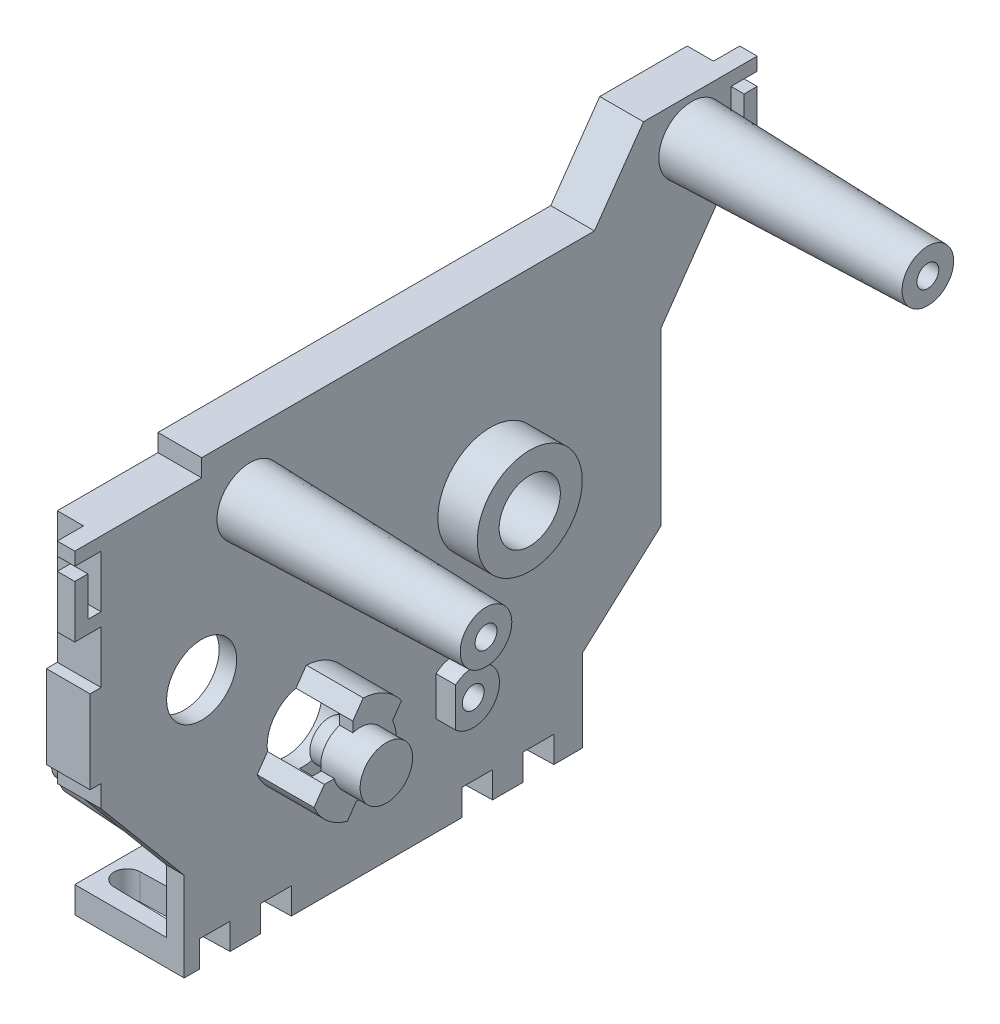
ISO-10303-21;
HEADER;
FILE_DESCRIPTION(('STEP AP214'),'2;1');
FILE_NAME('part.step','',(''),(''),'','','');
FILE_SCHEMA(('AUTOMOTIVE_DESIGN { 1 0 10303 214 1 1 1 1 }'));
ENDSEC;
DATA;
#1=APPLICATION_CONTEXT('core data for automotive mechanical design processes');
#2=APPLICATION_PROTOCOL_DEFINITION('international standard','automotive_design',2000,#1);
#3=PRODUCT_CONTEXT('',#1,'mechanical');
#4=PRODUCT('Part','Part','',(#3));
#5=PRODUCT_RELATED_PRODUCT_CATEGORY('part','',(#4));
#6=PRODUCT_DEFINITION_FORMATION('','',#4);
#7=PRODUCT_DEFINITION_CONTEXT('part definition',#1,'design');
#8=PRODUCT_DEFINITION('design','',#6,#7);
#9=PRODUCT_DEFINITION_SHAPE('','',#8);
#10=(LENGTH_UNIT() NAMED_UNIT(*) SI_UNIT(.MILLI.,.METRE.));
#11=(NAMED_UNIT(*) PLANE_ANGLE_UNIT() SI_UNIT($,.RADIAN.));
#12=(NAMED_UNIT(*) SI_UNIT($,.STERADIAN.) SOLID_ANGLE_UNIT());
#13=UNCERTAINTY_MEASURE_WITH_UNIT(LENGTH_MEASURE(1.E-05),#10,'distance_accuracy_value','');
#14=(GEOMETRIC_REPRESENTATION_CONTEXT(3) GLOBAL_UNCERTAINTY_ASSIGNED_CONTEXT((#13)) GLOBAL_UNIT_ASSIGNED_CONTEXT((#10,
#11,#12)) REPRESENTATION_CONTEXT('',''));
#15=CARTESIAN_POINT('',(0.,0.,0.));
#16=DIRECTION('',(0.,0.,1.));
#17=DIRECTION('',(1.,0.,0.));
#18=AXIS2_PLACEMENT_3D('',#15,#16,#17);
#19=CARTESIAN_POINT('',(-2.,17.5,-27.5));
#20=DIRECTION('',(0.,0.,-1.));
#21=DIRECTION('',(0.,1.,0.));
#22=AXIS2_PLACEMENT_3D('',#19,#20,#21);
#23=PLANE('',#22);
#24=DIRECTION('',(1.,0.,0.));
#25=VECTOR('',#24,1.);
#26=CARTESIAN_POINT('',(-5.35410196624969,18.5,-27.5));
#27=LINE('',#26,#25);
#28=CARTESIAN_POINT('',(-2.,18.5,-27.5));
#29=VERTEX_POINT('',#28);
#30=CARTESIAN_POINT('',(0.,18.5,-27.5));
#31=VERTEX_POINT('',#30);
#32=EDGE_CURVE('E657',#29,#31,#27,.T.);
#33=ORIENTED_EDGE('',*,*,#32,.T.);
#34=DIRECTION('',(0.,1.,0.));
#35=VECTOR('',#34,1.);
#36=CARTESIAN_POINT('',(0.,17.5,-27.5));
#37=LINE('',#36,#35);
#38=CARTESIAN_POINT('',(0.,17.5,-27.5));
#39=VERTEX_POINT('',#38);
#40=EDGE_CURVE('E1235',#39,#31,#37,.T.);
#41=ORIENTED_EDGE('',*,*,#40,.F.);
#42=DIRECTION('',(1.,0.,0.));
#43=VECTOR('',#42,1.);
#44=CARTESIAN_POINT('',(-2.,17.5,-27.5));
#45=LINE('',#44,#43);
#46=CARTESIAN_POINT('',(-2.,17.5,-27.5));
#47=VERTEX_POINT('',#46);
#48=EDGE_CURVE('E1345',#47,#39,#45,.T.);
#49=ORIENTED_EDGE('',*,*,#48,.F.);
#50=DIRECTION('',(0.,1.,0.));
#51=VECTOR('',#50,1.);
#52=CARTESIAN_POINT('',(-2.,17.5,-27.5));
#53=LINE('',#52,#51);
#54=EDGE_CURVE('E59',#47,#29,#53,.T.);
#55=ORIENTED_EDGE('',*,*,#54,.T.);
#56=EDGE_LOOP('',(#33,#41,#49,#55));
#57=FACE_BOUND('',#56,.T.);
#58=ADVANCED_FACE('F33',(#57),#23,.T.);
#59=CARTESIAN_POINT('',(0.,27.5,-27.5));
#60=DIRECTION('',(1.,0.,0.));
#61=DIRECTION('',(0.,0.,-1.));
#62=AXIS2_PLACEMENT_3D('',#59,#60,#61);
#63=PLANE('',#62);
#64=DIRECTION('',(0.,-1.,0.));
#65=VECTOR('',#64,1.);
#66=CARTESIAN_POINT('',(0.,-28.,-3.75));
#67=LINE('',#66,#65);
#68=CARTESIAN_POINT('',(0.,-28.,-3.75));
#69=VERTEX_POINT('',#68);
#70=CARTESIAN_POINT('',(0.,-31.,-3.75));
#71=VERTEX_POINT('',#70);
#72=EDGE_CURVE('E748',#69,#71,#67,.T.);
#73=ORIENTED_EDGE('',*,*,#72,.F.);
#74=DIRECTION('',(0.,0.,1.));
#75=VECTOR('',#74,1.);
#76=CARTESIAN_POINT('',(0.,-28.,-7.25));
#77=LINE('',#76,#75);
#78=CARTESIAN_POINT('',(0.,-28.,-7.25));
#79=VERTEX_POINT('',#78);
#80=EDGE_CURVE('E738',#79,#69,#77,.T.);
#81=ORIENTED_EDGE('',*,*,#80,.F.);
#82=DIRECTION('',(0.,-1.,0.));
#83=VECTOR('',#82,1.);
#84=CARTESIAN_POINT('',(0.,-28.,-7.25));
#85=LINE('',#84,#83);
#86=CARTESIAN_POINT('',(0.,-31.,-7.25));
#87=VERTEX_POINT('',#86);
#88=EDGE_CURVE('E750',#79,#87,#85,.T.);
#89=ORIENTED_EDGE('',*,*,#88,.T.);
#90=DIRECTION('',(0.,0.,-1.));
#91=VECTOR('',#90,1.);
#92=CARTESIAN_POINT('',(0.,-31.,35.));
#93=LINE('',#92,#91);
#94=CARTESIAN_POINT('',(0.,-31.,-10.5));
#95=VERTEX_POINT('',#94);
#96=EDGE_CURVE('E1281',#87,#95,#93,.T.);
#97=ORIENTED_EDGE('',*,*,#96,.T.);
#98=DIRECTION('',(0.,1.,0.));
#99=VECTOR('',#98,1.);
#100=CARTESIAN_POINT('',(0.,-31.,-10.5));
#101=LINE('',#100,#99);
#102=CARTESIAN_POINT('',(0.,-21.6036363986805,-10.5));
#103=VERTEX_POINT('',#102);
#104=EDGE_CURVE('E1285',#95,#103,#101,.T.);
#105=ORIENTED_EDGE('',*,*,#104,.T.);
#106=DIRECTION('',(0.,0.669130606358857,-0.743144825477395));
#107=VECTOR('',#106,1.);
#108=CARTESIAN_POINT('',(0.,-21.6036363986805,-10.5));
#109=LINE('',#108,#107);
#110=CARTESIAN_POINT('',(0.,-13.5,-19.5));
#111=VERTEX_POINT('',#110);
#112=EDGE_CURVE('E1289',#103,#111,#109,.T.);
#113=ORIENTED_EDGE('',*,*,#112,.T.);
#114=DIRECTION('',(0.,1.,0.));
#115=VECTOR('',#114,1.);
#116=CARTESIAN_POINT('',(0.,-13.5,-19.5));
#117=LINE('',#116,#115);
#118=CARTESIAN_POINT('',(0.,6.07481594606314,-19.5));
#119=VERTEX_POINT('',#118);
#120=EDGE_CURVE('E1292',#111,#119,#117,.T.);
#121=ORIENTED_EDGE('',*,*,#120,.T.);
#122=DIRECTION('',(0.,0.819152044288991,-0.573576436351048));
#123=VECTOR('',#122,1.);
#124=CARTESIAN_POINT('',(0.,6.07481594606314,-19.5));
#125=LINE('',#124,#123);
#126=EDGE_CURVE('E1295',#119,#39,#125,.T.);
#127=ORIENTED_EDGE('',*,*,#126,.T.);
#128=ORIENTED_EDGE('',*,*,#40,.T.);
#129=DIRECTION('',(0.,0.,-1.));
#130=VECTOR('',#129,1.);
#131=CARTESIAN_POINT('',(0.,18.5,-27.5));
#132=LINE('',#131,#130);
#133=CARTESIAN_POINT('',(0.,18.5,-30.5));
#134=VERTEX_POINT('',#133);
#135=EDGE_CURVE('E653',#31,#134,#132,.T.);
#136=ORIENTED_EDGE('',*,*,#135,.T.);
#137=DIRECTION('',(0.,1.,0.));
#138=VECTOR('',#137,1.);
#139=CARTESIAN_POINT('',(0.,18.5,-30.5));
#140=LINE('',#139,#138);
#141=CARTESIAN_POINT('',(0.,24.5,-30.5));
#142=VERTEX_POINT('',#141);
#143=EDGE_CURVE('E666',#134,#142,#140,.T.);
#144=ORIENTED_EDGE('',*,*,#143,.T.);
#145=DIRECTION('',(0.,0.,1.));
#146=VECTOR('',#145,1.);
#147=CARTESIAN_POINT('',(0.,24.5,-30.5));
#148=LINE('',#147,#146);
#149=CARTESIAN_POINT('',(0.,24.5,-29.));
#150=VERTEX_POINT('',#149);
#151=EDGE_CURVE('E669',#142,#150,#148,.T.);
#152=ORIENTED_EDGE('',*,*,#151,.T.);
#153=DIRECTION('',(0.,-1.,0.));
#154=VECTOR('',#153,1.);
#155=CARTESIAN_POINT('',(0.,24.5,-29.));
#156=LINE('',#155,#154);
#157=CARTESIAN_POINT('',(0.,20.,-29.));
#158=VERTEX_POINT('',#157);
#159=EDGE_CURVE('E672',#150,#158,#156,.T.);
#160=ORIENTED_EDGE('',*,*,#159,.T.);
#161=DIRECTION('',(0.,0.,1.));
#162=VECTOR('',#161,1.);
#163=CARTESIAN_POINT('',(0.,20.,-29.));
#164=LINE('',#163,#162);
#165=CARTESIAN_POINT('',(0.,20.,-27.5));
#166=VERTEX_POINT('',#165);
#167=EDGE_CURVE('E675',#158,#166,#164,.T.);
#168=ORIENTED_EDGE('',*,*,#167,.T.);
#169=CARTESIAN_POINT('',(0.,26.,-27.5));
#170=VERTEX_POINT('',#169);
#171=EDGE_CURVE('E37',#166,#170,#37,.T.);
#172=ORIENTED_EDGE('',*,*,#171,.T.);
#173=DIRECTION('',(0.,0.,-1.));
#174=VECTOR('',#173,1.);
#175=CARTESIAN_POINT('',(0.,26.,-30.5));
#176=LINE('',#175,#174);
#177=CARTESIAN_POINT('',(0.,26.,-30.5));
#178=VERTEX_POINT('',#177);
#179=EDGE_CURVE('E700',#170,#178,#176,.T.);
#180=ORIENTED_EDGE('',*,*,#179,.T.);
#181=DIRECTION('',(0.,1.,0.));
#182=VECTOR('',#181,1.);
#183=CARTESIAN_POINT('',(0.,27.5,-30.5));
#184=LINE('',#183,#182);
#185=CARTESIAN_POINT('',(0.,27.5,-30.5));
#186=VERTEX_POINT('',#185);
#187=EDGE_CURVE('E691',#178,#186,#184,.T.);
#188=ORIENTED_EDGE('',*,*,#187,.T.);
#189=DIRECTION('',(0.,0.,1.));
#190=VECTOR('',#189,1.);
#191=CARTESIAN_POINT('',(0.,27.5,-27.5));
#192=LINE('',#191,#190);
#193=CARTESIAN_POINT('',(0.,27.5,-17.5));
#194=VERTEX_POINT('',#193);
#195=EDGE_CURVE('E1238',#186,#194,#192,.T.);
#196=ORIENTED_EDGE('',*,*,#195,.T.);
#197=DIRECTION('',(0.,-0.819152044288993,0.573576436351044));
#198=VECTOR('',#197,1.);
#199=CARTESIAN_POINT('',(0.,27.5,-17.5));
#200=LINE('',#199,#198);
#201=CARTESIAN_POINT('',(0.,19.5,-11.8983396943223));
#202=VERTEX_POINT('',#201);
#203=EDGE_CURVE('E1249',#194,#202,#200,.T.);
#204=ORIENTED_EDGE('',*,*,#203,.T.);
#205=DIRECTION('',(0.,0.,1.));
#206=VECTOR('',#205,1.);
#207=CARTESIAN_POINT('',(0.,19.5,-11.8983396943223));
#208=LINE('',#207,#206);
#209=CARTESIAN_POINT('',(0.,19.5,32.9999999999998));
#210=VERTEX_POINT('',#209);
#211=EDGE_CURVE('E1252',#202,#210,#208,.T.);
#212=ORIENTED_EDGE('',*,*,#211,.T.);
#213=DIRECTION('',(0.,-1.,0.));
#214=VECTOR('',#213,1.);
#215=CARTESIAN_POINT('',(0.,19.5,32.9999999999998));
#216=LINE('',#215,#214);
#217=CARTESIAN_POINT('',(0.,17.5,32.9999999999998));
#218=VERTEX_POINT('',#217);
#219=EDGE_CURVE('E1255',#210,#218,#216,.T.);
#220=ORIENTED_EDGE('',*,*,#219,.T.);
#221=DIRECTION('',(0.,0.,1.));
#222=VECTOR('',#221,1.);
#223=CARTESIAN_POINT('',(0.,17.5,32.9999999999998));
#224=LINE('',#223,#222);
#225=CARTESIAN_POINT('',(0.,17.5,47.5000000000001));
#226=VERTEX_POINT('',#225);
#227=EDGE_CURVE('E1258',#218,#226,#224,.T.);
#228=ORIENTED_EDGE('',*,*,#227,.T.);
#229=DIRECTION('',(0.,-1.,0.));
#230=VECTOR('',#229,1.);
#231=CARTESIAN_POINT('',(0.,17.5,47.5000000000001));
#232=LINE('',#231,#230);
#233=CARTESIAN_POINT('',(0.,16.,47.5000000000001));
#234=VERTEX_POINT('',#233);
#235=EDGE_CURVE('E632',#226,#234,#232,.T.);
#236=ORIENTED_EDGE('',*,*,#235,.T.);
#237=DIRECTION('',(0.,0.,-1.));
#238=VECTOR('',#237,1.);
#239=CARTESIAN_POINT('',(0.,16.,47.5000000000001));
#240=LINE('',#239,#238);
#241=CARTESIAN_POINT('',(0.,16.,44.5));
#242=VERTEX_POINT('',#241);
#243=EDGE_CURVE('E643',#234,#242,#240,.T.);
#244=ORIENTED_EDGE('',*,*,#243,.T.);
#245=DIRECTION('',(0.,-1.,0.));
#246=VECTOR('',#245,1.);
#247=CARTESIAN_POINT('',(0.,17.5,44.5));
#248=LINE('',#247,#246);
#249=CARTESIAN_POINT('',(0.,10.,44.5));
#250=VERTEX_POINT('',#249);
#251=EDGE_CURVE('E1261',#242,#250,#248,.T.);
#252=ORIENTED_EDGE('',*,*,#251,.T.);
#253=DIRECTION('',(0.,0.,1.));
#254=VECTOR('',#253,1.);
#255=CARTESIAN_POINT('',(0.,10.,44.5));
#256=LINE('',#255,#254);
#257=CARTESIAN_POINT('',(0.,10.,46.));
#258=VERTEX_POINT('',#257);
#259=EDGE_CURVE('E597',#250,#258,#256,.T.);
#260=ORIENTED_EDGE('',*,*,#259,.T.);
#261=DIRECTION('',(0.,1.,0.));
#262=VECTOR('',#261,1.);
#263=CARTESIAN_POINT('',(0.,10.,46.));
#264=LINE('',#263,#262);
#265=CARTESIAN_POINT('',(0.,14.5,46.));
#266=VERTEX_POINT('',#265);
#267=EDGE_CURVE('E591',#258,#266,#264,.T.);
#268=ORIENTED_EDGE('',*,*,#267,.T.);
#269=DIRECTION('',(0.,0.,1.));
#270=VECTOR('',#269,1.);
#271=CARTESIAN_POINT('',(0.,14.5,46.));
#272=LINE('',#271,#270);
#273=CARTESIAN_POINT('',(0.,14.5,47.5));
#274=VERTEX_POINT('',#273);
#275=EDGE_CURVE('E600',#266,#274,#272,.T.);
#276=ORIENTED_EDGE('',*,*,#275,.T.);
#277=DIRECTION('',(0.,-1.,0.));
#278=VECTOR('',#277,1.);
#279=CARTESIAN_POINT('',(0.,14.5,47.5));
#280=LINE('',#279,#278);
#281=CARTESIAN_POINT('',(0.,8.5,47.5));
#282=VERTEX_POINT('',#281);
#283=EDGE_CURVE('E606',#274,#282,#280,.T.);
#284=ORIENTED_EDGE('',*,*,#283,.T.);
#285=DIRECTION('',(0.,0.,-1.));
#286=VECTOR('',#285,1.);
#287=CARTESIAN_POINT('',(0.,8.5,47.5));
#288=LINE('',#287,#286);
#289=CARTESIAN_POINT('',(0.,8.5,44.5));
#290=VERTEX_POINT('',#289);
#291=EDGE_CURVE('E617',#282,#290,#288,.T.);
#292=ORIENTED_EDGE('',*,*,#291,.T.);
#293=CARTESIAN_POINT('',(0.,2.5,44.5));
#294=VERTEX_POINT('',#293);
#295=EDGE_CURVE('E1260',#290,#294,#248,.T.);
#296=ORIENTED_EDGE('',*,*,#295,.T.);
#297=DIRECTION('',(0.,0.,1.));
#298=VECTOR('',#297,1.);
#299=CARTESIAN_POINT('',(0.,2.5,44.5));
#300=LINE('',#299,#298);
#301=CARTESIAN_POINT('',(0.,2.5,45.75));
#302=VERTEX_POINT('',#301);
#303=EDGE_CURVE('E1263',#294,#302,#300,.T.);
#304=ORIENTED_EDGE('',*,*,#303,.T.);
#305=DIRECTION('',(0.,-1.,0.));
#306=VECTOR('',#305,1.);
#307=CARTESIAN_POINT('',(0.,2.5,45.75));
#308=LINE('',#307,#306);
#309=CARTESIAN_POINT('',(0.,-7.,45.75));
#310=VERTEX_POINT('',#309);
#311=EDGE_CURVE('E1266',#302,#310,#308,.T.);
#312=ORIENTED_EDGE('',*,*,#311,.T.);
#313=DIRECTION('',(0.,0.,-1.));
#314=VECTOR('',#313,1.);
#315=CARTESIAN_POINT('',(0.,-7.,45.75));
#316=LINE('',#315,#314);
#317=CARTESIAN_POINT('',(0.,-7.,44.5));
#318=VERTEX_POINT('',#317);
#319=EDGE_CURVE('E1269',#310,#318,#316,.T.);
#320=ORIENTED_EDGE('',*,*,#319,.T.);
#321=DIRECTION('',(0.,-1.,0.));
#322=VECTOR('',#321,1.);
#323=CARTESIAN_POINT('',(0.,-7.,44.5));
#324=LINE('',#323,#322);
#325=CARTESIAN_POINT('',(0.,-9.5,44.5));
#326=VERTEX_POINT('',#325);
#327=EDGE_CURVE('E1272',#318,#326,#324,.T.);
#328=ORIENTED_EDGE('',*,*,#327,.T.);
#329=DIRECTION('',(0.,-0.766044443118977,-0.642787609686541));
#330=VECTOR('',#329,1.);
#331=CARTESIAN_POINT('',(0.,-9.5,44.5));
#332=LINE('',#331,#330);
#333=CARTESIAN_POINT('',(0.,-20.8216591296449,35.));
#334=VERTEX_POINT('',#333);
#335=EDGE_CURVE('E1275',#326,#334,#332,.T.);
#336=ORIENTED_EDGE('',*,*,#335,.T.);
#337=DIRECTION('',(0.,-1.,0.));
#338=VECTOR('',#337,1.);
#339=CARTESIAN_POINT('',(0.,-20.8216591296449,35.));
#340=LINE('',#339,#338);
#341=CARTESIAN_POINT('',(0.,-31.,35.));
#342=VERTEX_POINT('',#341);
#343=EDGE_CURVE('E1278',#334,#342,#340,.T.);
#344=ORIENTED_EDGE('',*,*,#343,.T.);
#345=CARTESIAN_POINT('',(0.,-31.,33.25));
#346=VERTEX_POINT('',#345);
#347=EDGE_CURVE('E1282',#342,#346,#93,.T.);
#348=ORIENTED_EDGE('',*,*,#347,.T.);
#349=DIRECTION('',(0.,-1.,0.));
#350=VECTOR('',#349,1.);
#351=CARTESIAN_POINT('',(0.,-28.,33.25));
#352=LINE('',#351,#350);
#353=CARTESIAN_POINT('',(0.,-28.,33.25));
#354=VERTEX_POINT('',#353);
#355=EDGE_CURVE('E836',#354,#346,#352,.T.);
#356=ORIENTED_EDGE('',*,*,#355,.F.);
#357=DIRECTION('',(0.,0.,1.));
#358=VECTOR('',#357,1.);
#359=CARTESIAN_POINT('',(0.,-28.,33.25));
#360=LINE('',#359,#358);
#361=CARTESIAN_POINT('',(0.,-28.,29.75));
#362=VERTEX_POINT('',#361);
#363=EDGE_CURVE('E822',#362,#354,#360,.T.);
#364=ORIENTED_EDGE('',*,*,#363,.F.);
#365=DIRECTION('',(0.,-1.,0.));
#366=VECTOR('',#365,1.);
#367=CARTESIAN_POINT('',(0.,-28.,29.75));
#368=LINE('',#367,#366);
#369=CARTESIAN_POINT('',(0.,-31.,29.75));
#370=VERTEX_POINT('',#369);
#371=EDGE_CURVE('E837',#362,#370,#368,.T.);
#372=ORIENTED_EDGE('',*,*,#371,.T.);
#373=CARTESIAN_POINT('',(0.,-31.,26.25));
#374=VERTEX_POINT('',#373);
#375=EDGE_CURVE('E1286',#370,#374,#93,.T.);
#376=ORIENTED_EDGE('',*,*,#375,.T.);
#377=DIRECTION('',(0.,-1.,0.));
#378=VECTOR('',#377,1.);
#379=CARTESIAN_POINT('',(0.,-28.,26.25));
#380=LINE('',#379,#378);
#381=CARTESIAN_POINT('',(0.,-28.,26.25));
#382=VERTEX_POINT('',#381);
#383=EDGE_CURVE('E805',#382,#374,#380,.T.);
#384=ORIENTED_EDGE('',*,*,#383,.F.);
#385=DIRECTION('',(0.,0.,1.));
#386=VECTOR('',#385,1.);
#387=CARTESIAN_POINT('',(0.,-28.,26.25));
#388=LINE('',#387,#386);
#389=CARTESIAN_POINT('',(0.,-28.,22.75));
#390=VERTEX_POINT('',#389);
#391=EDGE_CURVE('E791',#390,#382,#388,.T.);
#392=ORIENTED_EDGE('',*,*,#391,.F.);
#393=DIRECTION('',(0.,-1.,0.));
#394=VECTOR('',#393,1.);
#395=CARTESIAN_POINT('',(0.,-28.,22.75));
#396=LINE('',#395,#394);
#397=CARTESIAN_POINT('',(0.,-31.,22.75));
#398=VERTEX_POINT('',#397);
#399=EDGE_CURVE('E806',#390,#398,#396,.T.);
#400=ORIENTED_EDGE('',*,*,#399,.T.);
#401=CARTESIAN_POINT('',(0.,-31.,3.25000000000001));
#402=VERTEX_POINT('',#401);
#403=EDGE_CURVE('E1518',#398,#402,#93,.T.);
#404=ORIENTED_EDGE('',*,*,#403,.T.);
#405=DIRECTION('',(0.,-1.,0.));
#406=VECTOR('',#405,1.);
#407=CARTESIAN_POINT('',(0.,-28.,3.25000000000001));
#408=LINE('',#407,#406);
#409=CARTESIAN_POINT('',(0.,-28.,3.25000000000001));
#410=VERTEX_POINT('',#409);
#411=EDGE_CURVE('E777',#410,#402,#408,.T.);
#412=ORIENTED_EDGE('',*,*,#411,.F.);
#413=DIRECTION('',(0.,0.,1.));
#414=VECTOR('',#413,1.);
#415=CARTESIAN_POINT('',(0.,-28.,-0.249999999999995));
#416=LINE('',#415,#414);
#417=CARTESIAN_POINT('',(0.,-28.,-0.249999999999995));
#418=VERTEX_POINT('',#417);
#419=EDGE_CURVE('E767',#418,#410,#416,.T.);
#420=ORIENTED_EDGE('',*,*,#419,.F.);
#421=DIRECTION('',(0.,-1.,0.));
#422=VECTOR('',#421,1.);
#423=CARTESIAN_POINT('',(0.,-28.,-0.249999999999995));
#424=LINE('',#423,#422);
#425=CARTESIAN_POINT('',(0.,-31.,-0.249999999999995));
#426=VERTEX_POINT('',#425);
#427=EDGE_CURVE('E779',#418,#426,#424,.T.);
#428=ORIENTED_EDGE('',*,*,#427,.T.);
#429=EDGE_CURVE('E1520',#426,#71,#93,.T.);
#430=ORIENTED_EDGE('',*,*,#429,.T.);
#431=EDGE_LOOP('',(#73,#81,#89,#97,#105,#113,#121,#127,#128,#136,#144,#152,#160,#168,#172,#180,
#188,#196,#204,#212,#220,#228,#236,#244,#252,#260,#268,#276,#284,#292,#296,#304,#312,#320,#328,
#336,#344,#348,#356,#364,#372,#376,#384,#392,#400,#404,#412,#420,#428,#430));
#432=FACE_BOUND('',#431,.T.);
#433=CARTESIAN_POINT('',(0.,23.,-23.));
#434=DIRECTION('',(1.,0.,0.));
#435=DIRECTION('',(0.,0.,-1.));
#436=AXIS2_PLACEMENT_3D('',#433,#434,#435);
#437=CIRCLE('',#436,3.75);
#438=CARTESIAN_POINT('',(0.,23.,-26.75));
#439=VERTEX_POINT('',#438);
#440=EDGE_CURVE('E863',#439,#439,#437,.T.);
#441=ORIENTED_EDGE('',*,*,#440,.F.);
#442=EDGE_LOOP('',(#441));
#443=FACE_BOUND('',#442,.T.);
#444=CARTESIAN_POINT('',(0.,-12.75,21.3892111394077));
#445=DIRECTION('',(1.,0.,0.));
#446=DIRECTION('',(0.,0.,-1.));
#447=AXIS2_PLACEMENT_3D('',#444,#445,#446);
#448=CIRCLE('',#447,5.75);
#449=CARTESIAN_POINT('',(0.,-9.48113314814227,16.6587767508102));
#450=VERTEX_POINT('',#449);
#451=CARTESIAN_POINT('',(0.,-7.01103975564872,21.0330716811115));
#452=VERTEX_POINT('',#451);
#453=EDGE_CURVE('E990',#450,#452,#448,.T.);
#454=ORIENTED_EDGE('',*,*,#453,.F.);
#455=DIRECTION('',(0.,0.819152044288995,-0.573576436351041));
#456=VECTOR('',#455,1.);
#457=CARTESIAN_POINT('',(0.,-9.48113314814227,16.6587767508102));
#458=LINE('',#457,#456);
#459=CARTESIAN_POINT('',(0.,-10.9418837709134,17.6816053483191));
#460=VERTEX_POINT('',#459);
#461=EDGE_CURVE('E988',#460,#450,#458,.T.);
#462=ORIENTED_EDGE('',*,*,#461,.F.);
#463=CARTESIAN_POINT('',(0.,-12.75,21.3892111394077));
#464=DIRECTION('',(1.,0.,0.));
#465=DIRECTION('',(0.,0.,-1.));
#466=AXIS2_PLACEMENT_3D('',#463,#464,#465);
#467=CIRCLE('',#466,4.125);
#468=CARTESIAN_POINT('',(0.,-16.8524219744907,21.8202087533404));
#469=VERTEX_POINT('',#468);
#470=EDGE_CURVE('E1380',#469,#460,#467,.T.);
#471=ORIENTED_EDGE('',*,*,#470,.F.);
#472=DIRECTION('',(0.,0.819152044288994,-0.573576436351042));
#473=VECTOR('',#472,1.);
#474=CARTESIAN_POINT('',(0.,-16.8524219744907,21.8202087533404));
#475=LINE('',#474,#473);
#476=CARTESIAN_POINT('',(0.,-18.3131725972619,22.8430373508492));
#477=VERTEX_POINT('',#476);
#478=EDGE_CURVE('E1011',#477,#469,#475,.T.);
#479=ORIENTED_EDGE('',*,*,#478,.F.);
#480=CARTESIAN_POINT('',(0.,-12.75,21.3892111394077));
#481=DIRECTION('',(1.,0.,0.));
#482=DIRECTION('',(0.,0.,-1.));
#483=AXIS2_PLACEMENT_3D('',#480,#481,#482);
#484=CIRCLE('',#483,5.75);
#485=CARTESIAN_POINT('',(0.,-15.047501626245,26.6602628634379));
#486=VERTEX_POINT('',#485);
#487=EDGE_CURVE('E1008',#486,#477,#484,.T.);
#488=ORIENTED_EDGE('',*,*,#487,.F.);
#489=DIRECTION('',(0.,-0.819152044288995,0.573576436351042));
#490=VECTOR('',#489,1.);
#491=CARTESIAN_POINT('',(0.,-13.3484440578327,25.4705699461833));
#492=LINE('',#491,#490);
#493=CARTESIAN_POINT('',(0.,-13.3484440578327,25.4705699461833));
#494=VERTEX_POINT('',#493);
#495=EDGE_CURVE('E1014',#494,#486,#492,.T.);
#496=ORIENTED_EDGE('',*,*,#495,.F.);
#497=CARTESIAN_POINT('',(0.,-8.71009732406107,22.2227645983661));
#498=VERTEX_POINT('',#497);
#499=EDGE_CURVE('E1368',#498,#494,#467,.T.);
#500=ORIENTED_EDGE('',*,*,#499,.F.);
#501=DIRECTION('',(0.,-0.819152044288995,0.573576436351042));
#502=VECTOR('',#501,1.);
#503=CARTESIAN_POINT('',(0.,-7.01103975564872,21.0330716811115));
#504=LINE('',#503,#502);
#505=EDGE_CURVE('E992',#452,#498,#504,.T.);
#506=ORIENTED_EDGE('',*,*,#505,.F.);
#507=EDGE_LOOP('',(#454,#462,#471,#479,#488,#496,#500,#506));
#508=FACE_BOUND('',#507,.T.);
#509=DIRECTION('',(0.,-1.,0.));
#510=VECTOR('',#509,1.);
#511=CARTESIAN_POINT('',(0.,-15.2639320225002,6.21307488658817));
#512=LINE('',#511,#510);
#513=CARTESIAN_POINT('',(0.,-15.2639320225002,6.21307488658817));
#514=VERTEX_POINT('',#513);
#515=CARTESIAN_POINT('',(0.,-19.7360679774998,6.21307488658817));
#516=VERTEX_POINT('',#515);
#517=EDGE_CURVE('E1034',#514,#516,#512,.T.);
#518=ORIENTED_EDGE('',*,*,#517,.F.);
#519=CARTESIAN_POINT('',(0.,-17.5,4.21307488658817));
#520=DIRECTION('',(1.,0.,0.));
#521=DIRECTION('',(0.,0.,-1.));
#522=AXIS2_PLACEMENT_3D('',#519,#520,#521);
#523=CIRCLE('',#522,3.);
#524=EDGE_CURVE('E1032',#516,#514,#523,.T.);
#525=ORIENTED_EDGE('',*,*,#524,.F.);
#526=EDGE_LOOP('',(#518,#525));
#527=FACE_BOUND('',#526,.T.);
#528=CARTESIAN_POINT('',(0.,-19.5,14.0110338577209));
#529=DIRECTION('',(1.,0.,0.));
#530=DIRECTION('',(0.,0.,-1.));
#531=AXIS2_PLACEMENT_3D('',#528,#529,#530);
#532=CIRCLE('',#531,1.25);
#533=CARTESIAN_POINT('',(0.,-19.5,12.7610338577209));
#534=VERTEX_POINT('',#533);
#535=EDGE_CURVE('E1362',#534,#534,#532,.T.);
#536=ORIENTED_EDGE('',*,*,#535,.F.);
#537=EDGE_LOOP('',(#536));
#538=FACE_BOUND('',#537,.T.);
#539=CARTESIAN_POINT('',(0.,-2.48162222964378,33.));
#540=DIRECTION('',(1.,0.,0.));
#541=DIRECTION('',(0.,0.,-1.));
#542=AXIS2_PLACEMENT_3D('',#539,#540,#541);
#543=CIRCLE('',#542,4.);
#544=CARTESIAN_POINT('',(0.,-2.48162222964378,29.));
#545=VERTEX_POINT('',#544);
#546=EDGE_CURVE('E1385',#545,#545,#543,.T.);
#547=ORIENTED_EDGE('',*,*,#546,.F.);
#548=EDGE_LOOP('',(#547));
#549=FACE_BOUND('',#548,.T.);
#550=CARTESIAN_POINT('',(0.,0.,0.));
#551=DIRECTION('',(1.,0.,0.));
#552=DIRECTION('',(0.,0.,-1.));
#553=AXIS2_PLACEMENT_3D('',#550,#551,#552);
#554=CIRCLE('',#553,6.);
#555=CARTESIAN_POINT('',(0.,0.,-6.));
#556=VERTEX_POINT('',#555);
#557=EDGE_CURVE('E926',#556,#556,#554,.T.);
#558=ORIENTED_EDGE('',*,*,#557,.F.);
#559=EDGE_LOOP('',(#558));
#560=FACE_BOUND('',#559,.T.);
#561=CARTESIAN_POINT('',(0.,12.5,27.5));
#562=DIRECTION('',(1.,0.,0.));
#563=DIRECTION('',(0.,0.,-1.));
#564=AXIS2_PLACEMENT_3D('',#561,#562,#563);
#565=CIRCLE('',#564,3.75);
#566=CARTESIAN_POINT('',(0.,12.5,23.75));
#567=VERTEX_POINT('',#566);
#568=EDGE_CURVE('E857',#567,#567,#565,.T.);
#569=ORIENTED_EDGE('',*,*,#568,.F.);
#570=EDGE_LOOP('',(#569));
#571=FACE_BOUND('',#570,.T.);
#572=ADVANCED_FACE('F609',(#432,#443,#508,#527,#538,#549,#560,#571),#63,.T.);
#573=CARTESIAN_POINT('',(-2.,-13.,37.6469294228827));
#574=DIRECTION('',(1.,0.,0.));
#575=DIRECTION('',(0.,0.,1.));
#576=AXIS2_PLACEMENT_3D('',#573,#574,#575);
#577=CONICAL_SURFACE('',#576,3.,0.05235987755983);
#578=CARTESIAN_POINT('',(-2.,-13.,37.6469294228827));
#579=DIRECTION('',(-1.,0.,0.));
#580=DIRECTION('',(0.,0.,1.));
#581=AXIS2_PLACEMENT_3D('',#578,#579,#580);
#582=CIRCLE('',#581,3.);
#583=CARTESIAN_POINT('',(-2.,-14.9283628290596,39.9450627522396));
#584=VERTEX_POINT('',#583);
#585=EDGE_CURVE('E895',#584,#584,#582,.T.);
#586=ORIENTED_EDGE('',*,*,#585,.T.);
#587=EDGE_LOOP('',(#586));
#588=FACE_BOUND('',#587,.T.);
#589=CARTESIAN_POINT('',(-9.,-13.,37.6469294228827));
#590=DIRECTION('',(-1.,0.,0.));
#591=DIRECTION('',(0.,0.,1.));
#592=AXIS2_PLACEMENT_3D('',#589,#590,#591);
#593=CIRCLE('',#592,2.63314554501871);
#594=CARTESIAN_POINT('',(-9.,-13.,40.2800749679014));
#595=VERTEX_POINT('',#594);
#596=EDGE_CURVE('E887',#595,#595,#593,.T.);
#597=ORIENTED_EDGE('',*,*,#596,.F.);
#598=EDGE_LOOP('',(#597));
#599=FACE_BOUND('',#598,.T.);
#600=ADVANCED_FACE('F1606',(#588,#599),#577,.T.);
#601=CARTESIAN_POINT('',(-2.,-12.,3.66163848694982));
#602=DIRECTION('',(1.,0.,0.));
#603=DIRECTION('',(0.,0.,1.));
#604=AXIS2_PLACEMENT_3D('',#601,#602,#603);
#605=CONICAL_SURFACE('',#604,2.625,0.05235987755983);
#606=CARTESIAN_POINT('',(-2.,-12.,3.66163848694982));
#607=DIRECTION('',(-1.,0.,0.));
#608=DIRECTION('',(0.,0.,1.));
#609=AXIS2_PLACEMENT_3D('',#606,#607,#608);
#610=CIRCLE('',#609,2.625);
#611=CARTESIAN_POINT('',(-2.,-14.5082727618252,4.43571390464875));
#612=VERTEX_POINT('',#611);
#613=CARTESIAN_POINT('',(-2.,-14.6120214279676,3.40092972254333));
#614=VERTEX_POINT('',#613);
#615=EDGE_CURVE('E898',#612,#614,#610,.T.);
#616=ORIENTED_EDGE('',*,*,#615,.T.);
#617=CARTESIAN_POINT('',(-1.9998,-14.6120292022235,3.40090207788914));
#618=CARTESIAN_POINT('',(-2.10235239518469,-14.6080386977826,3.41511852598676));
#619=CARTESIAN_POINT('',(-2.20484565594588,-14.6040080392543,3.42982905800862));
#620=CARTESIAN_POINT('',(-2.40971826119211,-14.5958132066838,3.46076659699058));
#621=CARTESIAN_POINT('',(-2.51209733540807,-14.5916488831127,3.47699534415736));
#622=CARTESIAN_POINT('',(-2.71718458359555,-14.5831143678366,3.51158120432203));
#623=CARTESIAN_POINT('',(-2.81989044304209,-14.5787429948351,3.52995170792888));
#624=CARTESIAN_POINT('',(-3.02468582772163,-14.5697316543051,3.56967967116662));
#625=CARTESIAN_POINT('',(-3.1267756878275,-14.5650918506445,3.59103531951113));
#626=CARTESIAN_POINT('',(-3.29749769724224,-14.5568727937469,3.63146490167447));
#627=CARTESIAN_POINT('',(-3.36648141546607,-14.5534233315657,3.64911770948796));
#628=CARTESIAN_POINT('',(-3.50357206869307,-14.5461433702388,3.68850689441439));
#629=CARTESIAN_POINT('',(-3.57167705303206,-14.5423121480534,3.71025109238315));
#630=CARTESIAN_POINT('',(-3.66536409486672,-14.5362807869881,3.74779900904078));
#631=CARTESIAN_POINT('',(-3.69254821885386,-14.534435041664,3.7596540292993));
#632=CARTESIAN_POINT('',(-3.74549880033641,-14.530497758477,3.7861678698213));
#633=CARTESIAN_POINT('',(-3.77127268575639,-14.5284077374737,3.80080970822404));
#634=CARTESIAN_POINT('',(-3.80223472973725,-14.5253483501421,3.82387635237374));
#635=CARTESIAN_POINT('',(-3.80937578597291,-14.5245984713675,3.8296383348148));
#636=CARTESIAN_POINT('',(-3.82293442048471,-14.5230361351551,3.84196109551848));
#637=CARTESIAN_POINT('',(-3.82935327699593,-14.5222237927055,3.84852041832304));
#638=CARTESIAN_POINT('',(-3.83864232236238,-14.5208634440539,3.85985597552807));
#639=CARTESIAN_POINT('',(-3.84190943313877,-14.5203385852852,3.86430577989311));
#640=CARTESIAN_POINT('',(-3.84778791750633,-14.5192629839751,3.87362124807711));
#641=CARTESIAN_POINT('',(-3.85040024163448,-14.5187122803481,3.8784862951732));
#642=CARTESIAN_POINT('',(-3.85425607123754,-14.5177107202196,3.88754944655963));
#643=CARTESIAN_POINT('',(-3.85567175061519,-14.517263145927,3.89167343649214));
#644=CARTESIAN_POINT('',(-3.8577921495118,-14.5163672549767,3.90009962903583));
#645=CARTESIAN_POINT('',(-3.85849789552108,-14.5159189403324,3.9044015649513));
#646=CARTESIAN_POINT('',(-3.85911478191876,-14.5150334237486,3.91308547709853));
#647=CARTESIAN_POINT('',(-3.85902222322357,-14.5145962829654,3.91746773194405));
#648=CARTESIAN_POINT('',(-3.85804622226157,-14.51374963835,3.92614657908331));
#649=CARTESIAN_POINT('',(-3.85716203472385,-14.5133401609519,3.9304430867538));
#650=CARTESIAN_POINT('',(-3.8544407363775,-14.5124729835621,3.93974601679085));
#651=CARTESIAN_POINT('',(-3.85243840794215,-14.512024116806,3.94470403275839));
#652=CARTESIAN_POINT('',(-3.84766881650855,-14.5111829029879,3.95424020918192));
#653=CARTESIAN_POINT('',(-3.84489988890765,-14.5107906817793,3.95881751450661));
#654=CARTESIAN_POINT('',(-3.83658957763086,-14.5097868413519,3.97082676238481));
#655=CARTESIAN_POINT('',(-3.8305068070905,-14.5092259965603,3.97788252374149));
#656=CARTESIAN_POINT('',(-3.81742996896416,-14.5082168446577,3.99109131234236));
#657=CARTESIAN_POINT('',(-3.81043306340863,-14.5077689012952,3.99724139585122));
#658=CARTESIAN_POINT('',(-3.77997342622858,-14.5060486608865,4.02172442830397));
#659=CARTESIAN_POINT('',(-3.75417041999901,-14.5051323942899,4.03707300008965));
#660=CARTESIAN_POINT('',(-3.70100896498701,-14.5036378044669,4.06478490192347));
#661=CARTESIAN_POINT('',(-3.67364034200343,-14.5030620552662,4.07712508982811));
#662=CARTESIAN_POINT('',(-3.58167320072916,-14.5014772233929,4.11512199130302));
#663=CARTESIAN_POINT('',(-3.51547176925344,-14.5008947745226,4.13693561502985));
#664=CARTESIAN_POINT('',(-3.38187542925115,-14.5001619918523,4.17660919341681));
#665=CARTESIAN_POINT('',(-3.31447771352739,-14.5000128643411,4.19445798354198));
#666=CARTESIAN_POINT('',(-3.17906724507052,-14.4999885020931,4.22764190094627));
#667=CARTESIAN_POINT('',(-3.11105470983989,-14.5001131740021,4.24297788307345));
#668=CARTESIAN_POINT('',(-2.97477545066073,-14.5005439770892,4.27197162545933));
#669=CARTESIAN_POINT('',(-2.90650913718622,-14.5008498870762,4.28563140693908));
#670=CARTESIAN_POINT('',(-2.69858300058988,-14.5019814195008,4.32535030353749));
#671=CARTESIAN_POINT('',(-2.55856192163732,-14.503016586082,4.34951870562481));
#672=CARTESIAN_POINT('',(-2.34864326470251,-14.5048214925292,4.38344900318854));
#673=CARTESIAN_POINT('',(-2.27891763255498,-14.5054626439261,4.39434010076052));
#674=CARTESIAN_POINT('',(-2.13940745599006,-14.5068173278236,4.41548774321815));
#675=CARTESIAN_POINT('',(-2.06962296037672,-14.5075308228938,4.42574461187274));
#676=CARTESIAN_POINT('',(-1.99979999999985,-14.508274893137,4.43574254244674));
#677=B_SPLINE_CURVE_WITH_KNOTS('',3,(#617,#618,#619,#620,#621,#622,#623,#624,#625,#626,#627,
#628,#629,#630,#631,#632,#633,#634,#635,#636,#637,#638,#639,#640,#641,#642,#643,#644,#645,#646,
#647,#648,#649,#650,#651,#652,#653,#654,#655,#656,#657,#658,#659,#660,#661,#662,#663,#664,#665,
#666,#667,#668,#669,#670,#671,#672,#673,#674,#675,#676),.UNSPECIFIED.,.F.,.F.,(4,2,2,2,2,2,2,2,
2,2,2,2,2,2,2,2,2,2,2,2,2,2,2,2,2,2,2,2,2,4),(0.,0.310846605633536,0.622053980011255,
0.93532350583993,1.24840376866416,1.46228149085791,1.67657228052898,1.76569578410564,
1.8542926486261,1.88187439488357,1.90940652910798,1.92600432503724,1.94257788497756,
1.95567553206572,1.96875421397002,1.98189353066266,1.9950452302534,2.01105243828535,
2.02709468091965,2.05493444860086,2.08286279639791,2.17227155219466,2.26234779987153,
2.47094656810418,2.68012548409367,2.88923308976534,3.09808601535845,3.52429719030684,
3.73601891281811,3.94763164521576),.UNSPECIFIED.);
#678=EDGE_CURVE('E11',#614,#612,#677,.T.);
#679=ORIENTED_EDGE('',*,*,#678,.T.);
#680=EDGE_LOOP('',(#616,#679));
#681=FACE_BOUND('',#680,.T.);
#682=CARTESIAN_POINT('',(-9.,-12.,3.66163848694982));
#683=DIRECTION('',(-1.,0.,0.));
#684=DIRECTION('',(0.,0.,1.));
#685=AXIS2_PLACEMENT_3D('',#682,#683,#684);
#686=CIRCLE('',#685,2.25814554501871);
#687=CARTESIAN_POINT('',(-9.,-12.,5.91978403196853));
#688=VERTEX_POINT('',#687);
#689=EDGE_CURVE('E894',#688,#688,#686,.T.);
#690=ORIENTED_EDGE('',*,*,#689,.F.);
#691=EDGE_LOOP('',(#690));
#692=FACE_BOUND('',#691,.T.);
#693=ADVANCED_FACE('F1650',(#681,#692),#605,.T.);
#694=CARTESIAN_POINT('',(-2.,27.5,-27.5));
#695=DIRECTION('',(1.,0.,0.));
#696=DIRECTION('',(0.,0.,-1.));
#697=AXIS2_PLACEMENT_3D('',#694,#695,#696);
#698=PLANE('',#697);
#699=CARTESIAN_POINT('',(-2.,12.5,27.5));
#700=DIRECTION('',(1.,0.,0.));
#701=DIRECTION('',(0.,0.,-1.));
#702=AXIS2_PLACEMENT_3D('',#699,#700,#701);
#703=CIRCLE('',#702,1.25);
#704=CARTESIAN_POINT('',(-2.,12.5,26.25));
#705=VERTEX_POINT('',#704);
#706=EDGE_CURVE('E848',#705,#705,#703,.T.);
#707=ORIENTED_EDGE('',*,*,#706,.T.);
#708=EDGE_LOOP('',(#707));
#709=FACE_BOUND('',#708,.T.);
#710=CARTESIAN_POINT('',(-2.,23.,-23.));
#711=DIRECTION('',(1.,0.,0.));
#712=DIRECTION('',(0.,0.,-1.));
#713=AXIS2_PLACEMENT_3D('',#710,#711,#712);
#714=CIRCLE('',#713,1.25);
#715=CARTESIAN_POINT('',(-2.,23.,-24.25));
#716=VERTEX_POINT('',#715);
#717=EDGE_CURVE('E854',#716,#716,#714,.T.);
#718=ORIENTED_EDGE('',*,*,#717,.T.);
#719=EDGE_LOOP('',(#718));
#720=FACE_BOUND('',#719,.T.);
#721=ORIENTED_EDGE('',*,*,#615,.F.);
#722=CARTESIAN_POINT('',(-2.,-17.5,4.21307488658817));
#723=DIRECTION('',(1.,0.,0.));
#724=DIRECTION('',(0.,0.,-1.));
#725=AXIS2_PLACEMENT_3D('',#722,#723,#724);
#726=CIRCLE('',#725,3.);
#727=EDGE_CURVE('E2823',#614,#612,#726,.F.);
#728=ORIENTED_EDGE('',*,*,#727,.F.);
#729=EDGE_LOOP('',(#721,#728));
#730=FACE_BOUND('',#729,.T.);
#731=CARTESIAN_POINT('',(-2.,-12.75,21.3892111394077));
#732=DIRECTION('',(1.,0.,0.));
#733=DIRECTION('',(0.,0.,-1.));
#734=AXIS2_PLACEMENT_3D('',#731,#732,#733);
#735=CIRCLE('',#734,4.125);
#736=CARTESIAN_POINT('',(-2.,-12.75,17.2642111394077));
#737=VERTEX_POINT('',#736);
#738=EDGE_CURVE('E1383',#737,#737,#735,.T.);
#739=ORIENTED_EDGE('',*,*,#738,.T.);
#740=EDGE_LOOP('',(#739));
#741=FACE_BOUND('',#740,.T.);
#742=CARTESIAN_POINT('',(-2.,-2.48162222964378,33.));
#743=DIRECTION('',(1.,0.,0.));
#744=DIRECTION('',(0.,0.,-1.));
#745=AXIS2_PLACEMENT_3D('',#742,#743,#744);
#746=CIRCLE('',#745,4.);
#747=CARTESIAN_POINT('',(-2.,-2.48162222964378,29.));
#748=VERTEX_POINT('',#747);
#749=EDGE_CURVE('E1244',#748,#748,#746,.T.);
#750=ORIENTED_EDGE('',*,*,#749,.T.);
#751=EDGE_LOOP('',(#750));
#752=FACE_BOUND('',#751,.T.);
#753=CARTESIAN_POINT('',(-2.,0.,0.));
#754=DIRECTION('',(1.,0.,0.));
#755=DIRECTION('',(0.,0.,-1.));
#756=AXIS2_PLACEMENT_3D('',#753,#754,#755);
#757=CIRCLE('',#756,5.5);
#758=CARTESIAN_POINT('',(-2.,0.,-5.5));
#759=VERTEX_POINT('',#758);
#760=EDGE_CURVE('E2825',#759,#759,#757,.F.);
#761=ORIENTED_EDGE('',*,*,#760,.F.);
#762=EDGE_LOOP('',(#761));
#763=FACE_BOUND('',#762,.T.);
#764=CARTESIAN_POINT('',(-2.,-19.5,14.0110338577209));
#765=DIRECTION('',(1.,0.,0.));
#766=DIRECTION('',(0.,0.,-1.));
#767=AXIS2_PLACEMENT_3D('',#764,#765,#766);
#768=CIRCLE('',#767,2.5);
#769=CARTESIAN_POINT('',(-2.,-19.5,11.5110338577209));
#770=VERTEX_POINT('',#769);
#771=EDGE_CURVE('E43',#770,#770,#768,.F.);
#772=ORIENTED_EDGE('',*,*,#771,.F.);
#773=EDGE_LOOP('',(#772));
#774=FACE_BOUND('',#773,.T.);
#775=DIRECTION('',(0.,-0.766044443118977,-0.642787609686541));
#776=VECTOR('',#775,1.);
#777=CARTESIAN_POINT('',(-2.,-9.5,44.5));
#778=LINE('',#777,#776);
#779=CARTESIAN_POINT('',(-2.,-20.8216591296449,35.));
#780=VERTEX_POINT('',#779);
#781=EDGE_CURVE('E1300',#584,#780,#778,.T.);
#782=ORIENTED_EDGE('',*,*,#781,.F.);
#783=ORIENTED_EDGE('',*,*,#585,.F.);
#784=CARTESIAN_POINT('',(-2.,-9.5,44.5));
#785=VERTEX_POINT('',#784);
#786=EDGE_CURVE('E1301',#785,#584,#778,.T.);
#787=ORIENTED_EDGE('',*,*,#786,.F.);
#788=DIRECTION('',(0.,0.,1.));
#789=VECTOR('',#788,1.);
#790=CARTESIAN_POINT('',(-2.,-9.5,44.5));
#791=LINE('',#790,#789);
#792=CARTESIAN_POINT('',(-2.,-9.5,41.75));
#793=VERTEX_POINT('',#792);
#794=EDGE_CURVE('E1099',#793,#785,#791,.T.);
#795=ORIENTED_EDGE('',*,*,#794,.F.);
#796=DIRECTION('',(0.,-1.,0.));
#797=VECTOR('',#796,1.);
#798=CARTESIAN_POINT('',(-2.,14.75,41.75));
#799=LINE('',#798,#797);
#800=CARTESIAN_POINT('',(-2.,14.75,41.75));
#801=VERTEX_POINT('',#800);
#802=EDGE_CURVE('E1095',#801,#793,#799,.T.);
#803=ORIENTED_EDGE('',*,*,#802,.F.);
#804=DIRECTION('',(0.,0.,1.));
#805=VECTOR('',#804,1.);
#806=CARTESIAN_POINT('',(-2.,14.75,30.2499999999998));
#807=LINE('',#806,#805);
#808=CARTESIAN_POINT('',(-2.,14.75,30.2499999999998));
#809=VERTEX_POINT('',#808);
#810=EDGE_CURVE('E1091',#809,#801,#807,.T.);
#811=ORIENTED_EDGE('',*,*,#810,.F.);
#812=DIRECTION('',(0.,-1.,0.));
#813=VECTOR('',#812,1.);
#814=CARTESIAN_POINT('',(-2.,16.75,30.2499999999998));
#815=LINE('',#814,#813);
#816=CARTESIAN_POINT('',(-2.,16.75,30.2499999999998));
#817=VERTEX_POINT('',#816);
#818=EDGE_CURVE('E1087',#817,#809,#815,.T.);
#819=ORIENTED_EDGE('',*,*,#818,.F.);
#820=DIRECTION('',(0.,0.,1.));
#821=VECTOR('',#820,1.);
#822=CARTESIAN_POINT('',(-2.,16.75,-13.3298990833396));
#823=LINE('',#822,#821);
#824=CARTESIAN_POINT('',(-2.,16.75,-13.3298990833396));
#825=VERTEX_POINT('',#824);
#826=EDGE_CURVE('E1083',#825,#817,#823,.T.);
#827=ORIENTED_EDGE('',*,*,#826,.F.);
#828=DIRECTION('',(0.,-0.819152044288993,0.573576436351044));
#829=VECTOR('',#828,1.);
#830=CARTESIAN_POINT('',(-2.,24.75,-18.9315593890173));
#831=LINE('',#830,#829);
#832=CARTESIAN_POINT('',(-2.,24.75,-18.9315593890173));
#833=VERTEX_POINT('',#832);
#834=EDGE_CURVE('E1079',#833,#825,#831,.T.);
#835=ORIENTED_EDGE('',*,*,#834,.F.);
#836=DIRECTION('',(0.,0.,1.));
#837=VECTOR('',#836,1.);
#838=CARTESIAN_POINT('',(-2.,24.75,-27.5));
#839=LINE('',#838,#837);
#840=CARTESIAN_POINT('',(-2.,24.75,-27.5));
#841=VERTEX_POINT('',#840);
#842=EDGE_CURVE('E1075',#841,#833,#839,.T.);
#843=ORIENTED_EDGE('',*,*,#842,.F.);
#844=CARTESIAN_POINT('',(-2.,20.,-27.5));
#845=VERTEX_POINT('',#844);
#846=EDGE_CURVE('E1298',#845,#841,#53,.T.);
#847=ORIENTED_EDGE('',*,*,#846,.F.);
#848=DIRECTION('',(0.,0.,-1.));
#849=VECTOR('',#848,1.);
#850=CARTESIAN_POINT('',(-2.,20.,-29.));
#851=LINE('',#850,#849);
#852=CARTESIAN_POINT('',(-2.,20.,-29.));
#853=VERTEX_POINT('',#852);
#854=EDGE_CURVE('E659',#845,#853,#851,.T.);
#855=ORIENTED_EDGE('',*,*,#854,.T.);
#856=DIRECTION('',(0.,1.,0.));
#857=VECTOR('',#856,1.);
#858=CARTESIAN_POINT('',(-2.,24.5,-29.));
#859=LINE('',#858,#857);
#860=CARTESIAN_POINT('',(-2.,24.5,-29.));
#861=VERTEX_POINT('',#860);
#862=EDGE_CURVE('E656',#853,#861,#859,.T.);
#863=ORIENTED_EDGE('',*,*,#862,.T.);
#864=DIRECTION('',(0.,0.,-1.));
#865=VECTOR('',#864,1.);
#866=CARTESIAN_POINT('',(-2.,24.5,-30.5));
#867=LINE('',#866,#865);
#868=CARTESIAN_POINT('',(-2.,24.5,-30.5));
#869=VERTEX_POINT('',#868);
#870=EDGE_CURVE('E654',#861,#869,#867,.T.);
#871=ORIENTED_EDGE('',*,*,#870,.T.);
#872=DIRECTION('',(0.,-1.,0.));
#873=VECTOR('',#872,1.);
#874=CARTESIAN_POINT('',(-2.,18.5,-30.5));
#875=LINE('',#874,#873);
#876=CARTESIAN_POINT('',(-2.,18.5,-30.5));
#877=VERTEX_POINT('',#876);
#878=EDGE_CURVE('E663',#869,#877,#875,.T.);
#879=ORIENTED_EDGE('',*,*,#878,.T.);
#880=DIRECTION('',(0.,0.,1.));
#881=VECTOR('',#880,1.);
#882=CARTESIAN_POINT('',(-2.,18.5,-27.5));
#883=LINE('',#882,#881);
#884=EDGE_CURVE('E661',#877,#29,#883,.T.);
#885=ORIENTED_EDGE('',*,*,#884,.T.);
#886=ORIENTED_EDGE('',*,*,#54,.F.);
#887=DIRECTION('',(0.,0.819152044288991,-0.573576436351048));
#888=VECTOR('',#887,1.);
#889=CARTESIAN_POINT('',(-2.,6.07481594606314,-19.5));
#890=LINE('',#889,#888);
#891=CARTESIAN_POINT('',(-2.,6.07481594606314,-19.5));
#892=VERTEX_POINT('',#891);
#893=EDGE_CURVE('E1306',#892,#47,#890,.T.);
#894=ORIENTED_EDGE('',*,*,#893,.F.);
#895=DIRECTION('',(0.,0.,-1.));
#896=VECTOR('',#895,1.);
#897=CARTESIAN_POINT('',(-2.,6.07481594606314,-19.5));
#898=LINE('',#897,#896);
#899=CARTESIAN_POINT('',(-2.,6.07481594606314,-16.75));
#900=VERTEX_POINT('',#899);
#901=EDGE_CURVE('E1166',#900,#892,#898,.T.);
#902=ORIENTED_EDGE('',*,*,#901,.F.);
#903=DIRECTION('',(0.,1.,0.));
#904=VECTOR('',#903,1.);
#905=CARTESIAN_POINT('',(-2.,-12.2756211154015,-16.75));
#906=LINE('',#905,#904);
#907=CARTESIAN_POINT('',(-2.,-12.2756211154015,-16.75));
#908=VERTEX_POINT('',#907);
#909=EDGE_CURVE('E1164',#908,#900,#906,.T.);
#910=ORIENTED_EDGE('',*,*,#909,.F.);
#911=DIRECTION('',(0.,0.669130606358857,-0.743144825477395));
#912=VECTOR('',#911,1.);
#913=CARTESIAN_POINT('',(-2.,-19.7039544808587,-8.49999999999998));
#914=LINE('',#913,#912);
#915=CARTESIAN_POINT('',(-2.,-19.7039544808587,-8.49999999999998));
#916=VERTEX_POINT('',#915);
#917=EDGE_CURVE('E1162',#916,#908,#914,.T.);
#918=ORIENTED_EDGE('',*,*,#917,.F.);
#919=DIRECTION('',(0.,1.,0.));
#920=VECTOR('',#919,1.);
#921=CARTESIAN_POINT('',(-2.,-28.,-8.49999999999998));
#922=LINE('',#921,#920);
#923=CARTESIAN_POINT('',(-2.,-28.,-8.49999999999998));
#924=VERTEX_POINT('',#923);
#925=EDGE_CURVE('E1110',#924,#916,#922,.T.);
#926=ORIENTED_EDGE('',*,*,#925,.F.);
#927=DIRECTION('',(0.,0.,-1.));
#928=VECTOR('',#927,1.);
#929=CARTESIAN_POINT('',(-2.,-28.,35.));
#930=LINE('',#929,#928);
#931=CARTESIAN_POINT('',(-2.,-28.,-7.20009338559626));
#932=VERTEX_POINT('',#931);
#933=EDGE_CURVE('E1195',#932,#924,#930,.T.);
#934=ORIENTED_EDGE('',*,*,#933,.F.);
#935=CARTESIAN_POINT('',(-2.,-28.,-3.79990661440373));
#936=VERTEX_POINT('',#935);
#937=EDGE_CURVE('E1232',#936,#932,#930,.T.);
#938=ORIENTED_EDGE('',*,*,#937,.F.);
#939=CARTESIAN_POINT('',(-2.,-28.,-0.200093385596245));
#940=VERTEX_POINT('',#939);
#941=EDGE_CURVE('E1230',#940,#936,#930,.T.);
#942=ORIENTED_EDGE('',*,*,#941,.F.);
#943=CARTESIAN_POINT('',(-2.,-28.,3.20009338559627));
#944=VERTEX_POINT('',#943);
#945=EDGE_CURVE('E1228',#944,#940,#930,.T.);
#946=ORIENTED_EDGE('',*,*,#945,.F.);
#947=CARTESIAN_POINT('',(-2.,-28.,6.50000000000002));
#948=VERTEX_POINT('',#947);
#949=EDGE_CURVE('E1210',#948,#944,#930,.T.);
#950=ORIENTED_EDGE('',*,*,#949,.F.);
#951=DIRECTION('',(0.,1.,0.));
#952=VECTOR('',#951,1.);
#953=CARTESIAN_POINT('',(-2.,27.5,6.50000000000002));
#954=LINE('',#953,#952);
#955=CARTESIAN_POINT('',(-2.,-21.5,6.50000000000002));
#956=VERTEX_POINT('',#955);
#957=EDGE_CURVE('E1059',#948,#956,#954,.T.);
#958=ORIENTED_EDGE('',*,*,#957,.T.);
#959=DIRECTION('',(0.,0.,-1.));
#960=VECTOR('',#959,1.);
#961=CARTESIAN_POINT('',(-2.,-21.5,-27.5));
#962=LINE('',#961,#960);
#963=CARTESIAN_POINT('',(-2.,-21.5,8.50000000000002));
#964=VERTEX_POINT('',#963);
#965=EDGE_CURVE('E1063',#956,#964,#962,.F.);
#966=ORIENTED_EDGE('',*,*,#965,.T.);
#967=DIRECTION('',(0.,1.,0.));
#968=VECTOR('',#967,1.);
#969=CARTESIAN_POINT('',(-2.,27.5,8.50000000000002));
#970=LINE('',#969,#968);
#971=CARTESIAN_POINT('',(-2.,-28.,8.50000000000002));
#972=VERTEX_POINT('',#971);
#973=EDGE_CURVE('E1053',#972,#964,#970,.T.);
#974=ORIENTED_EDGE('',*,*,#973,.F.);
#975=CARTESIAN_POINT('',(-2.,-28.,22.7999066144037));
#976=VERTEX_POINT('',#975);
#977=EDGE_CURVE('E1225',#976,#972,#930,.T.);
#978=ORIENTED_EDGE('',*,*,#977,.F.);
#979=CARTESIAN_POINT('',(-2.,-28.,26.2000933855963));
#980=VERTEX_POINT('',#979);
#981=EDGE_CURVE('E1222',#980,#976,#930,.T.);
#982=ORIENTED_EDGE('',*,*,#981,.F.);
#983=CARTESIAN_POINT('',(-2.,-28.,29.7999066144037));
#984=VERTEX_POINT('',#983);
#985=EDGE_CURVE('E1219',#984,#980,#930,.T.);
#986=ORIENTED_EDGE('',*,*,#985,.F.);
#987=CARTESIAN_POINT('',(-2.,-28.,33.2000933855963));
#988=VERTEX_POINT('',#987);
#989=EDGE_CURVE('E1215',#988,#984,#930,.T.);
#990=ORIENTED_EDGE('',*,*,#989,.F.);
#991=CARTESIAN_POINT('',(-2.,-28.,35.));
#992=VERTEX_POINT('',#991);
#993=EDGE_CURVE('E1203',#992,#988,#930,.T.);
#994=ORIENTED_EDGE('',*,*,#993,.F.);
#995=DIRECTION('',(0.,-1.,0.));
#996=VECTOR('',#995,1.);
#997=CARTESIAN_POINT('',(-2.,-20.8216591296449,35.));
#998=LINE('',#997,#996);
#999=EDGE_CURVE('E1303',#780,#992,#998,.T.);
#1000=ORIENTED_EDGE('',*,*,#999,.F.);
#1001=EDGE_LOOP('',(#782,#783,#787,#795,#803,#811,#819,#827,#835,#843,#847,#855,#863,#871,#879,
#885,#886,#894,#902,#910,#918,#926,#934,#938,#942,#946,#950,#958,#966,#974,#978,#982,#986,#990,
#994,#1000));
#1002=FACE_BOUND('',#1001,.T.);
#1003=ADVANCED_FACE('F1543',(#709,#720,#730,#741,#752,#763,#774,#1002),#698,.F.);
#1004=CARTESIAN_POINT('',(-4.,-17.5,4.21307488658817));
#1005=DIRECTION('',(1.,0.,0.));
#1006=DIRECTION('',(0.,0.,-1.));
#1007=AXIS2_PLACEMENT_3D('',#1004,#1005,#1006);
#1008=CYLINDRICAL_SURFACE('',#1007,3.);
#1009=CARTESIAN_POINT('',(-4.,-17.5,4.21307488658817));
#1010=DIRECTION('',(-1.,0.,0.));
#1011=DIRECTION('',(0.,0.,1.));
#1012=AXIS2_PLACEMENT_3D('',#1009,#1010,#1011);
#1013=CIRCLE('',#1012,3.);
#1014=CARTESIAN_POINT('',(-4.,-17.5,7.21307488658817));
#1015=VERTEX_POINT('',#1014);
#1016=EDGE_CURVE('E910',#1015,#1015,#1013,.T.);
#1017=ORIENTED_EDGE('',*,*,#1016,.F.);
#1018=EDGE_LOOP('',(#1017));
#1019=FACE_BOUND('',#1018,.T.);
#1020=ORIENTED_EDGE('',*,*,#678,.F.);
#1021=ORIENTED_EDGE('',*,*,#727,.T.);
#1022=EDGE_LOOP('',(#1020,#1021));
#1023=FACE_BOUND('',#1022,.T.);
#1024=ADVANCED_FACE('F1640',(#1019,#1023),#1008,.T.);
#1025=CARTESIAN_POINT('',(-2.,0.,0.));
#1026=DIRECTION('',(1.,0.,0.));
#1027=DIRECTION('',(0.,0.,-1.));
#1028=AXIS2_PLACEMENT_3D('',#1025,#1026,#1027);
#1029=CYLINDRICAL_SURFACE('',#1028,3.5);
#1030=CARTESIAN_POINT('',(4.5,0.,0.));
#1031=DIRECTION('',(1.,0.,0.));
#1032=DIRECTION('',(0.,0.,-1.));
#1033=AXIS2_PLACEMENT_3D('',#1030,#1031,#1032);
#1034=CIRCLE('',#1033,3.5);
#1035=CARTESIAN_POINT('',(4.5,0.,-3.5));
#1036=VERTEX_POINT('',#1035);
#1037=EDGE_CURVE('E923',#1036,#1036,#1034,.T.);
#1038=ORIENTED_EDGE('',*,*,#1037,.T.);
#1039=EDGE_LOOP('',(#1038));
#1040=FACE_BOUND('',#1039,.T.);
#1041=CARTESIAN_POINT('',(-1.,0.,0.));
#1042=DIRECTION('',(-1.,0.,0.));
#1043=DIRECTION('',(0.,0.,1.));
#1044=AXIS2_PLACEMENT_3D('',#1041,#1042,#1043);
#1045=CIRCLE('',#1044,3.5);
#1046=CARTESIAN_POINT('',(-1.,0.,3.5));
#1047=VERTEX_POINT('',#1046);
#1048=EDGE_CURVE('E919',#1047,#1047,#1045,.F.);
#1049=ORIENTED_EDGE('',*,*,#1048,.F.);
#1050=EDGE_LOOP('',(#1049));
#1051=FACE_BOUND('',#1050,.T.);
#1052=ADVANCED_FACE('F1621',(#1040,#1051),#1029,.F.);
#1053=CARTESIAN_POINT('',(5.,-12.75,21.3892111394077));
#1054=DIRECTION('',(1.,0.,0.));
#1055=DIRECTION('',(0.,0.,-1.));
#1056=AXIS2_PLACEMENT_3D('',#1053,#1054,#1055);
#1057=PLANE('',#1056);
#1058=CARTESIAN_POINT('',(5.,-12.75,21.3892111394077));
#1059=DIRECTION('',(1.,0.,0.));
#1060=DIRECTION('',(0.,0.,-1.));
#1061=AXIS2_PLACEMENT_3D('',#1058,#1059,#1060);
#1062=CIRCLE('',#1061,4.125);
#1063=CARTESIAN_POINT('',(5.,-16.8524219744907,21.8202087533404));
#1064=VERTEX_POINT('',#1063);
#1065=CARTESIAN_POINT('',(5.,-10.9418837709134,17.6816053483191));
#1066=VERTEX_POINT('',#1065);
#1067=EDGE_CURVE('E944',#1064,#1066,#1062,.T.);
#1068=ORIENTED_EDGE('',*,*,#1067,.F.);
#1069=CARTESIAN_POINT('',(5.,-12.75,21.3892111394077));
#1070=DIRECTION('',(-1.,0.,0.));
#1071=DIRECTION('',(0.,0.,-1.));
#1072=AXIS2_PLACEMENT_3D('',#1069,#1070,#1071);
#1073=CIRCLE('',#1072,4.125);
#1074=CARTESIAN_POINT('',(5.,-13.3484440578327,25.4705699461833));
#1075=VERTEX_POINT('',#1074);
#1076=EDGE_CURVE('E1016',#1064,#1075,#1073,.T.);
#1077=ORIENTED_EDGE('',*,*,#1076,.T.);
#1078=DIRECTION('',(0.,0.,1.));
#1079=VECTOR('',#1078,1.);
#1080=CARTESIAN_POINT('',(5.,-13.3484440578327,25.4705699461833));
#1081=LINE('',#1080,#1079);
#1082=CARTESIAN_POINT('',(5.,-13.3484440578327,24.3289160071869));
#1083=VERTEX_POINT('',#1082);
#1084=EDGE_CURVE('E951',#1083,#1075,#1081,.T.);
#1085=ORIENTED_EDGE('',*,*,#1084,.F.);
#1086=CARTESIAN_POINT('',(5.,-12.75,21.3892111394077));
#1087=DIRECTION('',(1.,0.,0.));
#1088=DIRECTION('',(0.,0.,-1.));
#1089=AXIS2_PLACEMENT_3D('',#1086,#1087,#1088);
#1090=CIRCLE('',#1089,3.);
#1091=CARTESIAN_POINT('',(5.,-9.868127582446,22.2227645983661));
#1092=VERTEX_POINT('',#1091);
#1093=EDGE_CURVE('E949',#1092,#1083,#1090,.T.);
#1094=ORIENTED_EDGE('',*,*,#1093,.F.);
#1095=DIRECTION('',(0.,-1.,0.));
#1096=VECTOR('',#1095,1.);
#1097=CARTESIAN_POINT('',(5.,-8.71009732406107,22.2227645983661));
#1098=LINE('',#1097,#1096);
#1099=CARTESIAN_POINT('',(5.,-8.71009732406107,22.2227645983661));
#1100=VERTEX_POINT('',#1099);
#1101=EDGE_CURVE('E947',#1100,#1092,#1098,.T.);
#1102=ORIENTED_EDGE('',*,*,#1101,.F.);
#1103=CARTESIAN_POINT('',(5.,-12.75,21.3892111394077));
#1104=DIRECTION('',(-1.,0.,0.));
#1105=DIRECTION('',(0.,0.,-1.));
#1106=AXIS2_PLACEMENT_3D('',#1103,#1104,#1105);
#1107=CIRCLE('',#1106,4.125);
#1108=EDGE_CURVE('E995',#1100,#1066,#1107,.T.);
#1109=ORIENTED_EDGE('',*,*,#1108,.T.);
#1110=EDGE_LOOP('',(#1068,#1077,#1085,#1094,#1102,#1109));
#1111=FACE_BOUND('',#1110,.T.);
#1112=CARTESIAN_POINT('',(5.,-12.75,21.3892111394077));
#1113=DIRECTION('',(1.,0.,0.));
#1114=DIRECTION('',(0.,0.,-1.));
#1115=AXIS2_PLACEMENT_3D('',#1112,#1113,#1114);
#1116=CIRCLE('',#1115,2.25);
#1117=CARTESIAN_POINT('',(5.,-12.75,19.1392111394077));
#1118=VERTEX_POINT('',#1117);
#1119=EDGE_CURVE('E2830',#1118,#1118,#1116,.F.);
#1120=ORIENTED_EDGE('',*,*,#1119,.F.);
#1121=EDGE_LOOP('',(#1120));
#1122=FACE_BOUND('',#1121,.T.);
#1123=ADVANCED_FACE('F1616',(#1111,#1122),#1057,.F.);
#1124=CARTESIAN_POINT('',(-12.5,-28.,35.));
#1125=DIRECTION('',(0.,-1.,0.));
#1126=DIRECTION('',(0.,0.,-1.));
#1127=AXIS2_PLACEMENT_3D('',#1124,#1125,#1126);
#1128=PLANE('',#1127);
#1129=ORIENTED_EDGE('',*,*,#941,.T.);
#1130=DIRECTION('',(-0.999688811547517,0.,-0.0249455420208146));
#1131=VECTOR('',#1130,1.);
#1132=CARTESIAN_POINT('',(0.,-28.,-3.75));
#1133=LINE('',#1132,#1131);
#1134=CARTESIAN_POINT('',(-10.0374183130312,-28.,-4.00046678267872));
#1135=VERTEX_POINT('',#1134);
#1136=EDGE_CURVE('E740',#936,#1135,#1133,.T.);
#1137=ORIENTED_EDGE('',*,*,#1136,.T.);
#1138=CARTESIAN_POINT('',(-10.,-28.,-5.5));
#1139=DIRECTION('',(0.,-1.,0.));
#1140=DIRECTION('',(0.,0.,1.));
#1141=AXIS2_PLACEMENT_3D('',#1138,#1139,#1140);
#1142=CIRCLE('',#1141,1.50000000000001);
#1143=CARTESIAN_POINT('',(-10.0374183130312,-28.,-6.99953321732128));
#1144=VERTEX_POINT('',#1143);
#1145=EDGE_CURVE('E731',#1135,#1144,#1142,.T.);
#1146=ORIENTED_EDGE('',*,*,#1145,.T.);
#1147=DIRECTION('',(0.999688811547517,0.,-0.0249455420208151));
#1148=VECTOR('',#1147,1.);
#1149=CARTESIAN_POINT('',(0.,-28.,-7.25));
#1150=LINE('',#1149,#1148);
#1151=EDGE_CURVE('E735',#1144,#932,#1150,.T.);
#1152=ORIENTED_EDGE('',*,*,#1151,.T.);
#1153=ORIENTED_EDGE('',*,*,#933,.T.);
#1154=DIRECTION('',(1.,0.,0.));
#1155=VECTOR('',#1154,1.);
#1156=CARTESIAN_POINT('',(-5.,-28.,-8.49999999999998));
#1157=LINE('',#1156,#1155);
#1158=CARTESIAN_POINT('',(-12.5,-28.,-8.49999999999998));
#1159=VERTEX_POINT('',#1158);
#1160=EDGE_CURVE('E1192',#1159,#924,#1157,.T.);
#1161=ORIENTED_EDGE('',*,*,#1160,.F.);
#1162=DIRECTION('',(0.,0.,-1.));
#1163=VECTOR('',#1162,1.);
#1164=CARTESIAN_POINT('',(-12.5,-28.,35.));
#1165=LINE('',#1164,#1163);
#1166=CARTESIAN_POINT('',(-12.5,-28.,35.));
#1167=VERTEX_POINT('',#1166);
#1168=EDGE_CURVE('E1377',#1167,#1159,#1165,.T.);
#1169=ORIENTED_EDGE('',*,*,#1168,.F.);
#1170=DIRECTION('',(1.,0.,0.));
#1171=VECTOR('',#1170,1.);
#1172=CARTESIAN_POINT('',(-12.5,-28.,35.));
#1173=LINE('',#1172,#1171);
#1174=EDGE_CURVE('E1360',#1167,#992,#1173,.T.);
#1175=ORIENTED_EDGE('',*,*,#1174,.T.);
#1176=ORIENTED_EDGE('',*,*,#993,.T.);
#1177=DIRECTION('',(-0.999688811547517,0.,-0.024945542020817));
#1178=VECTOR('',#1177,1.);
#1179=CARTESIAN_POINT('',(0.,-28.,33.25));
#1180=LINE('',#1179,#1178);
#1181=CARTESIAN_POINT('',(-10.0374183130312,-28.,32.9995332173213));
#1182=VERTEX_POINT('',#1181);
#1183=EDGE_CURVE('E825',#988,#1182,#1180,.T.);
#1184=ORIENTED_EDGE('',*,*,#1183,.T.);
#1185=CARTESIAN_POINT('',(-10.,-28.,31.5));
#1186=DIRECTION('',(0.,-1.,0.));
#1187=DIRECTION('',(0.,0.,-1.));
#1188=AXIS2_PLACEMENT_3D('',#1185,#1186,#1187);
#1189=CIRCLE('',#1188,1.49999999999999);
#1190=CARTESIAN_POINT('',(-10.0374183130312,-28.,30.0004667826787));
#1191=VERTEX_POINT('',#1190);
#1192=EDGE_CURVE('E829',#1182,#1191,#1189,.T.);
#1193=ORIENTED_EDGE('',*,*,#1192,.T.);
#1194=DIRECTION('',(0.999688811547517,0.,-0.0249455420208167));
#1195=VECTOR('',#1194,1.);
#1196=CARTESIAN_POINT('',(0.,-28.,29.75));
#1197=LINE('',#1196,#1195);
#1198=EDGE_CURVE('E833',#1191,#984,#1197,.T.);
#1199=ORIENTED_EDGE('',*,*,#1198,.T.);
#1200=ORIENTED_EDGE('',*,*,#985,.T.);
#1201=DIRECTION('',(-0.999688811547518,0.,-0.0249455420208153));
#1202=VECTOR('',#1201,1.);
#1203=CARTESIAN_POINT('',(0.,-28.,26.25));
#1204=LINE('',#1203,#1202);
#1205=CARTESIAN_POINT('',(-10.0374183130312,-28.,25.9995332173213));
#1206=VERTEX_POINT('',#1205);
#1207=EDGE_CURVE('E794',#980,#1206,#1204,.T.);
#1208=ORIENTED_EDGE('',*,*,#1207,.T.);
#1209=CARTESIAN_POINT('',(-10.,-28.,24.5));
#1210=DIRECTION('',(0.,-1.,0.));
#1211=DIRECTION('',(0.,0.,-1.));
#1212=AXIS2_PLACEMENT_3D('',#1209,#1210,#1211);
#1213=CIRCLE('',#1212,1.5);
#1214=CARTESIAN_POINT('',(-10.0374183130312,-28.,23.0004667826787));
#1215=VERTEX_POINT('',#1214);
#1216=EDGE_CURVE('E798',#1206,#1215,#1213,.T.);
#1217=ORIENTED_EDGE('',*,*,#1216,.T.);
#1218=DIRECTION('',(0.999688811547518,0.,-0.024945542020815));
#1219=VECTOR('',#1218,1.);
#1220=CARTESIAN_POINT('',(0.,-28.,22.75));
#1221=LINE('',#1220,#1219);
#1222=EDGE_CURVE('E802',#1215,#976,#1221,.T.);
#1223=ORIENTED_EDGE('',*,*,#1222,.T.);
#1224=ORIENTED_EDGE('',*,*,#977,.T.);
#1225=DIRECTION('',(1.,0.,0.));
#1226=VECTOR('',#1225,1.);
#1227=CARTESIAN_POINT('',(-12.5,-28.,8.50000000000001));
#1228=LINE('',#1227,#1226);
#1229=CARTESIAN_POINT('',(-8.49999999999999,-28.,8.50000000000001));
#1230=VERTEX_POINT('',#1229);
#1231=EDGE_CURVE('E1056',#1230,#972,#1228,.T.);
#1232=ORIENTED_EDGE('',*,*,#1231,.F.);
#1233=DIRECTION('',(0.,0.,1.));
#1234=VECTOR('',#1233,1.);
#1235=CARTESIAN_POINT('',(-8.49999999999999,-28.,35.));
#1236=LINE('',#1235,#1234);
#1237=CARTESIAN_POINT('',(-8.5,-28.,6.50000000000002));
#1238=VERTEX_POINT('',#1237);
#1239=EDGE_CURVE('E1065',#1230,#1238,#1236,.F.);
#1240=ORIENTED_EDGE('',*,*,#1239,.T.);
#1241=DIRECTION('',(1.,0.,0.));
#1242=VECTOR('',#1241,1.);
#1243=CARTESIAN_POINT('',(-12.5,-28.,6.50000000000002));
#1244=LINE('',#1243,#1242);
#1245=EDGE_CURVE('E1061',#1238,#948,#1244,.T.);
#1246=ORIENTED_EDGE('',*,*,#1245,.T.);
#1247=ORIENTED_EDGE('',*,*,#949,.T.);
#1248=DIRECTION('',(-0.999688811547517,0.,-0.024945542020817));
#1249=VECTOR('',#1248,1.);
#1250=CARTESIAN_POINT('',(0.,-28.,3.25000000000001));
#1251=LINE('',#1250,#1249);
#1252=CARTESIAN_POINT('',(-10.0374183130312,-28.,2.99953321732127));
#1253=VERTEX_POINT('',#1252);
#1254=EDGE_CURVE('E769',#944,#1253,#1251,.T.);
#1255=ORIENTED_EDGE('',*,*,#1254,.T.);
#1256=CARTESIAN_POINT('',(-10.,-28.,1.5));
#1257=DIRECTION('',(0.,-1.,0.));
#1258=DIRECTION('',(0.,0.,1.));
#1259=AXIS2_PLACEMENT_3D('',#1256,#1257,#1258);
#1260=CIRCLE('',#1259,1.49999999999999);
#1261=CARTESIAN_POINT('',(-10.0374183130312,-28.,0.000466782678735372));
#1262=VERTEX_POINT('',#1261);
#1263=EDGE_CURVE('E760',#1253,#1262,#1260,.T.);
#1264=ORIENTED_EDGE('',*,*,#1263,.T.);
#1265=DIRECTION('',(0.999688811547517,0.,-0.0249455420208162));
#1266=VECTOR('',#1265,1.);
#1267=CARTESIAN_POINT('',(0.,-28.,-0.249999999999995));
#1268=LINE('',#1267,#1266);
#1269=EDGE_CURVE('E764',#1262,#940,#1268,.T.);
#1270=ORIENTED_EDGE('',*,*,#1269,.T.);
#1271=EDGE_LOOP('',(#1129,#1137,#1146,#1152,#1153,#1161,#1169,#1175,#1176,#1184,#1193,#1199,
#1200,#1208,#1217,#1223,#1224,#1232,#1240,#1246,#1247,#1255,#1264,#1270));
#1272=FACE_BOUND('',#1271,.T.);
#1273=ADVANCED_FACE('F1609',(#1272),#1128,.F.);
#1274=DIRECTION('',(1.,0.,0.));
#1275=VECTOR('',#1274,1.);
#1276=CARTESIAN_POINT('',(-5.35410196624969,20.,-27.5));
#1277=LINE('',#1276,#1275);
#1278=EDGE_CURVE('E680',#845,#166,#1277,.T.);
#1279=ORIENTED_EDGE('',*,*,#1278,.F.);
#1280=ORIENTED_EDGE('',*,*,#846,.T.);
#1281=DIRECTION('',(1.,0.,0.));
#1282=VECTOR('',#1281,1.);
#1283=CARTESIAN_POINT('',(-5.,24.75,-27.5));
#1284=LINE('',#1283,#1282);
#1285=CARTESIAN_POINT('',(-5.,24.75,-27.5));
#1286=VERTEX_POINT('',#1285);
#1287=EDGE_CURVE('E1076',#1286,#841,#1284,.T.);
#1288=ORIENTED_EDGE('',*,*,#1287,.F.);
#1289=DIRECTION('',(0.,-1.,0.));
#1290=VECTOR('',#1289,1.);
#1291=CARTESIAN_POINT('',(-5.,27.5,-27.5));
#1292=LINE('',#1291,#1290);
#1293=CARTESIAN_POINT('',(-5.,27.5,-27.5));
#1294=VERTEX_POINT('',#1293);
#1295=EDGE_CURVE('E1106',#1294,#1286,#1292,.T.);
#1296=ORIENTED_EDGE('',*,*,#1295,.F.);
#1297=DIRECTION('',(1.,0.,0.));
#1298=VECTOR('',#1297,1.);
#1299=CARTESIAN_POINT('',(-2.,27.5,-27.5));
#1300=LINE('',#1299,#1298);
#1301=CARTESIAN_POINT('',(-2.,27.5,-27.5));
#1302=VERTEX_POINT('',#1301);
#1303=EDGE_CURVE('E1239',#1294,#1302,#1300,.T.);
#1304=ORIENTED_EDGE('',*,*,#1303,.T.);
#1305=DIRECTION('',(0.,1.,0.));
#1306=VECTOR('',#1305,1.);
#1307=CARTESIAN_POINT('',(-2.,26.,-27.5));
#1308=LINE('',#1307,#1306);
#1309=CARTESIAN_POINT('',(-2.,26.,-27.5));
#1310=VERTEX_POINT('',#1309);
#1311=EDGE_CURVE('E695',#1310,#1302,#1308,.T.);
#1312=ORIENTED_EDGE('',*,*,#1311,.F.);
#1313=DIRECTION('',(1.,0.,0.));
#1314=VECTOR('',#1313,1.);
#1315=CARTESIAN_POINT('',(-5.35410196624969,26.,-27.5));
#1316=LINE('',#1315,#1314);
#1317=EDGE_CURVE('E703',#1310,#170,#1316,.T.);
#1318=ORIENTED_EDGE('',*,*,#1317,.T.);
#1319=ORIENTED_EDGE('',*,*,#171,.F.);
#1320=EDGE_LOOP('',(#1279,#1280,#1288,#1296,#1304,#1312,#1318,#1319));
#1321=FACE_BOUND('',#1320,.T.);
#1322=ADVANCED_FACE('F35',(#1321),#23,.T.);
#1323=CARTESIAN_POINT('',(-2.,6.07481594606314,-19.5));
#1324=DIRECTION('',(0.,-0.573576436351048,-0.819152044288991));
#1325=DIRECTION('',(0.,0.819152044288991,-0.573576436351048));
#1326=AXIS2_PLACEMENT_3D('',#1323,#1324,#1325);
#1327=PLANE('',#1326);
#1328=ORIENTED_EDGE('',*,*,#126,.F.);
#1329=DIRECTION('',(1.,0.,0.));
#1330=VECTOR('',#1329,1.);
#1331=CARTESIAN_POINT('',(-2.,6.07481594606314,-19.5));
#1332=LINE('',#1331,#1330);
#1333=EDGE_CURVE('E1344',#892,#119,#1332,.T.);
#1334=ORIENTED_EDGE('',*,*,#1333,.F.);
#1335=ORIENTED_EDGE('',*,*,#893,.T.);
#1336=ORIENTED_EDGE('',*,*,#48,.T.);
#1337=EDGE_LOOP('',(#1328,#1334,#1335,#1336));
#1338=FACE_BOUND('',#1337,.T.);
#1339=ADVANCED_FACE('F1539',(#1338),#1327,.T.);
#1340=CARTESIAN_POINT('',(-2.,-13.5,-19.5));
#1341=DIRECTION('',(0.,0.,-1.));
#1342=DIRECTION('',(-1.,0.,0.));
#1343=AXIS2_PLACEMENT_3D('',#1340,#1341,#1342);
#1344=PLANE('',#1343);
#1345=ORIENTED_EDGE('',*,*,#120,.F.);
#1346=DIRECTION('',(1.,0.,0.));
#1347=VECTOR('',#1346,1.);
#1348=CARTESIAN_POINT('',(-2.,-13.5,-19.5));
#1349=LINE('',#1348,#1347);
#1350=CARTESIAN_POINT('',(-5.,-13.5,-19.5));
#1351=VERTEX_POINT('',#1350);
#1352=EDGE_CURVE('E1342',#1351,#111,#1349,.T.);
#1353=ORIENTED_EDGE('',*,*,#1352,.F.);
#1354=DIRECTION('',(0.,-1.,0.));
#1355=VECTOR('',#1354,1.);
#1356=CARTESIAN_POINT('',(-5.,-13.5,-19.5));
#1357=LINE('',#1356,#1355);
#1358=CARTESIAN_POINT('',(-5.,6.07481594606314,-19.5));
#1359=VERTEX_POINT('',#1358);
#1360=EDGE_CURVE('E1174',#1359,#1351,#1357,.T.);
#1361=ORIENTED_EDGE('',*,*,#1360,.F.);
#1362=DIRECTION('',(1.,0.,0.));
#1363=VECTOR('',#1362,1.);
#1364=CARTESIAN_POINT('',(-5.,6.07481594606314,-19.5));
#1365=LINE('',#1364,#1363);
#1366=EDGE_CURVE('E1180',#1359,#892,#1365,.T.);
#1367=ORIENTED_EDGE('',*,*,#1366,.T.);
#1368=ORIENTED_EDGE('',*,*,#1333,.T.);
#1369=EDGE_LOOP('',(#1345,#1353,#1361,#1367,#1368));
#1370=FACE_BOUND('',#1369,.T.);
#1371=ADVANCED_FACE('F1614',(#1370),#1344,.T.);
#1372=CARTESIAN_POINT('',(-2.,-21.6036363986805,-10.5));
#1373=DIRECTION('',(0.,-0.743144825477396,-0.669130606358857));
#1374=DIRECTION('',(0.,0.669130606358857,-0.743144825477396));
#1375=AXIS2_PLACEMENT_3D('',#1372,#1373,#1374);
#1376=PLANE('',#1375);
#1377=ORIENTED_EDGE('',*,*,#112,.F.);
#1378=DIRECTION('',(1.,0.,0.));
#1379=VECTOR('',#1378,1.);
#1380=CARTESIAN_POINT('',(-2.,-21.6036363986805,-10.5));
#1381=LINE('',#1380,#1379);
#1382=CARTESIAN_POINT('',(-5.,-21.6036363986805,-10.5));
#1383=VERTEX_POINT('',#1382);
#1384=EDGE_CURVE('E1340',#1383,#103,#1381,.T.);
#1385=ORIENTED_EDGE('',*,*,#1384,.F.);
#1386=DIRECTION('',(0.,-0.669130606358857,0.743144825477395));
#1387=VECTOR('',#1386,1.);
#1388=CARTESIAN_POINT('',(-5.,-21.6036363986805,-10.5));
#1389=LINE('',#1388,#1387);
#1390=EDGE_CURVE('E1177',#1351,#1383,#1389,.T.);
#1391=ORIENTED_EDGE('',*,*,#1390,.F.);
#1392=ORIENTED_EDGE('',*,*,#1352,.T.);
#1393=EDGE_LOOP('',(#1377,#1385,#1391,#1392));
#1394=FACE_BOUND('',#1393,.T.);
#1395=ADVANCED_FACE('F1535',(#1394),#1376,.T.);
#1396=CARTESIAN_POINT('',(-2.,-31.,-10.5));
#1397=DIRECTION('',(0.,0.,-1.));
#1398=DIRECTION('',(-1.,0.,0.));
#1399=AXIS2_PLACEMENT_3D('',#1396,#1397,#1398);
#1400=PLANE('',#1399);
#1401=DIRECTION('',(0.,-1.,0.));
#1402=VECTOR('',#1401,1.);
#1403=CARTESIAN_POINT('',(-12.5,-31.,-10.5));
#1404=LINE('',#1403,#1402);
#1405=CARTESIAN_POINT('',(-12.5,-28.,-10.5));
#1406=VERTEX_POINT('',#1405);
#1407=CARTESIAN_POINT('',(-12.5,-31.,-10.5));
#1408=VERTEX_POINT('',#1407);
#1409=EDGE_CURVE('E1370',#1406,#1408,#1404,.T.);
#1410=ORIENTED_EDGE('',*,*,#1409,.F.);
#1411=DIRECTION('',(-0.670620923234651,-0.741800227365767,0.));
#1412=VECTOR('',#1411,1.);
#1413=CARTESIAN_POINT('',(-5.,-19.7039544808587,-10.5));
#1414=LINE('',#1413,#1412);
#1415=CARTESIAN_POINT('',(-5.,-19.7039544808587,-10.5));
#1416=VERTEX_POINT('',#1415);
#1417=EDGE_CURVE('E1070',#1416,#1406,#1414,.T.);
#1418=ORIENTED_EDGE('',*,*,#1417,.F.);
#1419=DIRECTION('',(0.,-1.,0.));
#1420=VECTOR('',#1419,1.);
#1421=CARTESIAN_POINT('',(-5.,-28.,-10.5));
#1422=LINE('',#1421,#1420);
#1423=EDGE_CURVE('E1346',#1416,#1383,#1422,.T.);
#1424=ORIENTED_EDGE('',*,*,#1423,.T.);
#1425=ORIENTED_EDGE('',*,*,#1384,.T.);
#1426=ORIENTED_EDGE('',*,*,#104,.F.);
#1427=DIRECTION('',(1.,0.,0.));
#1428=VECTOR('',#1427,1.);
#1429=CARTESIAN_POINT('',(-2.,-31.,-10.5));
#1430=LINE('',#1429,#1428);
#1431=EDGE_CURVE('E1337',#1408,#95,#1430,.T.);
#1432=ORIENTED_EDGE('',*,*,#1431,.F.);
#1433=EDGE_LOOP('',(#1410,#1418,#1424,#1425,#1426,#1432));
#1434=FACE_BOUND('',#1433,.T.);
#1435=ADVANCED_FACE('F1531',(#1434),#1400,.T.);
#1436=CARTESIAN_POINT('',(-2.,-31.,35.));
#1437=DIRECTION('',(0.,-1.,0.));
#1438=DIRECTION('',(0.,0.,-1.));
#1439=AXIS2_PLACEMENT_3D('',#1436,#1437,#1438);
#1440=PLANE('',#1439);
#1441=DIRECTION('',(-0.999688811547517,0.,-0.0249455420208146));
#1442=VECTOR('',#1441,1.);
#1443=CARTESIAN_POINT('',(0.,-31.,-3.75));
#1444=LINE('',#1443,#1442);
#1445=CARTESIAN_POINT('',(-10.0374183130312,-31.,-4.00046678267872));
#1446=VERTEX_POINT('',#1445);
#1447=EDGE_CURVE('E726',#71,#1446,#1444,.T.);
#1448=ORIENTED_EDGE('',*,*,#1447,.F.);
#1449=ORIENTED_EDGE('',*,*,#429,.F.);
#1450=DIRECTION('',(0.999688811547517,0.,-0.0249455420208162));
#1451=VECTOR('',#1450,1.);
#1452=CARTESIAN_POINT('',(0.,-31.,-0.249999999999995));
#1453=LINE('',#1452,#1451);
#1454=CARTESIAN_POINT('',(-10.0374183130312,-31.,0.000466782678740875));
#1455=VERTEX_POINT('',#1454);
#1456=EDGE_CURVE('E755',#1455,#426,#1453,.T.);
#1457=ORIENTED_EDGE('',*,*,#1456,.F.);
#1458=CARTESIAN_POINT('',(-10.,-31.,1.5));
#1459=DIRECTION('',(0.,-1.,0.));
#1460=DIRECTION('',(0.,0.,1.));
#1461=AXIS2_PLACEMENT_3D('',#1458,#1459,#1460);
#1462=CIRCLE('',#1461,1.49999999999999);
#1463=CARTESIAN_POINT('',(-10.0374183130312,-31.,2.99953321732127));
#1464=VERTEX_POINT('',#1463);
#1465=EDGE_CURVE('E747',#1464,#1455,#1462,.T.);
#1466=ORIENTED_EDGE('',*,*,#1465,.F.);
#1467=DIRECTION('',(-0.999688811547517,0.,-0.024945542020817));
#1468=VECTOR('',#1467,1.);
#1469=CARTESIAN_POINT('',(0.,-31.,3.25000000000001));
#1470=LINE('',#1469,#1468);
#1471=EDGE_CURVE('E757',#402,#1464,#1470,.T.);
#1472=ORIENTED_EDGE('',*,*,#1471,.F.);
#1473=ORIENTED_EDGE('',*,*,#403,.F.);
#1474=DIRECTION('',(0.999688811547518,0.,-0.024945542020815));
#1475=VECTOR('',#1474,1.);
#1476=CARTESIAN_POINT('',(0.,-31.,22.75));
#1477=LINE('',#1476,#1475);
#1478=CARTESIAN_POINT('',(-10.0374183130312,-31.,23.0004667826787));
#1479=VERTEX_POINT('',#1478);
#1480=EDGE_CURVE('E789',#1479,#398,#1477,.T.);
#1481=ORIENTED_EDGE('',*,*,#1480,.F.);
#1482=CARTESIAN_POINT('',(-10.,-31.,24.5));
#1483=DIRECTION('',(0.,-1.,0.));
#1484=DIRECTION('',(0.,0.,-1.));
#1485=AXIS2_PLACEMENT_3D('',#1482,#1483,#1484);
#1486=CIRCLE('',#1485,1.5);
#1487=CARTESIAN_POINT('',(-10.0374183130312,-31.,25.9995332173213));
#1488=VERTEX_POINT('',#1487);
#1489=EDGE_CURVE('E786',#1488,#1479,#1486,.T.);
#1490=ORIENTED_EDGE('',*,*,#1489,.F.);
#1491=DIRECTION('',(-0.999688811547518,0.,-0.0249455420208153));
#1492=VECTOR('',#1491,1.);
#1493=CARTESIAN_POINT('',(0.,-31.,26.25));
#1494=LINE('',#1493,#1492);
#1495=EDGE_CURVE('E776',#374,#1488,#1494,.T.);
#1496=ORIENTED_EDGE('',*,*,#1495,.F.);
#1497=ORIENTED_EDGE('',*,*,#375,.F.);
#1498=DIRECTION('',(0.999688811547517,0.,-0.0249455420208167));
#1499=VECTOR('',#1498,1.);
#1500=CARTESIAN_POINT('',(0.,-31.,29.75));
#1501=LINE('',#1500,#1499);
#1502=CARTESIAN_POINT('',(-10.0374183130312,-31.,30.0004667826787));
#1503=VERTEX_POINT('',#1502);
#1504=EDGE_CURVE('E820',#1503,#370,#1501,.T.);
#1505=ORIENTED_EDGE('',*,*,#1504,.F.);
#1506=CARTESIAN_POINT('',(-10.,-31.,31.5));
#1507=DIRECTION('',(0.,-1.,0.));
#1508=DIRECTION('',(0.,0.,-1.));
#1509=AXIS2_PLACEMENT_3D('',#1506,#1507,#1508);
#1510=CIRCLE('',#1509,1.49999999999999);
#1511=CARTESIAN_POINT('',(-10.0374183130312,-31.,32.9995332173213));
#1512=VERTEX_POINT('',#1511);
#1513=EDGE_CURVE('E817',#1512,#1503,#1510,.T.);
#1514=ORIENTED_EDGE('',*,*,#1513,.F.);
#1515=DIRECTION('',(-0.999688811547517,0.,-0.024945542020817));
#1516=VECTOR('',#1515,1.);
#1517=CARTESIAN_POINT('',(0.,-31.,33.25));
#1518=LINE('',#1517,#1516);
#1519=EDGE_CURVE('E809',#346,#1512,#1518,.T.);
#1520=ORIENTED_EDGE('',*,*,#1519,.F.);
#1521=ORIENTED_EDGE('',*,*,#347,.F.);
#1522=DIRECTION('',(1.,0.,0.));
#1523=VECTOR('',#1522,1.);
#1524=CARTESIAN_POINT('',(-2.,-31.,35.));
#1525=LINE('',#1524,#1523);
#1526=CARTESIAN_POINT('',(-12.5,-31.,35.));
#1527=VERTEX_POINT('',#1526);
#1528=EDGE_CURVE('E1335',#1527,#342,#1525,.T.);
#1529=ORIENTED_EDGE('',*,*,#1528,.F.);
#1530=DIRECTION('',(0.,0.,1.));
#1531=VECTOR('',#1530,1.);
#1532=CARTESIAN_POINT('',(-12.5,-31.,35.));
#1533=LINE('',#1532,#1531);
#1534=EDGE_CURVE('E1363',#1408,#1527,#1533,.T.);
#1535=ORIENTED_EDGE('',*,*,#1534,.F.);
#1536=ORIENTED_EDGE('',*,*,#1431,.T.);
#1537=ORIENTED_EDGE('',*,*,#96,.F.);
#1538=DIRECTION('',(0.999688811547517,0.,-0.0249455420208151));
#1539=VECTOR('',#1538,1.);
#1540=CARTESIAN_POINT('',(0.,-31.,-7.25));
#1541=LINE('',#1540,#1539);
#1542=CARTESIAN_POINT('',(-10.0374183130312,-31.,-6.99953321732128));
#1543=VERTEX_POINT('',#1542);
#1544=EDGE_CURVE('E722',#1543,#87,#1541,.T.);
#1545=ORIENTED_EDGE('',*,*,#1544,.F.);
#1546=CARTESIAN_POINT('',(-10.,-31.,-5.5));
#1547=DIRECTION('',(0.,-1.,0.));
#1548=DIRECTION('',(0.,0.,1.));
#1549=AXIS2_PLACEMENT_3D('',#1546,#1547,#1548);
#1550=CIRCLE('',#1549,1.50000000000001);
#1551=EDGE_CURVE('E717',#1446,#1543,#1550,.T.);
#1552=ORIENTED_EDGE('',*,*,#1551,.F.);
#1553=EDGE_LOOP('',(#1448,#1449,#1457,#1466,#1472,#1473,#1481,#1490,#1496,#1497,#1505,#1514,
#1520,#1521,#1529,#1535,#1536,#1537,#1545,#1552));
#1554=FACE_BOUND('',#1553,.T.);
#1555=ADVANCED_FACE('F1496',(#1554),#1440,.T.);
#1556=CARTESIAN_POINT('',(-2.,-20.8216591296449,35.));
#1557=DIRECTION('',(0.,0.,1.));
#1558=DIRECTION('',(1.,0.,0.));
#1559=AXIS2_PLACEMENT_3D('',#1556,#1557,#1558);
#1560=PLANE('',#1559);
#1561=ORIENTED_EDGE('',*,*,#343,.F.);
#1562=DIRECTION('',(1.,0.,0.));
#1563=VECTOR('',#1562,1.);
#1564=CARTESIAN_POINT('',(-2.,-20.8216591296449,35.));
#1565=LINE('',#1564,#1563);
#1566=EDGE_CURVE('E1333',#780,#334,#1565,.T.);
#1567=ORIENTED_EDGE('',*,*,#1566,.F.);
#1568=ORIENTED_EDGE('',*,*,#999,.T.);
#1569=ORIENTED_EDGE('',*,*,#1174,.F.);
#1570=DIRECTION('',(0.,1.,0.));
#1571=VECTOR('',#1570,1.);
#1572=CARTESIAN_POINT('',(-12.5,-31.,35.));
#1573=LINE('',#1572,#1571);
#1574=EDGE_CURVE('E1198',#1527,#1167,#1573,.T.);
#1575=ORIENTED_EDGE('',*,*,#1574,.F.);
#1576=ORIENTED_EDGE('',*,*,#1528,.T.);
#1577=EDGE_LOOP('',(#1561,#1567,#1568,#1569,#1575,#1576));
#1578=FACE_BOUND('',#1577,.T.);
#1579=ADVANCED_FACE('F1490',(#1578),#1560,.T.);
#1580=CARTESIAN_POINT('',(-2.,-9.5,44.5));
#1581=DIRECTION('',(0.,-0.642787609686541,0.766044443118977));
#1582=DIRECTION('',(0.,-0.766044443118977,-0.642787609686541));
#1583=AXIS2_PLACEMENT_3D('',#1580,#1581,#1582);
#1584=PLANE('',#1583);
#1585=ORIENTED_EDGE('',*,*,#335,.F.);
#1586=DIRECTION('',(1.,0.,0.));
#1587=VECTOR('',#1586,1.);
#1588=CARTESIAN_POINT('',(-2.,-9.5,44.5));
#1589=LINE('',#1588,#1587);
#1590=EDGE_CURVE('E1331',#785,#326,#1589,.T.);
#1591=ORIENTED_EDGE('',*,*,#1590,.F.);
#1592=ORIENTED_EDGE('',*,*,#786,.T.);
#1593=ORIENTED_EDGE('',*,*,#781,.T.);
#1594=ORIENTED_EDGE('',*,*,#1566,.T.);
#1595=EDGE_LOOP('',(#1585,#1591,#1592,#1593,#1594));
#1596=FACE_BOUND('',#1595,.T.);
#1597=ADVANCED_FACE('F1484',(#1596),#1584,.T.);
#1598=CARTESIAN_POINT('',(-2.,-7.,44.5));
#1599=DIRECTION('',(0.,0.,1.));
#1600=DIRECTION('',(1.,0.,0.));
#1601=AXIS2_PLACEMENT_3D('',#1598,#1599,#1600);
#1602=PLANE('',#1601);
#1603=ORIENTED_EDGE('',*,*,#327,.F.);
#1604=DIRECTION('',(1.,0.,0.));
#1605=VECTOR('',#1604,1.);
#1606=CARTESIAN_POINT('',(-2.,-7.,44.5));
#1607=LINE('',#1606,#1605);
#1608=CARTESIAN_POINT('',(-5.,-7.,44.5));
#1609=VERTEX_POINT('',#1608);
#1610=EDGE_CURVE('E1329',#1609,#318,#1607,.T.);
#1611=ORIENTED_EDGE('',*,*,#1610,.F.);
#1612=DIRECTION('',(0.,1.,0.));
#1613=VECTOR('',#1612,1.);
#1614=CARTESIAN_POINT('',(-5.,-7.,44.5));
#1615=LINE('',#1614,#1613);
#1616=CARTESIAN_POINT('',(-5.,-9.5,44.5));
#1617=VERTEX_POINT('',#1616);
#1618=EDGE_CURVE('E1135',#1617,#1609,#1615,.T.);
#1619=ORIENTED_EDGE('',*,*,#1618,.F.);
#1620=DIRECTION('',(1.,0.,0.));
#1621=VECTOR('',#1620,1.);
#1622=CARTESIAN_POINT('',(-5.,-9.5,44.5));
#1623=LINE('',#1622,#1621);
#1624=EDGE_CURVE('E1103',#1617,#785,#1623,.T.);
#1625=ORIENTED_EDGE('',*,*,#1624,.T.);
#1626=ORIENTED_EDGE('',*,*,#1590,.T.);
#1627=EDGE_LOOP('',(#1603,#1611,#1619,#1625,#1626));
#1628=FACE_BOUND('',#1627,.T.);
#1629=ADVANCED_FACE('F1479',(#1628),#1602,.T.);
#1630=CARTESIAN_POINT('',(-2.,-7.,45.75));
#1631=DIRECTION('',(0.,-1.,0.));
#1632=DIRECTION('',(0.,0.,-1.));
#1633=AXIS2_PLACEMENT_3D('',#1630,#1631,#1632);
#1634=PLANE('',#1633);
#1635=ORIENTED_EDGE('',*,*,#319,.F.);
#1636=DIRECTION('',(1.,0.,0.));
#1637=VECTOR('',#1636,1.);
#1638=CARTESIAN_POINT('',(-2.,-7.,45.75));
#1639=LINE('',#1638,#1637);
#1640=CARTESIAN_POINT('',(-5.,-7.,45.75));
#1641=VERTEX_POINT('',#1640);
#1642=EDGE_CURVE('E1327',#1641,#310,#1639,.T.);
#1643=ORIENTED_EDGE('',*,*,#1642,.F.);
#1644=DIRECTION('',(0.,0.,1.));
#1645=VECTOR('',#1644,1.);
#1646=CARTESIAN_POINT('',(-5.,-7.,45.75));
#1647=LINE('',#1646,#1645);
#1648=EDGE_CURVE('E1132',#1609,#1641,#1647,.T.);
#1649=ORIENTED_EDGE('',*,*,#1648,.F.);
#1650=ORIENTED_EDGE('',*,*,#1610,.T.);
#1651=EDGE_LOOP('',(#1635,#1643,#1649,#1650));
#1652=FACE_BOUND('',#1651,.T.);
#1653=ADVANCED_FACE('F1475',(#1652),#1634,.T.);
#1654=CARTESIAN_POINT('',(-2.,2.5,45.75));
#1655=DIRECTION('',(0.,0.,1.));
#1656=DIRECTION('',(1.,0.,0.));
#1657=AXIS2_PLACEMENT_3D('',#1654,#1655,#1656);
#1658=PLANE('',#1657);
#1659=ORIENTED_EDGE('',*,*,#311,.F.);
#1660=DIRECTION('',(1.,0.,0.));
#1661=VECTOR('',#1660,1.);
#1662=CARTESIAN_POINT('',(-2.,2.5,45.75));
#1663=LINE('',#1662,#1661);
#1664=CARTESIAN_POINT('',(-5.,2.5,45.75));
#1665=VERTEX_POINT('',#1664);
#1666=EDGE_CURVE('E1325',#1665,#302,#1663,.T.);
#1667=ORIENTED_EDGE('',*,*,#1666,.F.);
#1668=DIRECTION('',(0.,1.,0.));
#1669=VECTOR('',#1668,1.);
#1670=CARTESIAN_POINT('',(-5.,2.5,45.75));
#1671=LINE('',#1670,#1669);
#1672=EDGE_CURVE('E1129',#1641,#1665,#1671,.T.);
#1673=ORIENTED_EDGE('',*,*,#1672,.F.);
#1674=ORIENTED_EDGE('',*,*,#1642,.T.);
#1675=EDGE_LOOP('',(#1659,#1667,#1673,#1674));
#1676=FACE_BOUND('',#1675,.T.);
#1677=ADVANCED_FACE('F1471',(#1676),#1658,.T.);
#1678=CARTESIAN_POINT('',(-2.,2.5,44.5));
#1679=DIRECTION('',(0.,1.,0.));
#1680=DIRECTION('',(0.,0.,1.));
#1681=AXIS2_PLACEMENT_3D('',#1678,#1679,#1680);
#1682=PLANE('',#1681);
#1683=ORIENTED_EDGE('',*,*,#303,.F.);
#1684=DIRECTION('',(1.,0.,0.));
#1685=VECTOR('',#1684,1.);
#1686=CARTESIAN_POINT('',(-2.,2.5,44.5));
#1687=LINE('',#1686,#1685);
#1688=CARTESIAN_POINT('',(-5.,2.5,44.5));
#1689=VERTEX_POINT('',#1688);
#1690=EDGE_CURVE('E1322',#1689,#294,#1687,.T.);
#1691=ORIENTED_EDGE('',*,*,#1690,.F.);
#1692=DIRECTION('',(0.,0.,-1.));
#1693=VECTOR('',#1692,1.);
#1694=CARTESIAN_POINT('',(-5.,2.5,44.5));
#1695=LINE('',#1694,#1693);
#1696=EDGE_CURVE('E1126',#1665,#1689,#1695,.T.);
#1697=ORIENTED_EDGE('',*,*,#1696,.F.);
#1698=ORIENTED_EDGE('',*,*,#1666,.T.);
#1699=EDGE_LOOP('',(#1683,#1691,#1697,#1698));
#1700=FACE_BOUND('',#1699,.T.);
#1701=ADVANCED_FACE('F1467',(#1700),#1682,.T.);
#1702=CARTESIAN_POINT('',(-2.,17.5,44.5));
#1703=DIRECTION('',(0.,0.,1.));
#1704=DIRECTION('',(1.,0.,0.));
#1705=AXIS2_PLACEMENT_3D('',#1702,#1703,#1704);
#1706=PLANE('',#1705);
#1707=DIRECTION('',(1.,0.,0.));
#1708=VECTOR('',#1707,1.);
#1709=CARTESIAN_POINT('',(-5.35410196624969,10.,44.5));
#1710=LINE('',#1709,#1708);
#1711=CARTESIAN_POINT('',(-2.,10.,44.5));
#1712=VERTEX_POINT('',#1711);
#1713=EDGE_CURVE('E51',#1712,#250,#1710,.T.);
#1714=ORIENTED_EDGE('',*,*,#1713,.T.);
#1715=ORIENTED_EDGE('',*,*,#251,.F.);
#1716=DIRECTION('',(1.,0.,0.));
#1717=VECTOR('',#1716,1.);
#1718=CARTESIAN_POINT('',(-5.35410196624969,16.,44.5));
#1719=LINE('',#1718,#1717);
#1720=CARTESIAN_POINT('',(-2.,16.,44.5));
#1721=VERTEX_POINT('',#1720);
#1722=EDGE_CURVE('E636',#1721,#242,#1719,.T.);
#1723=ORIENTED_EDGE('',*,*,#1722,.F.);
#1724=DIRECTION('',(0.,-1.,0.));
#1725=VECTOR('',#1724,1.);
#1726=CARTESIAN_POINT('',(-2.,17.5,44.5));
#1727=LINE('',#1726,#1725);
#1728=CARTESIAN_POINT('',(-2.,17.5,44.5));
#1729=VERTEX_POINT('',#1728);
#1730=EDGE_CURVE('E638',#1729,#1721,#1727,.T.);
#1731=ORIENTED_EDGE('',*,*,#1730,.F.);
#1732=DIRECTION('',(1.,0.,0.));
#1733=VECTOR('',#1732,1.);
#1734=CARTESIAN_POINT('',(-2.,17.5,44.5));
#1735=LINE('',#1734,#1733);
#1736=CARTESIAN_POINT('',(-5.,17.5,44.5));
#1737=VERTEX_POINT('',#1736);
#1738=EDGE_CURVE('E1319',#1737,#1729,#1735,.T.);
#1739=ORIENTED_EDGE('',*,*,#1738,.F.);
#1740=DIRECTION('',(0.,1.,0.));
#1741=VECTOR('',#1740,1.);
#1742=CARTESIAN_POINT('',(-5.,17.5,44.5));
#1743=LINE('',#1742,#1741);
#1744=EDGE_CURVE('E1123',#1689,#1737,#1743,.T.);
#1745=ORIENTED_EDGE('',*,*,#1744,.F.);
#1746=ORIENTED_EDGE('',*,*,#1690,.T.);
#1747=ORIENTED_EDGE('',*,*,#295,.F.);
#1748=DIRECTION('',(1.,0.,0.));
#1749=VECTOR('',#1748,1.);
#1750=CARTESIAN_POINT('',(-5.35410196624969,8.5,44.5));
#1751=LINE('',#1750,#1749);
#1752=CARTESIAN_POINT('',(-2.,8.5,44.5));
#1753=VERTEX_POINT('',#1752);
#1754=EDGE_CURVE('E625',#1753,#290,#1751,.T.);
#1755=ORIENTED_EDGE('',*,*,#1754,.F.);
#1756=DIRECTION('',(0.,-1.,0.));
#1757=VECTOR('',#1756,1.);
#1758=CARTESIAN_POINT('',(-2.,10.,44.5));
#1759=LINE('',#1758,#1757);
#1760=EDGE_CURVE('E1447',#1712,#1753,#1759,.T.);
#1761=ORIENTED_EDGE('',*,*,#1760,.F.);
#1762=EDGE_LOOP('',(#1714,#1715,#1723,#1731,#1739,#1745,#1746,#1747,#1755,#1761));
#1763=FACE_BOUND('',#1762,.T.);
#1764=ADVANCED_FACE('F1443',(#1763),#1706,.T.);
#1765=CARTESIAN_POINT('',(-2.,17.5,32.9999999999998));
#1766=DIRECTION('',(0.,1.,0.));
#1767=DIRECTION('',(0.,0.,1.));
#1768=AXIS2_PLACEMENT_3D('',#1765,#1766,#1767);
#1769=PLANE('',#1768);
#1770=ORIENTED_EDGE('',*,*,#227,.F.);
#1771=DIRECTION('',(1.,0.,0.));
#1772=VECTOR('',#1771,1.);
#1773=CARTESIAN_POINT('',(-2.,17.5,32.9999999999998));
#1774=LINE('',#1773,#1772);
#1775=CARTESIAN_POINT('',(-5.,17.5,32.9999999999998));
#1776=VERTEX_POINT('',#1775);
#1777=EDGE_CURVE('E1317',#1776,#218,#1774,.T.);
#1778=ORIENTED_EDGE('',*,*,#1777,.F.);
#1779=DIRECTION('',(0.,0.,-1.));
#1780=VECTOR('',#1779,1.);
#1781=CARTESIAN_POINT('',(-5.,17.5,32.9999999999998));
#1782=LINE('',#1781,#1780);
#1783=EDGE_CURVE('E1120',#1737,#1776,#1782,.T.);
#1784=ORIENTED_EDGE('',*,*,#1783,.F.);
#1785=ORIENTED_EDGE('',*,*,#1738,.T.);
#1786=DIRECTION('',(0.,0.,-1.));
#1787=VECTOR('',#1786,1.);
#1788=CARTESIAN_POINT('',(-2.,17.5,44.5));
#1789=LINE('',#1788,#1787);
#1790=CARTESIAN_POINT('',(-2.,17.5,47.5000000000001));
#1791=VERTEX_POINT('',#1790);
#1792=EDGE_CURVE('E640',#1791,#1729,#1789,.T.);
#1793=ORIENTED_EDGE('',*,*,#1792,.F.);
#1794=DIRECTION('',(1.,0.,0.));
#1795=VECTOR('',#1794,1.);
#1796=CARTESIAN_POINT('',(-5.35410196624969,17.5,47.5000000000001));
#1797=LINE('',#1796,#1795);
#1798=EDGE_CURVE('E646',#1791,#226,#1797,.T.);
#1799=ORIENTED_EDGE('',*,*,#1798,.T.);
#1800=EDGE_LOOP('',(#1770,#1778,#1784,#1785,#1793,#1799));
#1801=FACE_BOUND('',#1800,.T.);
#1802=ADVANCED_FACE('F1432',(#1801),#1769,.T.);
#1803=CARTESIAN_POINT('',(-2.,19.5,32.9999999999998));
#1804=DIRECTION('',(0.,0.,1.));
#1805=DIRECTION('',(0.,-1.,0.));
#1806=AXIS2_PLACEMENT_3D('',#1803,#1804,#1805);
#1807=PLANE('',#1806);
#1808=ORIENTED_EDGE('',*,*,#219,.F.);
#1809=DIRECTION('',(1.,0.,0.));
#1810=VECTOR('',#1809,1.);
#1811=CARTESIAN_POINT('',(-2.,19.5,32.9999999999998));
#1812=LINE('',#1811,#1810);
#1813=CARTESIAN_POINT('',(-5.,19.5,32.9999999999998));
#1814=VERTEX_POINT('',#1813);
#1815=EDGE_CURVE('E1315',#1814,#210,#1812,.T.);
#1816=ORIENTED_EDGE('',*,*,#1815,.F.);
#1817=DIRECTION('',(0.,1.,0.));
#1818=VECTOR('',#1817,1.);
#1819=CARTESIAN_POINT('',(-5.,19.5,32.9999999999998));
#1820=LINE('',#1819,#1818);
#1821=EDGE_CURVE('E1117',#1776,#1814,#1820,.T.);
#1822=ORIENTED_EDGE('',*,*,#1821,.F.);
#1823=ORIENTED_EDGE('',*,*,#1777,.T.);
#1824=EDGE_LOOP('',(#1808,#1816,#1822,#1823));
#1825=FACE_BOUND('',#1824,.T.);
#1826=ADVANCED_FACE('F1425',(#1825),#1807,.T.);
#1827=CARTESIAN_POINT('',(-2.,19.5,-11.8983396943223));
#1828=DIRECTION('',(0.,1.,0.));
#1829=DIRECTION('',(0.,0.,1.));
#1830=AXIS2_PLACEMENT_3D('',#1827,#1828,#1829);
#1831=PLANE('',#1830);
#1832=ORIENTED_EDGE('',*,*,#211,.F.);
#1833=DIRECTION('',(1.,0.,0.));
#1834=VECTOR('',#1833,1.);
#1835=CARTESIAN_POINT('',(-2.,19.5,-11.8983396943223));
#1836=LINE('',#1835,#1834);
#1837=CARTESIAN_POINT('',(-5.,19.5,-11.8983396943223));
#1838=VERTEX_POINT('',#1837);
#1839=EDGE_CURVE('E1313',#1838,#202,#1836,.T.);
#1840=ORIENTED_EDGE('',*,*,#1839,.F.);
#1841=DIRECTION('',(0.,0.,-1.));
#1842=VECTOR('',#1841,1.);
#1843=CARTESIAN_POINT('',(-5.,19.5,-11.8983396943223));
#1844=LINE('',#1843,#1842);
#1845=EDGE_CURVE('E1114',#1814,#1838,#1844,.T.);
#1846=ORIENTED_EDGE('',*,*,#1845,.F.);
#1847=ORIENTED_EDGE('',*,*,#1815,.T.);
#1848=EDGE_LOOP('',(#1832,#1840,#1846,#1847));
#1849=FACE_BOUND('',#1848,.T.);
#1850=ADVANCED_FACE('F1421',(#1849),#1831,.T.);
#1851=CARTESIAN_POINT('',(-2.,27.5,-17.5));
#1852=DIRECTION('',(0.,0.573576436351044,0.819152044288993));
#1853=DIRECTION('',(0.,-0.819152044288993,0.573576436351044));
#1854=AXIS2_PLACEMENT_3D('',#1851,#1852,#1853);
#1855=PLANE('',#1854);
#1856=ORIENTED_EDGE('',*,*,#203,.F.);
#1857=DIRECTION('',(1.,0.,0.));
#1858=VECTOR('',#1857,1.);
#1859=CARTESIAN_POINT('',(-2.,27.5,-17.5));
#1860=LINE('',#1859,#1858);
#1861=CARTESIAN_POINT('',(-5.,27.5,-17.5));
#1862=VERTEX_POINT('',#1861);
#1863=EDGE_CURVE('E1311',#1862,#194,#1860,.T.);
#1864=ORIENTED_EDGE('',*,*,#1863,.F.);
#1865=DIRECTION('',(0.,0.819152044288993,-0.573576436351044));
#1866=VECTOR('',#1865,1.);
#1867=CARTESIAN_POINT('',(-5.,27.5,-17.5));
#1868=LINE('',#1867,#1866);
#1869=EDGE_CURVE('E1111',#1838,#1862,#1868,.T.);
#1870=ORIENTED_EDGE('',*,*,#1869,.F.);
#1871=ORIENTED_EDGE('',*,*,#1839,.T.);
#1872=EDGE_LOOP('',(#1856,#1864,#1870,#1871));
#1873=FACE_BOUND('',#1872,.T.);
#1874=ADVANCED_FACE('F1417',(#1873),#1855,.T.);
#1875=CARTESIAN_POINT('',(-2.,27.5,-27.5));
#1876=DIRECTION('',(0.,1.,0.));
#1877=DIRECTION('',(0.,0.,1.));
#1878=AXIS2_PLACEMENT_3D('',#1875,#1876,#1877);
#1879=PLANE('',#1878);
#1880=ORIENTED_EDGE('',*,*,#195,.F.);
#1881=DIRECTION('',(1.,0.,0.));
#1882=VECTOR('',#1881,1.);
#1883=CARTESIAN_POINT('',(-5.35410196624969,27.5,-30.5));
#1884=LINE('',#1883,#1882);
#1885=CARTESIAN_POINT('',(-2.,27.5,-30.5));
#1886=VERTEX_POINT('',#1885);
#1887=EDGE_CURVE('E706',#1886,#186,#1884,.T.);
#1888=ORIENTED_EDGE('',*,*,#1887,.F.);
#1889=DIRECTION('',(0.,0.,-1.));
#1890=VECTOR('',#1889,1.);
#1891=CARTESIAN_POINT('',(-2.,27.5,-27.5));
#1892=LINE('',#1891,#1890);
#1893=EDGE_CURVE('E697',#1302,#1886,#1892,.T.);
#1894=ORIENTED_EDGE('',*,*,#1893,.F.);
#1895=ORIENTED_EDGE('',*,*,#1303,.F.);
#1896=DIRECTION('',(0.,0.,-1.));
#1897=VECTOR('',#1896,1.);
#1898=CARTESIAN_POINT('',(-5.,27.5,-27.5));
#1899=LINE('',#1898,#1897);
#1900=EDGE_CURVE('E1107',#1862,#1294,#1899,.T.);
#1901=ORIENTED_EDGE('',*,*,#1900,.F.);
#1902=ORIENTED_EDGE('',*,*,#1863,.T.);
#1903=EDGE_LOOP('',(#1880,#1888,#1894,#1895,#1901,#1902));
#1904=FACE_BOUND('',#1903,.T.);
#1905=ADVANCED_FACE('F1409',(#1904),#1879,.T.);
#1906=CARTESIAN_POINT('',(-2.,-2.48162222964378,33.));
#1907=DIRECTION('',(1.,0.,0.));
#1908=DIRECTION('',(0.,0.,-1.));
#1909=AXIS2_PLACEMENT_3D('',#1906,#1907,#1908);
#1910=CYLINDRICAL_SURFACE('',#1909,4.);
#1911=ORIENTED_EDGE('',*,*,#749,.F.);
#1912=EDGE_LOOP('',(#1911));
#1913=FACE_BOUND('',#1912,.T.);
#1914=ORIENTED_EDGE('',*,*,#546,.T.);
#1915=EDGE_LOOP('',(#1914));
#1916=FACE_BOUND('',#1915,.T.);
#1917=ADVANCED_FACE('F1644',(#1913,#1916),#1910,.F.);
#1918=CARTESIAN_POINT('',(-2.,-12.75,21.3892111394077));
#1919=DIRECTION('',(1.,0.,0.));
#1920=DIRECTION('',(0.,0.,-1.));
#1921=AXIS2_PLACEMENT_3D('',#1918,#1919,#1920);
#1922=CYLINDRICAL_SURFACE('',#1921,4.125);
#1923=ORIENTED_EDGE('',*,*,#738,.F.);
#1924=EDGE_LOOP('',(#1923));
#1925=FACE_BOUND('',#1924,.T.);
#1926=ORIENTED_EDGE('',*,*,#470,.T.);
#1927=DIRECTION('',(-1.,0.,0.));
#1928=VECTOR('',#1927,1.);
#1929=CARTESIAN_POINT('',(5.,-10.9418837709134,17.6816053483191));
#1930=LINE('',#1929,#1928);
#1931=EDGE_CURVE('E1006',#1066,#460,#1930,.T.);
#1932=ORIENTED_EDGE('',*,*,#1931,.F.);
#1933=ORIENTED_EDGE('',*,*,#1108,.F.);
#1934=DIRECTION('',(-1.,0.,0.));
#1935=VECTOR('',#1934,1.);
#1936=CARTESIAN_POINT('',(5.,-8.71009732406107,22.2227645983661));
#1937=LINE('',#1936,#1935);
#1938=EDGE_CURVE('E998',#1100,#498,#1937,.T.);
#1939=ORIENTED_EDGE('',*,*,#1938,.T.);
#1940=ORIENTED_EDGE('',*,*,#499,.T.);
#1941=DIRECTION('',(-1.,0.,0.));
#1942=VECTOR('',#1941,1.);
#1943=CARTESIAN_POINT('',(5.,-13.3484440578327,25.4705699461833));
#1944=LINE('',#1943,#1942);
#1945=EDGE_CURVE('E1022',#1075,#494,#1944,.T.);
#1946=ORIENTED_EDGE('',*,*,#1945,.F.);
#1947=ORIENTED_EDGE('',*,*,#1076,.F.);
#1948=DIRECTION('',(-1.,0.,0.));
#1949=VECTOR('',#1948,1.);
#1950=CARTESIAN_POINT('',(5.,-16.8524219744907,21.8202087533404));
#1951=LINE('',#1950,#1949);
#1952=EDGE_CURVE('E1025',#1064,#469,#1951,.T.);
#1953=ORIENTED_EDGE('',*,*,#1952,.T.);
#1954=EDGE_LOOP('',(#1926,#1932,#1933,#1939,#1940,#1946,#1947,#1953));
#1955=FACE_BOUND('',#1954,.T.);
#1956=ADVANCED_FACE('F1636',(#1925,#1955),#1922,.F.);
#1957=CARTESIAN_POINT('',(-2.,-17.5,4.21307488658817));
#1958=DIRECTION('',(1.,0.,0.));
#1959=DIRECTION('',(0.,0.,-1.));
#1960=AXIS2_PLACEMENT_3D('',#1957,#1958,#1959);
#1961=CYLINDRICAL_SURFACE('',#1960,1.25);
#1962=CARTESIAN_POINT('',(2.25,-17.5,4.21307488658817));
#1963=DIRECTION('',(1.,0.,0.));
#1964=DIRECTION('',(0.,0.,-1.));
#1965=AXIS2_PLACEMENT_3D('',#1962,#1963,#1964);
#1966=CIRCLE('',#1965,1.25);
#1967=CARTESIAN_POINT('',(2.25,-17.5,2.96307488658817));
#1968=VERTEX_POINT('',#1967);
#1969=EDGE_CURVE('E1029',#1968,#1968,#1966,.T.);
#1970=ORIENTED_EDGE('',*,*,#1969,.T.);
#1971=EDGE_LOOP('',(#1970));
#1972=FACE_BOUND('',#1971,.T.);
#1973=CARTESIAN_POINT('',(-4.,-17.5,4.21307488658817));
#1974=DIRECTION('',(-1.,0.,0.));
#1975=DIRECTION('',(0.,0.,1.));
#1976=AXIS2_PLACEMENT_3D('',#1973,#1974,#1975);
#1977=CIRCLE('',#1976,1.25);
#1978=CARTESIAN_POINT('',(-4.,-17.5,5.46307488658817));
#1979=VERTEX_POINT('',#1978);
#1980=EDGE_CURVE('E907',#1979,#1979,#1977,.T.);
#1981=ORIENTED_EDGE('',*,*,#1980,.T.);
#1982=EDGE_LOOP('',(#1981));
#1983=FACE_BOUND('',#1982,.T.);
#1984=ADVANCED_FACE('F1632',(#1972,#1983),#1961,.F.);
#1985=CARTESIAN_POINT('',(-2.,-19.5,14.0110338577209));
#1986=DIRECTION('',(1.,0.,0.));
#1987=DIRECTION('',(0.,0.,-1.));
#1988=AXIS2_PLACEMENT_3D('',#1985,#1986,#1987);
#1989=CYLINDRICAL_SURFACE('',#1988,1.25);
#1990=ORIENTED_EDGE('',*,*,#535,.T.);
#1991=EDGE_LOOP('',(#1990));
#1992=FACE_BOUND('',#1991,.T.);
#1993=CARTESIAN_POINT('',(-4.,-19.5,14.0110338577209));
#1994=DIRECTION('',(-1.,0.,0.));
#1995=DIRECTION('',(0.,0.,1.));
#1996=AXIS2_PLACEMENT_3D('',#1993,#1994,#1995);
#1997=CIRCLE('',#1996,1.25);
#1998=CARTESIAN_POINT('',(-4.,-19.5,15.2610338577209));
#1999=VERTEX_POINT('',#1998);
#2000=EDGE_CURVE('E901',#1999,#1999,#1997,.T.);
#2001=ORIENTED_EDGE('',*,*,#2000,.T.);
#2002=EDGE_LOOP('',(#2001));
#2003=FACE_BOUND('',#2002,.T.);
#2004=ADVANCED_FACE('F1629',(#1992,#2003),#1989,.F.);
#2005=CARTESIAN_POINT('',(-12.5,-28.,35.));
#2006=DIRECTION('',(-1.,0.,0.));
#2007=DIRECTION('',(0.,0.,1.));
#2008=AXIS2_PLACEMENT_3D('',#2005,#2006,#2007);
#2009=PLANE('',#2008);
#2010=ORIENTED_EDGE('',*,*,#1534,.T.);
#2011=ORIENTED_EDGE('',*,*,#1574,.T.);
#2012=ORIENTED_EDGE('',*,*,#1168,.T.);
#2013=DIRECTION('',(0.,0.,1.));
#2014=VECTOR('',#2013,1.);
#2015=CARTESIAN_POINT('',(-12.5,-28.,35.));
#2016=LINE('',#2015,#2014);
#2017=EDGE_CURVE('E1073',#1159,#1406,#2016,.F.);
#2018=ORIENTED_EDGE('',*,*,#2017,.T.);
#2019=ORIENTED_EDGE('',*,*,#1409,.T.);
#2020=EDGE_LOOP('',(#2010,#2011,#2012,#2018,#2019));
#2021=FACE_BOUND('',#2020,.T.);
#2022=ADVANCED_FACE('F1627',(#2021),#2009,.T.);
#2023=CARTESIAN_POINT('',(-5.,-28.,-8.49999999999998));
#2024=DIRECTION('',(0.,0.,-1.));
#2025=DIRECTION('',(-1.,0.,0.));
#2026=AXIS2_PLACEMENT_3D('',#2023,#2024,#2025);
#2027=PLANE('',#2026);
#2028=ORIENTED_EDGE('',*,*,#925,.T.);
#2029=DIRECTION('',(1.,0.,0.));
#2030=VECTOR('',#2029,1.);
#2031=CARTESIAN_POINT('',(-5.,-19.7039544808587,-8.49999999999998));
#2032=LINE('',#2031,#2030);
#2033=CARTESIAN_POINT('',(-5.,-19.7039544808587,-8.49999999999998));
#2034=VERTEX_POINT('',#2033);
#2035=EDGE_CURVE('E1189',#2034,#916,#2032,.T.);
#2036=ORIENTED_EDGE('',*,*,#2035,.F.);
#2037=DIRECTION('',(-0.670620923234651,-0.741800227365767,0.));
#2038=VECTOR('',#2037,1.);
#2039=CARTESIAN_POINT('',(-5.,-19.7039544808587,-8.49999999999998));
#2040=LINE('',#2039,#2038);
#2041=EDGE_CURVE('E1067',#2034,#1159,#2040,.T.);
#2042=ORIENTED_EDGE('',*,*,#2041,.T.);
#2043=ORIENTED_EDGE('',*,*,#1160,.T.);
#2044=EDGE_LOOP('',(#2028,#2036,#2042,#2043));
#2045=FACE_BOUND('',#2044,.T.);
#2046=ADVANCED_FACE('F1709',(#2045),#2027,.F.);
#2047=CARTESIAN_POINT('',(-5.,-19.7039544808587,-8.49999999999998));
#2048=DIRECTION('',(0.,-0.743144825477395,-0.669130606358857));
#2049=DIRECTION('',(0.,0.669130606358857,-0.743144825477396));
#2050=AXIS2_PLACEMENT_3D('',#2047,#2048,#2049);
#2051=PLANE('',#2050);
#2052=DIRECTION('',(0.,0.669130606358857,-0.743144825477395));
#2053=VECTOR('',#2052,1.);
#2054=CARTESIAN_POINT('',(-5.,-19.7039544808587,-8.49999999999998));
#2055=LINE('',#2054,#2053);
#2056=CARTESIAN_POINT('',(-5.,-12.2756211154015,-16.75));
#2057=VERTEX_POINT('',#2056);
#2058=EDGE_CURVE('E1168',#2034,#2057,#2055,.T.);
#2059=ORIENTED_EDGE('',*,*,#2058,.F.);
#2060=ORIENTED_EDGE('',*,*,#2035,.T.);
#2061=ORIENTED_EDGE('',*,*,#917,.T.);
#2062=DIRECTION('',(1.,0.,0.));
#2063=VECTOR('',#2062,1.);
#2064=CARTESIAN_POINT('',(-5.,-12.2756211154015,-16.75));
#2065=LINE('',#2064,#2063);
#2066=EDGE_CURVE('E1186',#2057,#908,#2065,.T.);
#2067=ORIENTED_EDGE('',*,*,#2066,.F.);
#2068=EDGE_LOOP('',(#2059,#2060,#2061,#2067));
#2069=FACE_BOUND('',#2068,.T.);
#2070=ADVANCED_FACE('F1715',(#2069),#2051,.F.);
#2071=CARTESIAN_POINT('',(-5.,-12.2756211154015,-16.75));
#2072=DIRECTION('',(0.,0.,-1.));
#2073=DIRECTION('',(-1.,0.,0.));
#2074=AXIS2_PLACEMENT_3D('',#2071,#2072,#2073);
#2075=PLANE('',#2074);
#2076=ORIENTED_EDGE('',*,*,#909,.T.);
#2077=DIRECTION('',(1.,0.,0.));
#2078=VECTOR('',#2077,1.);
#2079=CARTESIAN_POINT('',(-5.,6.07481594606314,-16.75));
#2080=LINE('',#2079,#2078);
#2081=CARTESIAN_POINT('',(-5.,6.07481594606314,-16.75));
#2082=VERTEX_POINT('',#2081);
#2083=EDGE_CURVE('E1183',#2082,#900,#2080,.T.);
#2084=ORIENTED_EDGE('',*,*,#2083,.F.);
#2085=DIRECTION('',(0.,1.,0.));
#2086=VECTOR('',#2085,1.);
#2087=CARTESIAN_POINT('',(-5.,-12.2756211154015,-16.75));
#2088=LINE('',#2087,#2086);
#2089=EDGE_CURVE('E1170',#2057,#2082,#2088,.T.);
#2090=ORIENTED_EDGE('',*,*,#2089,.F.);
#2091=ORIENTED_EDGE('',*,*,#2066,.T.);
#2092=EDGE_LOOP('',(#2076,#2084,#2090,#2091));
#2093=FACE_BOUND('',#2092,.T.);
#2094=ADVANCED_FACE('F1722',(#2093),#2075,.F.);
#2095=CARTESIAN_POINT('',(-5.,6.07481594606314,-19.5));
#2096=DIRECTION('',(0.,-1.,0.));
#2097=DIRECTION('',(0.,0.,-1.));
#2098=AXIS2_PLACEMENT_3D('',#2095,#2096,#2097);
#2099=PLANE('',#2098);
#2100=ORIENTED_EDGE('',*,*,#901,.T.);
#2101=ORIENTED_EDGE('',*,*,#1366,.F.);
#2102=DIRECTION('',(0.,0.,-1.));
#2103=VECTOR('',#2102,1.);
#2104=CARTESIAN_POINT('',(-5.,6.07481594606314,-19.5));
#2105=LINE('',#2104,#2103);
#2106=EDGE_CURVE('E1172',#2082,#1359,#2105,.T.);
#2107=ORIENTED_EDGE('',*,*,#2106,.F.);
#2108=ORIENTED_EDGE('',*,*,#2083,.T.);
#2109=EDGE_LOOP('',(#2100,#2101,#2107,#2108));
#2110=FACE_BOUND('',#2109,.T.);
#2111=ADVANCED_FACE('F1730',(#2110),#2099,.F.);
#2112=CARTESIAN_POINT('',(-5.,-28.,-10.5));
#2113=DIRECTION('',(-1.,0.,0.));
#2114=DIRECTION('',(0.,0.,1.));
#2115=AXIS2_PLACEMENT_3D('',#2112,#2113,#2114);
#2116=PLANE('',#2115);
#2117=DIRECTION('',(0.,0.,1.));
#2118=VECTOR('',#2117,1.);
#2119=CARTESIAN_POINT('',(-5.,-19.7039544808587,-10.5));
#2120=LINE('',#2119,#2118);
#2121=EDGE_CURVE('E1352',#2034,#1416,#2120,.F.);
#2122=ORIENTED_EDGE('',*,*,#2121,.F.);
#2123=ORIENTED_EDGE('',*,*,#2058,.T.);
#2124=ORIENTED_EDGE('',*,*,#2089,.T.);
#2125=ORIENTED_EDGE('',*,*,#2106,.T.);
#2126=ORIENTED_EDGE('',*,*,#1360,.T.);
#2127=ORIENTED_EDGE('',*,*,#1390,.T.);
#2128=ORIENTED_EDGE('',*,*,#1423,.F.);
#2129=EDGE_LOOP('',(#2122,#2123,#2124,#2125,#2126,#2127,#2128));
#2130=FACE_BOUND('',#2129,.T.);
#2131=ADVANCED_FACE('F1738',(#2130),#2116,.T.);
#2132=CARTESIAN_POINT('',(-5.,24.75,-27.5));
#2133=DIRECTION('',(0.,1.,0.));
#2134=DIRECTION('',(0.,0.,1.));
#2135=AXIS2_PLACEMENT_3D('',#2132,#2133,#2134);
#2136=PLANE('',#2135);
#2137=ORIENTED_EDGE('',*,*,#842,.T.);
#2138=DIRECTION('',(1.,0.,0.));
#2139=VECTOR('',#2138,1.);
#2140=CARTESIAN_POINT('',(-5.,24.75,-18.9315593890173));
#2141=LINE('',#2140,#2139);
#2142=CARTESIAN_POINT('',(-5.,24.75,-18.9315593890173));
#2143=VERTEX_POINT('',#2142);
#2144=EDGE_CURVE('E1080',#2143,#833,#2141,.T.);
#2145=ORIENTED_EDGE('',*,*,#2144,.F.);
#2146=DIRECTION('',(0.,0.,1.));
#2147=VECTOR('',#2146,1.);
#2148=CARTESIAN_POINT('',(-5.,24.75,-27.5));
#2149=LINE('',#2148,#2147);
#2150=EDGE_CURVE('E1150',#1286,#2143,#2149,.T.);
#2151=ORIENTED_EDGE('',*,*,#2150,.F.);
#2152=ORIENTED_EDGE('',*,*,#1287,.T.);
#2153=EDGE_LOOP('',(#2137,#2145,#2151,#2152));
#2154=FACE_BOUND('',#2153,.T.);
#2155=ADVANCED_FACE('F1572',(#2154),#2136,.F.);
#2156=CARTESIAN_POINT('',(-5.,24.75,-18.9315593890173));
#2157=DIRECTION('',(0.,0.573576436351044,0.819152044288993));
#2158=DIRECTION('',(0.,-0.819152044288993,0.573576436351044));
#2159=AXIS2_PLACEMENT_3D('',#2156,#2157,#2158);
#2160=PLANE('',#2159);
#2161=ORIENTED_EDGE('',*,*,#834,.T.);
#2162=DIRECTION('',(1.,0.,0.));
#2163=VECTOR('',#2162,1.);
#2164=CARTESIAN_POINT('',(-5.,16.75,-13.3298990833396));
#2165=LINE('',#2164,#2163);
#2166=CARTESIAN_POINT('',(-5.,16.75,-13.3298990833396));
#2167=VERTEX_POINT('',#2166);
#2168=EDGE_CURVE('E1084',#2167,#825,#2165,.T.);
#2169=ORIENTED_EDGE('',*,*,#2168,.F.);
#2170=DIRECTION('',(0.,-0.819152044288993,0.573576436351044));
#2171=VECTOR('',#2170,1.);
#2172=CARTESIAN_POINT('',(-5.,24.75,-18.9315593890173));
#2173=LINE('',#2172,#2171);
#2174=EDGE_CURVE('E1148',#2143,#2167,#2173,.T.);
#2175=ORIENTED_EDGE('',*,*,#2174,.F.);
#2176=ORIENTED_EDGE('',*,*,#2144,.T.);
#2177=EDGE_LOOP('',(#2161,#2169,#2175,#2176));
#2178=FACE_BOUND('',#2177,.T.);
#2179=ADVANCED_FACE('F1579',(#2178),#2160,.F.);
#2180=CARTESIAN_POINT('',(-5.,16.75,-13.3298990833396));
#2181=DIRECTION('',(0.,1.,0.));
#2182=DIRECTION('',(0.,0.,1.));
#2183=AXIS2_PLACEMENT_3D('',#2180,#2181,#2182);
#2184=PLANE('',#2183);
#2185=ORIENTED_EDGE('',*,*,#826,.T.);
#2186=DIRECTION('',(1.,0.,0.));
#2187=VECTOR('',#2186,1.);
#2188=CARTESIAN_POINT('',(-5.,16.75,30.2499999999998));
#2189=LINE('',#2188,#2187);
#2190=CARTESIAN_POINT('',(-5.,16.75,30.2499999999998));
#2191=VERTEX_POINT('',#2190);
#2192=EDGE_CURVE('E1088',#2191,#817,#2189,.T.);
#2193=ORIENTED_EDGE('',*,*,#2192,.F.);
#2194=DIRECTION('',(0.,0.,1.));
#2195=VECTOR('',#2194,1.);
#2196=CARTESIAN_POINT('',(-5.,16.75,-13.3298990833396));
#2197=LINE('',#2196,#2195);
#2198=EDGE_CURVE('E1146',#2167,#2191,#2197,.T.);
#2199=ORIENTED_EDGE('',*,*,#2198,.F.);
#2200=ORIENTED_EDGE('',*,*,#2168,.T.);
#2201=EDGE_LOOP('',(#2185,#2193,#2199,#2200));
#2202=FACE_BOUND('',#2201,.T.);
#2203=ADVANCED_FACE('F1583',(#2202),#2184,.F.);
#2204=CARTESIAN_POINT('',(-5.,16.75,30.2499999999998));
#2205=DIRECTION('',(0.,0.,1.));
#2206=DIRECTION('',(0.,-1.,0.));
#2207=AXIS2_PLACEMENT_3D('',#2204,#2205,#2206);
#2208=PLANE('',#2207);
#2209=ORIENTED_EDGE('',*,*,#818,.T.);
#2210=DIRECTION('',(1.,0.,0.));
#2211=VECTOR('',#2210,1.);
#2212=CARTESIAN_POINT('',(-5.,14.75,30.2499999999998));
#2213=LINE('',#2212,#2211);
#2214=CARTESIAN_POINT('',(-5.,14.75,30.2499999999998));
#2215=VERTEX_POINT('',#2214);
#2216=EDGE_CURVE('E1092',#2215,#809,#2213,.T.);
#2217=ORIENTED_EDGE('',*,*,#2216,.F.);
#2218=DIRECTION('',(0.,-1.,0.));
#2219=VECTOR('',#2218,1.);
#2220=CARTESIAN_POINT('',(-5.,16.75,30.2499999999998));
#2221=LINE('',#2220,#2219);
#2222=EDGE_CURVE('E1144',#2191,#2215,#2221,.T.);
#2223=ORIENTED_EDGE('',*,*,#2222,.F.);
#2224=ORIENTED_EDGE('',*,*,#2192,.T.);
#2225=EDGE_LOOP('',(#2209,#2217,#2223,#2224));
#2226=FACE_BOUND('',#2225,.T.);
#2227=ADVANCED_FACE('F1765',(#2226),#2208,.F.);
#2228=CARTESIAN_POINT('',(-5.,14.75,30.2499999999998));
#2229=DIRECTION('',(0.,1.,0.));
#2230=DIRECTION('',(0.,0.,1.));
#2231=AXIS2_PLACEMENT_3D('',#2228,#2229,#2230);
#2232=PLANE('',#2231);
#2233=ORIENTED_EDGE('',*,*,#810,.T.);
#2234=DIRECTION('',(1.,0.,0.));
#2235=VECTOR('',#2234,1.);
#2236=CARTESIAN_POINT('',(-5.,14.75,41.75));
#2237=LINE('',#2236,#2235);
#2238=CARTESIAN_POINT('',(-5.,14.75,41.75));
#2239=VERTEX_POINT('',#2238);
#2240=EDGE_CURVE('E1096',#2239,#801,#2237,.T.);
#2241=ORIENTED_EDGE('',*,*,#2240,.F.);
#2242=DIRECTION('',(0.,0.,1.));
#2243=VECTOR('',#2242,1.);
#2244=CARTESIAN_POINT('',(-5.,14.75,30.2499999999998));
#2245=LINE('',#2244,#2243);
#2246=EDGE_CURVE('E1142',#2215,#2239,#2245,.T.);
#2247=ORIENTED_EDGE('',*,*,#2246,.F.);
#2248=ORIENTED_EDGE('',*,*,#2216,.T.);
#2249=EDGE_LOOP('',(#2233,#2241,#2247,#2248));
#2250=FACE_BOUND('',#2249,.T.);
#2251=ADVANCED_FACE('F1772',(#2250),#2232,.F.);
#2252=CARTESIAN_POINT('',(-5.,14.75,41.75));
#2253=DIRECTION('',(0.,0.,1.));
#2254=DIRECTION('',(1.,0.,0.));
#2255=AXIS2_PLACEMENT_3D('',#2252,#2253,#2254);
#2256=PLANE('',#2255);
#2257=ORIENTED_EDGE('',*,*,#802,.T.);
#2258=DIRECTION('',(1.,0.,0.));
#2259=VECTOR('',#2258,1.);
#2260=CARTESIAN_POINT('',(-5.,-9.5,41.75));
#2261=LINE('',#2260,#2259);
#2262=CARTESIAN_POINT('',(-5.,-9.5,41.75));
#2263=VERTEX_POINT('',#2262);
#2264=EDGE_CURVE('E1100',#2263,#793,#2261,.T.);
#2265=ORIENTED_EDGE('',*,*,#2264,.F.);
#2266=DIRECTION('',(0.,-1.,0.));
#2267=VECTOR('',#2266,1.);
#2268=CARTESIAN_POINT('',(-5.,14.75,41.75));
#2269=LINE('',#2268,#2267);
#2270=EDGE_CURVE('E1140',#2239,#2263,#2269,.T.);
#2271=ORIENTED_EDGE('',*,*,#2270,.F.);
#2272=ORIENTED_EDGE('',*,*,#2240,.T.);
#2273=EDGE_LOOP('',(#2257,#2265,#2271,#2272));
#2274=FACE_BOUND('',#2273,.T.);
#2275=ADVANCED_FACE('F1780',(#2274),#2256,.F.);
#2276=CARTESIAN_POINT('',(-5.,-9.5,44.5));
#2277=DIRECTION('',(0.,1.,0.));
#2278=DIRECTION('',(0.,0.,1.));
#2279=AXIS2_PLACEMENT_3D('',#2276,#2277,#2278);
#2280=PLANE('',#2279);
#2281=ORIENTED_EDGE('',*,*,#794,.T.);
#2282=ORIENTED_EDGE('',*,*,#1624,.F.);
#2283=DIRECTION('',(0.,0.,1.));
#2284=VECTOR('',#2283,1.);
#2285=CARTESIAN_POINT('',(-5.,-9.5,44.5));
#2286=LINE('',#2285,#2284);
#2287=EDGE_CURVE('E1138',#2263,#1617,#2286,.T.);
#2288=ORIENTED_EDGE('',*,*,#2287,.F.);
#2289=ORIENTED_EDGE('',*,*,#2264,.T.);
#2290=EDGE_LOOP('',(#2281,#2282,#2288,#2289));
#2291=FACE_BOUND('',#2290,.T.);
#2292=ADVANCED_FACE('F1788',(#2291),#2280,.F.);
#2293=CARTESIAN_POINT('',(-5.,-7.,-27.5));
#2294=DIRECTION('',(1.,0.,0.));
#2295=DIRECTION('',(0.,0.,-1.));
#2296=AXIS2_PLACEMENT_3D('',#2293,#2294,#2295);
#2297=PLANE('',#2296);
#2298=ORIENTED_EDGE('',*,*,#1295,.T.);
#2299=ORIENTED_EDGE('',*,*,#2150,.T.);
#2300=ORIENTED_EDGE('',*,*,#2174,.T.);
#2301=ORIENTED_EDGE('',*,*,#2198,.T.);
#2302=ORIENTED_EDGE('',*,*,#2222,.T.);
#2303=ORIENTED_EDGE('',*,*,#2246,.T.);
#2304=ORIENTED_EDGE('',*,*,#2270,.T.);
#2305=ORIENTED_EDGE('',*,*,#2287,.T.);
#2306=ORIENTED_EDGE('',*,*,#1618,.T.);
#2307=ORIENTED_EDGE('',*,*,#1648,.T.);
#2308=ORIENTED_EDGE('',*,*,#1672,.T.);
#2309=ORIENTED_EDGE('',*,*,#1696,.T.);
#2310=ORIENTED_EDGE('',*,*,#1744,.T.);
#2311=ORIENTED_EDGE('',*,*,#1783,.T.);
#2312=ORIENTED_EDGE('',*,*,#1821,.T.);
#2313=ORIENTED_EDGE('',*,*,#1845,.T.);
#2314=ORIENTED_EDGE('',*,*,#1869,.T.);
#2315=ORIENTED_EDGE('',*,*,#1900,.T.);
#2316=EDGE_LOOP('',(#2298,#2299,#2300,#2301,#2302,#2303,#2304,#2305,#2306,#2307,#2308,#2309,
#2310,#2311,#2312,#2313,#2314,#2315));
#2317=FACE_BOUND('',#2316,.T.);
#2318=ADVANCED_FACE('F1587',(#2317),#2297,.F.);
#2319=CARTESIAN_POINT('',(-5.,-19.7039544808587,-9.49999999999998));
#2320=DIRECTION('',(0.741800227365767,-0.670620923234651,0.));
#2321=DIRECTION('',(-0.670620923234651,-0.741800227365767,0.));
#2322=AXIS2_PLACEMENT_3D('',#2319,#2320,#2321);
#2323=PLANE('',#2322);
#2324=ORIENTED_EDGE('',*,*,#2017,.F.);
#2325=ORIENTED_EDGE('',*,*,#2041,.F.);
#2326=ORIENTED_EDGE('',*,*,#2121,.T.);
#2327=ORIENTED_EDGE('',*,*,#1417,.T.);
#2328=EDGE_LOOP('',(#2324,#2325,#2326,#2327));
#2329=FACE_BOUND('',#2328,.T.);
#2330=ADVANCED_FACE('F1803',(#2329),#2323,.F.);
#2331=CARTESIAN_POINT('',(-2.,-21.5,7.50000000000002));
#2332=DIRECTION('',(0.707106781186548,-0.707106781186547,0.));
#2333=DIRECTION('',(-0.707106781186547,-0.707106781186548,0.));
#2334=AXIS2_PLACEMENT_3D('',#2331,#2332,#2333);
#2335=PLANE('',#2334);
#2336=ORIENTED_EDGE('',*,*,#1239,.F.);
#2337=DIRECTION('',(-0.707106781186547,-0.707106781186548,0.));
#2338=VECTOR('',#2337,1.);
#2339=CARTESIAN_POINT('',(-2.,-21.5,8.50000000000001));
#2340=LINE('',#2339,#2338);
#2341=EDGE_CURVE('E1047',#964,#1230,#2340,.T.);
#2342=ORIENTED_EDGE('',*,*,#2341,.F.);
#2343=ORIENTED_EDGE('',*,*,#965,.F.);
#2344=DIRECTION('',(-0.707106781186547,-0.707106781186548,0.));
#2345=VECTOR('',#2344,1.);
#2346=CARTESIAN_POINT('',(-2.,-21.5,6.50000000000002));
#2347=LINE('',#2346,#2345);
#2348=EDGE_CURVE('E1050',#956,#1238,#2347,.T.);
#2349=ORIENTED_EDGE('',*,*,#2348,.T.);
#2350=EDGE_LOOP('',(#2336,#2342,#2343,#2349));
#2351=FACE_BOUND('',#2350,.T.);
#2352=ADVANCED_FACE('F1810',(#2351),#2335,.F.);
#2353=CARTESIAN_POINT('',(-6.2500125,-1.75,6.50000000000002));
#2354=DIRECTION('',(0.,0.,-1.));
#2355=DIRECTION('',(-1.,0.,0.));
#2356=AXIS2_PLACEMENT_3D('',#2353,#2354,#2355);
#2357=PLANE('',#2356);
#2358=ORIENTED_EDGE('',*,*,#957,.F.);
#2359=ORIENTED_EDGE('',*,*,#1245,.F.);
#2360=ORIENTED_EDGE('',*,*,#2348,.F.);
#2361=EDGE_LOOP('',(#2358,#2359,#2360));
#2362=FACE_BOUND('',#2361,.T.);
#2363=ADVANCED_FACE('F1818',(#2362),#2357,.T.);
#2364=CARTESIAN_POINT('',(-6.2500125,-1.75,8.50000000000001));
#2365=DIRECTION('',(0.,0.,-1.));
#2366=DIRECTION('',(-1.,0.,0.));
#2367=AXIS2_PLACEMENT_3D('',#2364,#2365,#2366);
#2368=PLANE('',#2367);
#2369=ORIENTED_EDGE('',*,*,#2341,.T.);
#2370=ORIENTED_EDGE('',*,*,#1231,.T.);
#2371=ORIENTED_EDGE('',*,*,#973,.T.);
#2372=EDGE_LOOP('',(#2369,#2370,#2371));
#2373=FACE_BOUND('',#2372,.T.);
#2374=ADVANCED_FACE('F1826',(#2373),#2368,.F.);
#2375=CARTESIAN_POINT('',(2.25,-17.5,4.21307488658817));
#2376=DIRECTION('',(1.,0.,0.));
#2377=DIRECTION('',(0.,0.,-1.));
#2378=AXIS2_PLACEMENT_3D('',#2375,#2376,#2377);
#2379=PLANE('',#2378);
#2380=CARTESIAN_POINT('',(2.25,-17.5,4.21307488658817));
#2381=DIRECTION('',(1.,0.,0.));
#2382=DIRECTION('',(0.,0.,-1.));
#2383=AXIS2_PLACEMENT_3D('',#2380,#2381,#2382);
#2384=CIRCLE('',#2383,3.);
#2385=CARTESIAN_POINT('',(2.25,-19.7360679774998,6.21307488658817));
#2386=VERTEX_POINT('',#2385);
#2387=CARTESIAN_POINT('',(2.25,-15.2639320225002,6.21307488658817));
#2388=VERTEX_POINT('',#2387);
#2389=EDGE_CURVE('E1036',#2386,#2388,#2384,.T.);
#2390=ORIENTED_EDGE('',*,*,#2389,.T.);
#2391=DIRECTION('',(0.,-1.,0.));
#2392=VECTOR('',#2391,1.);
#2393=CARTESIAN_POINT('',(2.25,-15.2639320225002,6.21307488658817));
#2394=LINE('',#2393,#2392);
#2395=EDGE_CURVE('E1039',#2388,#2386,#2394,.T.);
#2396=ORIENTED_EDGE('',*,*,#2395,.T.);
#2397=EDGE_LOOP('',(#2390,#2396));
#2398=FACE_BOUND('',#2397,.T.);
#2399=ORIENTED_EDGE('',*,*,#1969,.F.);
#2400=EDGE_LOOP('',(#2399));
#2401=FACE_BOUND('',#2400,.T.);
#2402=ADVANCED_FACE('F1834',(#2398,#2401),#2379,.T.);
#2403=CARTESIAN_POINT('',(2.25,-17.5,4.21307488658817));
#2404=DIRECTION('',(-1.,0.,0.));
#2405=DIRECTION('',(0.,0.,1.));
#2406=AXIS2_PLACEMENT_3D('',#2403,#2404,#2405);
#2407=CYLINDRICAL_SURFACE('',#2406,3.);
#2408=ORIENTED_EDGE('',*,*,#524,.T.);
#2409=DIRECTION('',(-1.,0.,0.));
#2410=VECTOR('',#2409,1.);
#2411=CARTESIAN_POINT('',(2.25,-15.2639320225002,6.21307488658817));
#2412=LINE('',#2411,#2410);
#2413=EDGE_CURVE('E1044',#2388,#514,#2412,.T.);
#2414=ORIENTED_EDGE('',*,*,#2413,.F.);
#2415=ORIENTED_EDGE('',*,*,#2389,.F.);
#2416=DIRECTION('',(-1.,0.,0.));
#2417=VECTOR('',#2416,1.);
#2418=CARTESIAN_POINT('',(2.25,-19.7360679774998,6.21307488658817));
#2419=LINE('',#2418,#2417);
#2420=EDGE_CURVE('E1041',#2386,#516,#2419,.T.);
#2421=ORIENTED_EDGE('',*,*,#2420,.T.);
#2422=EDGE_LOOP('',(#2408,#2414,#2415,#2421));
#2423=FACE_BOUND('',#2422,.T.);
#2424=ADVANCED_FACE('F1842',(#2423),#2407,.T.);
#2425=CARTESIAN_POINT('',(2.25,-15.2639320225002,6.21307488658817));
#2426=DIRECTION('',(0.,0.,-1.));
#2427=DIRECTION('',(-1.,0.,0.));
#2428=AXIS2_PLACEMENT_3D('',#2425,#2426,#2427);
#2429=PLANE('',#2428);
#2430=ORIENTED_EDGE('',*,*,#517,.T.);
#2431=ORIENTED_EDGE('',*,*,#2420,.F.);
#2432=ORIENTED_EDGE('',*,*,#2395,.F.);
#2433=ORIENTED_EDGE('',*,*,#2413,.T.);
#2434=EDGE_LOOP('',(#2430,#2431,#2432,#2433));
#2435=FACE_BOUND('',#2434,.T.);
#2436=ADVANCED_FACE('F1850',(#2435),#2429,.F.);
#2437=CARTESIAN_POINT('',(5.,-12.75,21.3892111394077));
#2438=DIRECTION('',(-1.,0.,0.));
#2439=DIRECTION('',(0.,0.,1.));
#2440=AXIS2_PLACEMENT_3D('',#2437,#2438,#2439);
#2441=CYLINDRICAL_SURFACE('',#2440,5.75);
#2442=ORIENTED_EDGE('',*,*,#487,.T.);
#2443=DIRECTION('',(-1.,0.,0.));
#2444=VECTOR('',#2443,1.);
#2445=CARTESIAN_POINT('',(5.,-18.3131725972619,22.8430373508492));
#2446=LINE('',#2445,#2444);
#2447=CARTESIAN_POINT('',(6.5,-18.3131725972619,22.8430373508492));
#2448=VERTEX_POINT('',#2447);
#2449=EDGE_CURVE('E1027',#2448,#477,#2446,.T.);
#2450=ORIENTED_EDGE('',*,*,#2449,.F.);
#2451=CARTESIAN_POINT('',(6.5,-12.75,21.3892111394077));
#2452=DIRECTION('',(1.,0.,0.));
#2453=DIRECTION('',(0.,0.,-1.));
#2454=AXIS2_PLACEMENT_3D('',#2451,#2452,#2453);
#2455=CIRCLE('',#2454,5.75);
#2456=CARTESIAN_POINT('',(6.5,-15.047501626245,26.6602628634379));
#2457=VERTEX_POINT('',#2456);
#2458=EDGE_CURVE('E954',#2457,#2448,#2455,.T.);
#2459=ORIENTED_EDGE('',*,*,#2458,.F.);
#2460=DIRECTION('',(-1.,0.,0.));
#2461=VECTOR('',#2460,1.);
#2462=CARTESIAN_POINT('',(5.,-15.047501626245,26.6602628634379));
#2463=LINE('',#2462,#2461);
#2464=EDGE_CURVE('E1019',#2457,#486,#2463,.T.);
#2465=ORIENTED_EDGE('',*,*,#2464,.T.);
#2466=EDGE_LOOP('',(#2442,#2450,#2459,#2465));
#2467=FACE_BOUND('',#2466,.T.);
#2468=ADVANCED_FACE('F1858',(#2467),#2441,.T.);
#2469=CARTESIAN_POINT('',(5.,-16.8524219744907,21.8202087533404));
#2470=DIRECTION('',(0.,0.573576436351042,0.819152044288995));
#2471=DIRECTION('',(0.,-0.819152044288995,0.573576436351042));
#2472=AXIS2_PLACEMENT_3D('',#2469,#2470,#2471);
#2473=PLANE('',#2472);
#2474=ORIENTED_EDGE('',*,*,#478,.T.);
#2475=ORIENTED_EDGE('',*,*,#1952,.F.);
#2476=DIRECTION('',(-1.,0.,0.));
#2477=VECTOR('',#2476,1.);
#2478=CARTESIAN_POINT('',(6.5,-16.8524219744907,21.8202087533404));
#2479=LINE('',#2478,#2477);
#2480=CARTESIAN_POINT('',(6.5,-16.8524219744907,21.8202087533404));
#2481=VERTEX_POINT('',#2480);
#2482=EDGE_CURVE('E985',#2481,#1064,#2479,.T.);
#2483=ORIENTED_EDGE('',*,*,#2482,.F.);
#2484=DIRECTION('',(0.,0.819152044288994,-0.573576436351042));
#2485=VECTOR('',#2484,1.);
#2486=CARTESIAN_POINT('',(6.5,-18.3131725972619,22.8430373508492));
#2487=LINE('',#2486,#2485);
#2488=EDGE_CURVE('E957',#2448,#2481,#2487,.T.);
#2489=ORIENTED_EDGE('',*,*,#2488,.F.);
#2490=ORIENTED_EDGE('',*,*,#2449,.T.);
#2491=EDGE_LOOP('',(#2474,#2475,#2483,#2489,#2490));
#2492=FACE_BOUND('',#2491,.T.);
#2493=ADVANCED_FACE('F1866',(#2492),#2473,.F.);
#2494=CARTESIAN_POINT('',(5.,-13.3484440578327,25.4705699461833));
#2495=DIRECTION('',(0.,-0.573576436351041,-0.819152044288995));
#2496=DIRECTION('',(0.,0.819152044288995,-0.573576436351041));
#2497=AXIS2_PLACEMENT_3D('',#2494,#2495,#2496);
#2498=PLANE('',#2497);
#2499=ORIENTED_EDGE('',*,*,#495,.T.);
#2500=ORIENTED_EDGE('',*,*,#2464,.F.);
#2501=DIRECTION('',(0.,-0.819152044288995,0.573576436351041));
#2502=VECTOR('',#2501,1.);
#2503=CARTESIAN_POINT('',(6.5,-13.3484440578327,25.4705699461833));
#2504=LINE('',#2503,#2502);
#2505=CARTESIAN_POINT('',(6.5,-13.3484440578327,25.4705699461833));
#2506=VERTEX_POINT('',#2505);
#2507=EDGE_CURVE('E970',#2506,#2457,#2504,.T.);
#2508=ORIENTED_EDGE('',*,*,#2507,.F.);
#2509=DIRECTION('',(-1.,0.,0.));
#2510=VECTOR('',#2509,1.);
#2511=CARTESIAN_POINT('',(6.5,-13.3484440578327,25.4705699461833));
#2512=LINE('',#2511,#2510);
#2513=EDGE_CURVE('E973',#2506,#1075,#2512,.T.);
#2514=ORIENTED_EDGE('',*,*,#2513,.T.);
#2515=ORIENTED_EDGE('',*,*,#1945,.T.);
#2516=EDGE_LOOP('',(#2499,#2500,#2508,#2514,#2515));
#2517=FACE_BOUND('',#2516,.T.);
#2518=ADVANCED_FACE('F1874',(#2517),#2498,.F.);
#2519=CARTESIAN_POINT('',(5.,-9.48113314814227,16.6587767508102));
#2520=DIRECTION('',(0.,0.573576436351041,0.819152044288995));
#2521=DIRECTION('',(0.,-0.819152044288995,0.573576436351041));
#2522=AXIS2_PLACEMENT_3D('',#2519,#2520,#2521);
#2523=PLANE('',#2522);
#2524=ORIENTED_EDGE('',*,*,#461,.T.);
#2525=DIRECTION('',(-1.,0.,0.));
#2526=VECTOR('',#2525,1.);
#2527=CARTESIAN_POINT('',(5.,-9.48113314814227,16.6587767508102));
#2528=LINE('',#2527,#2526);
#2529=CARTESIAN_POINT('',(6.5,-9.48113314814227,16.6587767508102));
#2530=VERTEX_POINT('',#2529);
#2531=EDGE_CURVE('E1003',#2530,#450,#2528,.T.);
#2532=ORIENTED_EDGE('',*,*,#2531,.F.);
#2533=DIRECTION('',(0.,0.819152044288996,-0.57357643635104));
#2534=VECTOR('',#2533,1.);
#2535=CARTESIAN_POINT('',(6.5,-10.9418837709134,17.6816053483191));
#2536=LINE('',#2535,#2534);
#2537=CARTESIAN_POINT('',(6.5,-10.9418837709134,17.6816053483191));
#2538=VERTEX_POINT('',#2537);
#2539=EDGE_CURVE('E961',#2538,#2530,#2536,.T.);
#2540=ORIENTED_EDGE('',*,*,#2539,.F.);
#2541=DIRECTION('',(-1.,0.,0.));
#2542=VECTOR('',#2541,1.);
#2543=CARTESIAN_POINT('',(6.5,-10.9418837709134,17.6816053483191));
#2544=LINE('',#2543,#2542);
#2545=EDGE_CURVE('E981',#2538,#1066,#2544,.T.);
#2546=ORIENTED_EDGE('',*,*,#2545,.T.);
#2547=ORIENTED_EDGE('',*,*,#1931,.T.);
#2548=EDGE_LOOP('',(#2524,#2532,#2540,#2546,#2547));
#2549=FACE_BOUND('',#2548,.T.);
#2550=ADVANCED_FACE('F1882',(#2549),#2523,.F.);
#2551=CARTESIAN_POINT('',(5.,-12.75,21.3892111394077));
#2552=DIRECTION('',(-1.,0.,0.));
#2553=DIRECTION('',(0.,0.,1.));
#2554=AXIS2_PLACEMENT_3D('',#2551,#2552,#2553);
#2555=CYLINDRICAL_SURFACE('',#2554,5.75);
#2556=ORIENTED_EDGE('',*,*,#453,.T.);
#2557=DIRECTION('',(-1.,0.,0.));
#2558=VECTOR('',#2557,1.);
#2559=CARTESIAN_POINT('',(5.,-7.01103975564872,21.0330716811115));
#2560=LINE('',#2559,#2558);
#2561=CARTESIAN_POINT('',(6.5,-7.01103975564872,21.0330716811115));
#2562=VERTEX_POINT('',#2561);
#2563=EDGE_CURVE('E1000',#2562,#452,#2560,.T.);
#2564=ORIENTED_EDGE('',*,*,#2563,.F.);
#2565=CARTESIAN_POINT('',(6.5,-12.75,21.3892111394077));
#2566=DIRECTION('',(1.,0.,0.));
#2567=DIRECTION('',(0.,0.,-1.));
#2568=AXIS2_PLACEMENT_3D('',#2565,#2566,#2567);
#2569=CIRCLE('',#2568,5.75);
#2570=EDGE_CURVE('E964',#2530,#2562,#2569,.T.);
#2571=ORIENTED_EDGE('',*,*,#2570,.F.);
#2572=ORIENTED_EDGE('',*,*,#2531,.T.);
#2573=EDGE_LOOP('',(#2556,#2564,#2571,#2572));
#2574=FACE_BOUND('',#2573,.T.);
#2575=ADVANCED_FACE('F1890',(#2574),#2555,.T.);
#2576=CARTESIAN_POINT('',(5.,-7.01103975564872,21.0330716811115));
#2577=DIRECTION('',(0.,-0.573576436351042,-0.819152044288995));
#2578=DIRECTION('',(0.,0.819152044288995,-0.573576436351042));
#2579=AXIS2_PLACEMENT_3D('',#2576,#2577,#2578);
#2580=PLANE('',#2579);
#2581=ORIENTED_EDGE('',*,*,#505,.T.);
#2582=ORIENTED_EDGE('',*,*,#1938,.F.);
#2583=DIRECTION('',(-1.,0.,0.));
#2584=VECTOR('',#2583,1.);
#2585=CARTESIAN_POINT('',(6.5,-8.71009732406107,22.2227645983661));
#2586=LINE('',#2585,#2584);
#2587=CARTESIAN_POINT('',(6.5,-8.71009732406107,22.2227645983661));
#2588=VERTEX_POINT('',#2587);
#2589=EDGE_CURVE('E978',#2588,#1100,#2586,.T.);
#2590=ORIENTED_EDGE('',*,*,#2589,.F.);
#2591=DIRECTION('',(0.,-0.819152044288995,0.573576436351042));
#2592=VECTOR('',#2591,1.);
#2593=CARTESIAN_POINT('',(6.5,-7.01103975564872,21.0330716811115));
#2594=LINE('',#2593,#2592);
#2595=EDGE_CURVE('E967',#2562,#2588,#2594,.T.);
#2596=ORIENTED_EDGE('',*,*,#2595,.F.);
#2597=ORIENTED_EDGE('',*,*,#2563,.T.);
#2598=EDGE_LOOP('',(#2581,#2582,#2590,#2596,#2597));
#2599=FACE_BOUND('',#2598,.T.);
#2600=ADVANCED_FACE('F1898',(#2599),#2580,.F.);
#2601=CARTESIAN_POINT('',(6.5,-12.75,21.3892111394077));
#2602=DIRECTION('',(-1.,0.,0.));
#2603=DIRECTION('',(0.,0.,1.));
#2604=AXIS2_PLACEMENT_3D('',#2601,#2602,#2603);
#2605=CYLINDRICAL_SURFACE('',#2604,4.125);
#2606=ORIENTED_EDGE('',*,*,#1067,.T.);
#2607=ORIENTED_EDGE('',*,*,#2545,.F.);
#2608=CARTESIAN_POINT('',(6.5,-12.75,21.3892111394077));
#2609=DIRECTION('',(1.,0.,0.));
#2610=DIRECTION('',(0.,0.,-1.));
#2611=AXIS2_PLACEMENT_3D('',#2608,#2609,#2610);
#2612=CIRCLE('',#2611,4.125);
#2613=EDGE_CURVE('E959',#2481,#2538,#2612,.T.);
#2614=ORIENTED_EDGE('',*,*,#2613,.F.);
#2615=ORIENTED_EDGE('',*,*,#2482,.T.);
#2616=EDGE_LOOP('',(#2606,#2607,#2614,#2615));
#2617=FACE_BOUND('',#2616,.T.);
#2618=ADVANCED_FACE('F1906',(#2617),#2605,.T.);
#2619=CARTESIAN_POINT('',(6.5,-8.71009732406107,22.2227645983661));
#2620=DIRECTION('',(0.,0.,-1.));
#2621=DIRECTION('',(0.,1.,0.));
#2622=AXIS2_PLACEMENT_3D('',#2619,#2620,#2621);
#2623=PLANE('',#2622);
#2624=ORIENTED_EDGE('',*,*,#1101,.T.);
#2625=DIRECTION('',(-1.,0.,0.));
#2626=VECTOR('',#2625,1.);
#2627=CARTESIAN_POINT('',(6.5,-9.868127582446,22.2227645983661));
#2628=LINE('',#2627,#2626);
#2629=CARTESIAN_POINT('',(6.5,-9.86812758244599,22.2227645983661));
#2630=VERTEX_POINT('',#2629);
#2631=EDGE_CURVE('E982',#2630,#1092,#2628,.T.);
#2632=ORIENTED_EDGE('',*,*,#2631,.F.);
#2633=DIRECTION('',(0.,-1.,0.));
#2634=VECTOR('',#2633,1.);
#2635=CARTESIAN_POINT('',(6.5,-8.71009732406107,22.2227645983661));
#2636=LINE('',#2635,#2634);
#2637=EDGE_CURVE('E969',#2588,#2630,#2636,.T.);
#2638=ORIENTED_EDGE('',*,*,#2637,.F.);
#2639=ORIENTED_EDGE('',*,*,#2589,.T.);
#2640=EDGE_LOOP('',(#2624,#2632,#2638,#2639));
#2641=FACE_BOUND('',#2640,.T.);
#2642=ADVANCED_FACE('F1914',(#2641),#2623,.F.);
#2643=CARTESIAN_POINT('',(6.5,-12.75,21.3892111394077));
#2644=DIRECTION('',(-1.,0.,0.));
#2645=DIRECTION('',(0.,0.,1.));
#2646=AXIS2_PLACEMENT_3D('',#2643,#2644,#2645);
#2647=CYLINDRICAL_SURFACE('',#2646,3.);
#2648=ORIENTED_EDGE('',*,*,#1093,.T.);
#2649=DIRECTION('',(-1.,0.,0.));
#2650=VECTOR('',#2649,1.);
#2651=CARTESIAN_POINT('',(6.5,-13.3484440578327,24.3289160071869));
#2652=LINE('',#2651,#2650);
#2653=CARTESIAN_POINT('',(6.5,-13.3484440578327,24.3289160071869));
#2654=VERTEX_POINT('',#2653);
#2655=EDGE_CURVE('E977',#2654,#1083,#2652,.T.);
#2656=ORIENTED_EDGE('',*,*,#2655,.F.);
#2657=CARTESIAN_POINT('',(6.5,-12.75,21.3892111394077));
#2658=DIRECTION('',(1.,0.,0.));
#2659=DIRECTION('',(0.,0.,-1.));
#2660=AXIS2_PLACEMENT_3D('',#2657,#2658,#2659);
#2661=CIRCLE('',#2660,3.);
#2662=EDGE_CURVE('E1357',#2654,#2630,#2661,.T.);
#2663=ORIENTED_EDGE('',*,*,#2662,.T.);
#2664=ORIENTED_EDGE('',*,*,#2631,.T.);
#2665=EDGE_LOOP('',(#2648,#2656,#2663,#2664));
#2666=FACE_BOUND('',#2665,.T.);
#2667=CARTESIAN_POINT('',(9.5,-12.75,21.3892111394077));
#2668=DIRECTION('',(1.,0.,0.));
#2669=DIRECTION('',(0.,0.,-1.));
#2670=AXIS2_PLACEMENT_3D('',#2667,#2668,#2669);
#2671=CIRCLE('',#2670,3.);
#2672=CARTESIAN_POINT('',(9.5,-12.75,18.3892111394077));
#2673=VERTEX_POINT('',#2672);
#2674=EDGE_CURVE('E941',#2673,#2673,#2671,.T.);
#2675=ORIENTED_EDGE('',*,*,#2674,.F.);
#2676=EDGE_LOOP('',(#2675));
#2677=FACE_BOUND('',#2676,.T.);
#2678=ADVANCED_FACE('F1922',(#2666,#2677),#2647,.T.);
#2679=CARTESIAN_POINT('',(6.5,-13.3484440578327,25.4705699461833));
#2680=DIRECTION('',(0.,-1.,0.));
#2681=DIRECTION('',(0.,0.,-1.));
#2682=AXIS2_PLACEMENT_3D('',#2679,#2680,#2681);
#2683=PLANE('',#2682);
#2684=ORIENTED_EDGE('',*,*,#1084,.T.);
#2685=ORIENTED_EDGE('',*,*,#2513,.F.);
#2686=DIRECTION('',(0.,0.,1.));
#2687=VECTOR('',#2686,1.);
#2688=CARTESIAN_POINT('',(6.5,-13.3484440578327,25.4705699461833));
#2689=LINE('',#2688,#2687);
#2690=EDGE_CURVE('E974',#2654,#2506,#2689,.T.);
#2691=ORIENTED_EDGE('',*,*,#2690,.F.);
#2692=ORIENTED_EDGE('',*,*,#2655,.T.);
#2693=EDGE_LOOP('',(#2684,#2685,#2691,#2692));
#2694=FACE_BOUND('',#2693,.T.);
#2695=ADVANCED_FACE('F1930',(#2694),#2683,.F.);
#2696=CARTESIAN_POINT('',(6.5,-12.75,21.3892111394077));
#2697=DIRECTION('',(1.,0.,0.));
#2698=DIRECTION('',(0.,0.,-1.));
#2699=AXIS2_PLACEMENT_3D('',#2696,#2697,#2698);
#2700=PLANE('',#2699);
#2701=ORIENTED_EDGE('',*,*,#2662,.F.);
#2702=ORIENTED_EDGE('',*,*,#2690,.T.);
#2703=ORIENTED_EDGE('',*,*,#2507,.T.);
#2704=ORIENTED_EDGE('',*,*,#2458,.T.);
#2705=ORIENTED_EDGE('',*,*,#2488,.T.);
#2706=ORIENTED_EDGE('',*,*,#2613,.T.);
#2707=ORIENTED_EDGE('',*,*,#2539,.T.);
#2708=ORIENTED_EDGE('',*,*,#2570,.T.);
#2709=ORIENTED_EDGE('',*,*,#2595,.T.);
#2710=ORIENTED_EDGE('',*,*,#2637,.T.);
#2711=EDGE_LOOP('',(#2701,#2702,#2703,#2704,#2705,#2706,#2707,#2708,#2709,#2710));
#2712=FACE_BOUND('',#2711,.T.);
#2713=ADVANCED_FACE('F1938',(#2712),#2700,.T.);
#2714=CARTESIAN_POINT('',(9.5,-12.75,21.3892111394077));
#2715=DIRECTION('',(1.,0.,0.));
#2716=DIRECTION('',(0.,0.,-1.));
#2717=AXIS2_PLACEMENT_3D('',#2714,#2715,#2716);
#2718=PLANE('',#2717);
#2719=ORIENTED_EDGE('',*,*,#2674,.T.);
#2720=EDGE_LOOP('',(#2719));
#2721=FACE_BOUND('',#2720,.T.);
#2722=ADVANCED_FACE('F1946',(#2721),#2718,.T.);
#2723=CARTESIAN_POINT('',(3.,-12.75,21.3892111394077));
#2724=DIRECTION('',(1.,0.,0.));
#2725=DIRECTION('',(0.,0.,-1.));
#2726=AXIS2_PLACEMENT_3D('',#2723,#2724,#2725);
#2727=CYLINDRICAL_SURFACE('',#2726,2.25);
#2728=CARTESIAN_POINT('',(3.,-12.75,21.3892111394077));
#2729=DIRECTION('',(-1.,0.,0.));
#2730=DIRECTION('',(0.,0.,1.));
#2731=AXIS2_PLACEMENT_3D('',#2728,#2729,#2730);
#2732=CIRCLE('',#2731,2.25);
#2733=CARTESIAN_POINT('',(3.,-12.75,23.6392111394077));
#2734=VERTEX_POINT('',#2733);
#2735=EDGE_CURVE('E938',#2734,#2734,#2732,.T.);
#2736=ORIENTED_EDGE('',*,*,#2735,.F.);
#2737=EDGE_LOOP('',(#2736));
#2738=FACE_BOUND('',#2737,.T.);
#2739=ORIENTED_EDGE('',*,*,#1119,.T.);
#2740=EDGE_LOOP('',(#2739));
#2741=FACE_BOUND('',#2740,.T.);
#2742=ADVANCED_FACE('F1954',(#2738,#2741),#2727,.T.);
#2743=CARTESIAN_POINT('',(3.,-12.75,21.3892111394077));
#2744=DIRECTION('',(-1.,0.,0.));
#2745=DIRECTION('',(0.,0.,1.));
#2746=AXIS2_PLACEMENT_3D('',#2743,#2744,#2745);
#2747=PLANE('',#2746);
#2748=CARTESIAN_POINT('',(3.,-12.75,21.3892111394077));
#2749=DIRECTION('',(-1.,0.,0.));
#2750=DIRECTION('',(0.,0.,1.));
#2751=AXIS2_PLACEMENT_3D('',#2748,#2749,#2750);
#2752=CIRCLE('',#2751,1.25);
#2753=CARTESIAN_POINT('',(3.,-12.75,22.6392111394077));
#2754=VERTEX_POINT('',#2753);
#2755=EDGE_CURVE('E932',#2754,#2754,#2752,.T.);
#2756=ORIENTED_EDGE('',*,*,#2755,.F.);
#2757=EDGE_LOOP('',(#2756));
#2758=FACE_BOUND('',#2757,.T.);
#2759=ORIENTED_EDGE('',*,*,#2735,.T.);
#2760=EDGE_LOOP('',(#2759));
#2761=FACE_BOUND('',#2760,.T.);
#2762=ADVANCED_FACE('F1962',(#2758,#2761),#2747,.T.);
#2763=CARTESIAN_POINT('',(7.5,-12.75,21.3892111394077));
#2764=DIRECTION('',(-1.,0.,0.));
#2765=DIRECTION('',(0.,0.,1.));
#2766=AXIS2_PLACEMENT_3D('',#2763,#2764,#2765);
#2767=CYLINDRICAL_SURFACE('',#2766,1.25);
#2768=CARTESIAN_POINT('',(7.5,-12.75,21.3892111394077));
#2769=DIRECTION('',(-1.,0.,0.));
#2770=DIRECTION('',(0.,0.,1.));
#2771=AXIS2_PLACEMENT_3D('',#2768,#2769,#2770);
#2772=CIRCLE('',#2771,1.25);
#2773=CARTESIAN_POINT('',(7.5,-12.75,22.6392111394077));
#2774=VERTEX_POINT('',#2773);
#2775=EDGE_CURVE('E935',#2774,#2774,#2772,.T.);
#2776=ORIENTED_EDGE('',*,*,#2775,.F.);
#2777=EDGE_LOOP('',(#2776));
#2778=FACE_BOUND('',#2777,.T.);
#2779=ORIENTED_EDGE('',*,*,#2755,.T.);
#2780=EDGE_LOOP('',(#2779));
#2781=FACE_BOUND('',#2780,.T.);
#2782=ADVANCED_FACE('F1970',(#2778,#2781),#2767,.F.);
#2783=CARTESIAN_POINT('',(7.5,-12.75,21.3892111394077));
#2784=DIRECTION('',(-1.,0.,0.));
#2785=DIRECTION('',(0.,0.,1.));
#2786=AXIS2_PLACEMENT_3D('',#2783,#2784,#2785);
#2787=PLANE('',#2786);
#2788=ORIENTED_EDGE('',*,*,#2775,.T.);
#2789=EDGE_LOOP('',(#2788));
#2790=FACE_BOUND('',#2789,.T.);
#2791=ADVANCED_FACE('F1978',(#2790),#2787,.T.);
#2792=CARTESIAN_POINT('',(4.5,0.,0.));
#2793=DIRECTION('',(1.,0.,0.));
#2794=DIRECTION('',(0.,0.,-1.));
#2795=AXIS2_PLACEMENT_3D('',#2792,#2793,#2794);
#2796=PLANE('',#2795);
#2797=CARTESIAN_POINT('',(4.5,0.,0.));
#2798=DIRECTION('',(1.,0.,0.));
#2799=DIRECTION('',(0.,0.,-1.));
#2800=AXIS2_PLACEMENT_3D('',#2797,#2798,#2799);
#2801=CIRCLE('',#2800,6.);
#2802=CARTESIAN_POINT('',(4.5,0.,-6.));
#2803=VERTEX_POINT('',#2802);
#2804=EDGE_CURVE('E929',#2803,#2803,#2801,.T.);
#2805=ORIENTED_EDGE('',*,*,#2804,.T.);
#2806=EDGE_LOOP('',(#2805));
#2807=FACE_BOUND('',#2806,.T.);
#2808=ORIENTED_EDGE('',*,*,#1037,.F.);
#2809=EDGE_LOOP('',(#2808));
#2810=FACE_BOUND('',#2809,.T.);
#2811=ADVANCED_FACE('F1986',(#2807,#2810),#2796,.T.);
#2812=CARTESIAN_POINT('',(4.5,0.,0.));
#2813=DIRECTION('',(-1.,0.,0.));
#2814=DIRECTION('',(0.,0.,1.));
#2815=AXIS2_PLACEMENT_3D('',#2812,#2813,#2814);
#2816=CYLINDRICAL_SURFACE('',#2815,6.);
#2817=ORIENTED_EDGE('',*,*,#2804,.F.);
#2818=EDGE_LOOP('',(#2817));
#2819=FACE_BOUND('',#2818,.T.);
#2820=ORIENTED_EDGE('',*,*,#557,.T.);
#2821=EDGE_LOOP('',(#2820));
#2822=FACE_BOUND('',#2821,.T.);
#2823=ADVANCED_FACE('F1994',(#2819,#2822),#2816,.T.);
#2824=CARTESIAN_POINT('',(-3.,0.,0.));
#2825=DIRECTION('',(1.,0.,0.));
#2826=DIRECTION('',(0.,0.,-1.));
#2827=AXIS2_PLACEMENT_3D('',#2824,#2825,#2826);
#2828=CYLINDRICAL_SURFACE('',#2827,5.5);
#2829=CARTESIAN_POINT('',(-3.,0.,0.));
#2830=DIRECTION('',(-1.,0.,0.));
#2831=DIRECTION('',(0.,0.,1.));
#2832=AXIS2_PLACEMENT_3D('',#2829,#2830,#2831);
#2833=CIRCLE('',#2832,5.5);
#2834=CARTESIAN_POINT('',(-3.,0.,5.5));
#2835=VERTEX_POINT('',#2834);
#2836=EDGE_CURVE('E920',#2835,#2835,#2833,.T.);
#2837=ORIENTED_EDGE('',*,*,#2836,.F.);
#2838=EDGE_LOOP('',(#2837));
#2839=FACE_BOUND('',#2838,.T.);
#2840=ORIENTED_EDGE('',*,*,#760,.T.);
#2841=EDGE_LOOP('',(#2840));
#2842=FACE_BOUND('',#2841,.T.);
#2843=ADVANCED_FACE('F2002',(#2839,#2842),#2828,.T.);
#2844=CARTESIAN_POINT('',(-3.,0.,0.));
#2845=DIRECTION('',(-1.,0.,0.));
#2846=DIRECTION('',(0.,0.,1.));
#2847=AXIS2_PLACEMENT_3D('',#2844,#2845,#2846);
#2848=PLANE('',#2847);
#2849=CARTESIAN_POINT('',(-3.,0.,0.));
#2850=DIRECTION('',(-1.,0.,0.));
#2851=DIRECTION('',(0.,0.,1.));
#2852=AXIS2_PLACEMENT_3D('',#2849,#2850,#2851);
#2853=CIRCLE('',#2852,4.5);
#2854=CARTESIAN_POINT('',(-3.,0.,4.5));
#2855=VERTEX_POINT('',#2854);
#2856=EDGE_CURVE('E913',#2855,#2855,#2853,.T.);
#2857=ORIENTED_EDGE('',*,*,#2856,.F.);
#2858=EDGE_LOOP('',(#2857));
#2859=FACE_BOUND('',#2858,.T.);
#2860=ORIENTED_EDGE('',*,*,#2836,.T.);
#2861=EDGE_LOOP('',(#2860));
#2862=FACE_BOUND('',#2861,.T.);
#2863=ADVANCED_FACE('F2010',(#2859,#2862),#2848,.T.);
#2864=CARTESIAN_POINT('',(-1.,0.,0.));
#2865=DIRECTION('',(-1.,0.,0.));
#2866=DIRECTION('',(0.,0.,1.));
#2867=AXIS2_PLACEMENT_3D('',#2864,#2865,#2866);
#2868=PLANE('',#2867);
#2869=CARTESIAN_POINT('',(-1.,0.,0.));
#2870=DIRECTION('',(-1.,0.,0.));
#2871=DIRECTION('',(0.,0.,1.));
#2872=AXIS2_PLACEMENT_3D('',#2869,#2870,#2871);
#2873=CIRCLE('',#2872,4.5);
#2874=CARTESIAN_POINT('',(-1.,0.,4.5));
#2875=VERTEX_POINT('',#2874);
#2876=EDGE_CURVE('E916',#2875,#2875,#2873,.T.);
#2877=ORIENTED_EDGE('',*,*,#2876,.T.);
#2878=EDGE_LOOP('',(#2877));
#2879=FACE_BOUND('',#2878,.T.);
#2880=ORIENTED_EDGE('',*,*,#1048,.T.);
#2881=EDGE_LOOP('',(#2880));
#2882=FACE_BOUND('',#2881,.T.);
#2883=ADVANCED_FACE('F2018',(#2879,#2882),#2868,.T.);
#2884=CARTESIAN_POINT('',(-1.,0.,0.));
#2885=DIRECTION('',(-1.,0.,0.));
#2886=DIRECTION('',(0.,0.,1.));
#2887=AXIS2_PLACEMENT_3D('',#2884,#2885,#2886);
#2888=CYLINDRICAL_SURFACE('',#2887,4.5);
#2889=ORIENTED_EDGE('',*,*,#2876,.F.);
#2890=EDGE_LOOP('',(#2889));
#2891=FACE_BOUND('',#2890,.T.);
#2892=ORIENTED_EDGE('',*,*,#2856,.T.);
#2893=EDGE_LOOP('',(#2892));
#2894=FACE_BOUND('',#2893,.T.);
#2895=ADVANCED_FACE('F2026',(#2891,#2894),#2888,.F.);
#2896=CARTESIAN_POINT('',(-4.,-17.5,4.21307488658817));
#2897=DIRECTION('',(-1.,0.,0.));
#2898=DIRECTION('',(0.,0.,1.));
#2899=AXIS2_PLACEMENT_3D('',#2896,#2897,#2898);
#2900=PLANE('',#2899);
#2901=ORIENTED_EDGE('',*,*,#1016,.T.);
#2902=EDGE_LOOP('',(#2901));
#2903=FACE_BOUND('',#2902,.T.);
#2904=ORIENTED_EDGE('',*,*,#1980,.F.);
#2905=EDGE_LOOP('',(#2904));
#2906=FACE_BOUND('',#2905,.T.);
#2907=ADVANCED_FACE('F2034',(#2903,#2906),#2900,.T.);
#2908=CARTESIAN_POINT('',(-4.,-19.5,14.0110338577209));
#2909=DIRECTION('',(-1.,0.,0.));
#2910=DIRECTION('',(0.,0.,1.));
#2911=AXIS2_PLACEMENT_3D('',#2908,#2909,#2910);
#2912=PLANE('',#2911);
#2913=CARTESIAN_POINT('',(-4.,-19.5,14.0110338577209));
#2914=DIRECTION('',(-1.,0.,0.));
#2915=DIRECTION('',(0.,0.,1.));
#2916=AXIS2_PLACEMENT_3D('',#2913,#2914,#2915);
#2917=CIRCLE('',#2916,2.5);
#2918=CARTESIAN_POINT('',(-4.,-19.5,16.5110338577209));
#2919=VERTEX_POINT('',#2918);
#2920=EDGE_CURVE('E904',#2919,#2919,#2917,.T.);
#2921=ORIENTED_EDGE('',*,*,#2920,.T.);
#2922=EDGE_LOOP('',(#2921));
#2923=FACE_BOUND('',#2922,.T.);
#2924=ORIENTED_EDGE('',*,*,#2000,.F.);
#2925=EDGE_LOOP('',(#2924));
#2926=FACE_BOUND('',#2925,.T.);
#2927=ADVANCED_FACE('F2042',(#2923,#2926),#2912,.T.);
#2928=CARTESIAN_POINT('',(-4.,-19.5,14.0110338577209));
#2929=DIRECTION('',(1.,0.,0.));
#2930=DIRECTION('',(0.,0.,-1.));
#2931=AXIS2_PLACEMENT_3D('',#2928,#2929,#2930);
#2932=CYLINDRICAL_SURFACE('',#2931,2.5);
#2933=ORIENTED_EDGE('',*,*,#2920,.F.);
#2934=EDGE_LOOP('',(#2933));
#2935=FACE_BOUND('',#2934,.T.);
#2936=ORIENTED_EDGE('',*,*,#771,.T.);
#2937=EDGE_LOOP('',(#2936));
#2938=FACE_BOUND('',#2937,.T.);
#2939=ADVANCED_FACE('F2050',(#2935,#2938),#2932,.T.);
#2940=CARTESIAN_POINT('',(-9.,-12.,3.66163848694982));
#2941=DIRECTION('',(-1.,0.,0.));
#2942=DIRECTION('',(0.,0.,1.));
#2943=AXIS2_PLACEMENT_3D('',#2940,#2941,#2942);
#2944=PLANE('',#2943);
#2945=CARTESIAN_POINT('',(-9.,-12.,3.66163848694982));
#2946=DIRECTION('',(-1.,0.,0.));
#2947=DIRECTION('',(0.,0.,1.));
#2948=AXIS2_PLACEMENT_3D('',#2945,#2946,#2947);
#2949=CIRCLE('',#2948,2.);
#2950=CARTESIAN_POINT('',(-9.,-12.,5.66163848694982));
#2951=VERTEX_POINT('',#2950);
#2952=EDGE_CURVE('E891',#2951,#2951,#2949,.T.);
#2953=ORIENTED_EDGE('',*,*,#2952,.F.);
#2954=EDGE_LOOP('',(#2953));
#2955=FACE_BOUND('',#2954,.T.);
#2956=ORIENTED_EDGE('',*,*,#689,.T.);
#2957=EDGE_LOOP('',(#2956));
#2958=FACE_BOUND('',#2957,.T.);
#2959=ADVANCED_FACE('F2058',(#2955,#2958),#2944,.T.);
#2960=CARTESIAN_POINT('',(-9.,-12.,3.66163848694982));
#2961=DIRECTION('',(-1.,0.,0.));
#2962=DIRECTION('',(0.,0.,1.));
#2963=AXIS2_PLACEMENT_3D('',#2960,#2961,#2962);
#2964=CYLINDRICAL_SURFACE('',#2963,2.);
#2965=ORIENTED_EDGE('',*,*,#2952,.T.);
#2966=EDGE_LOOP('',(#2965));
#2967=FACE_BOUND('',#2966,.T.);
#2968=CARTESIAN_POINT('',(-10.5,-12.,3.66163848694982));
#2969=DIRECTION('',(-1.,0.,0.));
#2970=DIRECTION('',(0.,0.,1.));
#2971=AXIS2_PLACEMENT_3D('',#2968,#2969,#2970);
#2972=CIRCLE('',#2971,2.);
#2973=CARTESIAN_POINT('',(-10.5,-12.,5.66163848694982));
#2974=VERTEX_POINT('',#2973);
#2975=EDGE_CURVE('E888',#2974,#2974,#2972,.T.);
#2976=ORIENTED_EDGE('',*,*,#2975,.F.);
#2977=EDGE_LOOP('',(#2976));
#2978=FACE_BOUND('',#2977,.T.);
#2979=ADVANCED_FACE('F2066',(#2967,#2978),#2964,.T.);
#2980=CARTESIAN_POINT('',(-10.5,-12.,3.66163848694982));
#2981=DIRECTION('',(-1.,0.,0.));
#2982=DIRECTION('',(0.,0.,1.));
#2983=AXIS2_PLACEMENT_3D('',#2980,#2981,#2982);
#2984=PLANE('',#2983);
#2985=CARTESIAN_POINT('',(-10.5,-12.,3.66163848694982));
#2986=DIRECTION('',(-1.,0.,0.));
#2987=DIRECTION('',(0.,0.,1.));
#2988=AXIS2_PLACEMENT_3D('',#2985,#2986,#2987);
#2989=CIRCLE('',#2988,1.25);
#2990=CARTESIAN_POINT('',(-10.5,-12.,4.91163848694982));
#2991=VERTEX_POINT('',#2990);
#2992=EDGE_CURVE('E869',#2991,#2991,#2989,.T.);
#2993=ORIENTED_EDGE('',*,*,#2992,.F.);
#2994=EDGE_LOOP('',(#2993));
#2995=FACE_BOUND('',#2994,.T.);
#2996=ORIENTED_EDGE('',*,*,#2975,.T.);
#2997=EDGE_LOOP('',(#2996));
#2998=FACE_BOUND('',#2997,.T.);
#2999=ADVANCED_FACE('F2074',(#2995,#2998),#2984,.T.);
#3000=CARTESIAN_POINT('',(-9.,-13.,37.6469294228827));
#3001=DIRECTION('',(-1.,0.,0.));
#3002=DIRECTION('',(0.,0.,1.));
#3003=AXIS2_PLACEMENT_3D('',#3000,#3001,#3002);
#3004=PLANE('',#3003);
#3005=CARTESIAN_POINT('',(-9.,-13.,37.6469294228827));
#3006=DIRECTION('',(-1.,0.,0.));
#3007=DIRECTION('',(0.,0.,1.));
#3008=AXIS2_PLACEMENT_3D('',#3005,#3006,#3007);
#3009=CIRCLE('',#3008,2.);
#3010=CARTESIAN_POINT('',(-9.,-13.,39.6469294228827));
#3011=VERTEX_POINT('',#3010);
#3012=EDGE_CURVE('E884',#3011,#3011,#3009,.T.);
#3013=ORIENTED_EDGE('',*,*,#3012,.F.);
#3014=EDGE_LOOP('',(#3013));
#3015=FACE_BOUND('',#3014,.T.);
#3016=ORIENTED_EDGE('',*,*,#596,.T.);
#3017=EDGE_LOOP('',(#3016));
#3018=FACE_BOUND('',#3017,.T.);
#3019=ADVANCED_FACE('F2082',(#3015,#3018),#3004,.T.);
#3020=CARTESIAN_POINT('',(-9.,-13.,37.6469294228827));
#3021=DIRECTION('',(-1.,0.,0.));
#3022=DIRECTION('',(0.,0.,1.));
#3023=AXIS2_PLACEMENT_3D('',#3020,#3021,#3022);
#3024=CYLINDRICAL_SURFACE('',#3023,2.);
#3025=ORIENTED_EDGE('',*,*,#3012,.T.);
#3026=EDGE_LOOP('',(#3025));
#3027=FACE_BOUND('',#3026,.T.);
#3028=CARTESIAN_POINT('',(-10.5,-13.,37.6469294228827));
#3029=DIRECTION('',(-1.,0.,0.));
#3030=DIRECTION('',(0.,0.,1.));
#3031=AXIS2_PLACEMENT_3D('',#3028,#3029,#3030);
#3032=CIRCLE('',#3031,2.);
#3033=CARTESIAN_POINT('',(-10.5,-13.,39.6469294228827));
#3034=VERTEX_POINT('',#3033);
#3035=EDGE_CURVE('E881',#3034,#3034,#3032,.T.);
#3036=ORIENTED_EDGE('',*,*,#3035,.F.);
#3037=EDGE_LOOP('',(#3036));
#3038=FACE_BOUND('',#3037,.T.);
#3039=ADVANCED_FACE('F2090',(#3027,#3038),#3024,.T.);
#3040=CARTESIAN_POINT('',(-10.5,-13.,37.6469294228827));
#3041=DIRECTION('',(-1.,0.,0.));
#3042=DIRECTION('',(0.,0.,1.));
#3043=AXIS2_PLACEMENT_3D('',#3040,#3041,#3042);
#3044=PLANE('',#3043);
#3045=CARTESIAN_POINT('',(-10.5,-13.,37.6469294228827));
#3046=DIRECTION('',(-1.,0.,0.));
#3047=DIRECTION('',(0.,0.,1.));
#3048=AXIS2_PLACEMENT_3D('',#3045,#3046,#3047);
#3049=CIRCLE('',#3048,1.25);
#3050=CARTESIAN_POINT('',(-10.5,-13.,38.8969294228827));
#3051=VERTEX_POINT('',#3050);
#3052=EDGE_CURVE('E875',#3051,#3051,#3049,.T.);
#3053=ORIENTED_EDGE('',*,*,#3052,.F.);
#3054=EDGE_LOOP('',(#3053));
#3055=FACE_BOUND('',#3054,.T.);
#3056=ORIENTED_EDGE('',*,*,#3035,.T.);
#3057=EDGE_LOOP('',(#3056));
#3058=FACE_BOUND('',#3057,.T.);
#3059=ADVANCED_FACE('F2098',(#3055,#3058),#3044,.T.);
#3060=CARTESIAN_POINT('',(-1.5,-13.,37.6469294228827));
#3061=DIRECTION('',(-1.,0.,0.));
#3062=DIRECTION('',(0.,0.,1.));
#3063=AXIS2_PLACEMENT_3D('',#3060,#3061,#3062);
#3064=CYLINDRICAL_SURFACE('',#3063,1.25);
#3065=CARTESIAN_POINT('',(-1.5,-13.,37.6469294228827));
#3066=DIRECTION('',(-1.,0.,0.));
#3067=DIRECTION('',(0.,0.,1.));
#3068=AXIS2_PLACEMENT_3D('',#3065,#3066,#3067);
#3069=CIRCLE('',#3068,1.25);
#3070=CARTESIAN_POINT('',(-1.5,-13.,38.8969294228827));
#3071=VERTEX_POINT('',#3070);
#3072=EDGE_CURVE('E878',#3071,#3071,#3069,.T.);
#3073=ORIENTED_EDGE('',*,*,#3072,.F.);
#3074=EDGE_LOOP('',(#3073));
#3075=FACE_BOUND('',#3074,.T.);
#3076=ORIENTED_EDGE('',*,*,#3052,.T.);
#3077=EDGE_LOOP('',(#3076));
#3078=FACE_BOUND('',#3077,.T.);
#3079=ADVANCED_FACE('F2106',(#3075,#3078),#3064,.F.);
#3080=CARTESIAN_POINT('',(-1.5,-13.,37.6469294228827));
#3081=DIRECTION('',(-1.,0.,0.));
#3082=DIRECTION('',(0.,0.,1.));
#3083=AXIS2_PLACEMENT_3D('',#3080,#3081,#3082);
#3084=PLANE('',#3083);
#3085=ORIENTED_EDGE('',*,*,#3072,.T.);
#3086=EDGE_LOOP('',(#3085));
#3087=FACE_BOUND('',#3086,.T.);
#3088=ADVANCED_FACE('F2114',(#3087),#3084,.T.);
#3089=CARTESIAN_POINT('',(-1.5,-12.,3.66163848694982));
#3090=DIRECTION('',(-1.,0.,0.));
#3091=DIRECTION('',(0.,0.,1.));
#3092=AXIS2_PLACEMENT_3D('',#3089,#3090,#3091);
#3093=CYLINDRICAL_SURFACE('',#3092,1.25);
#3094=CARTESIAN_POINT('',(-1.5,-12.,3.66163848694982));
#3095=DIRECTION('',(-1.,0.,0.));
#3096=DIRECTION('',(0.,0.,1.));
#3097=AXIS2_PLACEMENT_3D('',#3094,#3095,#3096);
#3098=CIRCLE('',#3097,1.25);
#3099=CARTESIAN_POINT('',(-1.5,-12.,4.91163848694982));
#3100=VERTEX_POINT('',#3099);
#3101=EDGE_CURVE('E872',#3100,#3100,#3098,.T.);
#3102=ORIENTED_EDGE('',*,*,#3101,.F.);
#3103=EDGE_LOOP('',(#3102));
#3104=FACE_BOUND('',#3103,.T.);
#3105=ORIENTED_EDGE('',*,*,#2992,.T.);
#3106=EDGE_LOOP('',(#3105));
#3107=FACE_BOUND('',#3106,.T.);
#3108=ADVANCED_FACE('F2122',(#3104,#3107),#3093,.F.);
#3109=CARTESIAN_POINT('',(-1.5,-12.,3.66163848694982));
#3110=DIRECTION('',(-1.,0.,0.));
#3111=DIRECTION('',(0.,0.,1.));
#3112=AXIS2_PLACEMENT_3D('',#3109,#3110,#3111);
#3113=PLANE('',#3112);
#3114=ORIENTED_EDGE('',*,*,#3101,.T.);
#3115=EDGE_LOOP('',(#3114));
#3116=FACE_BOUND('',#3115,.T.);
#3117=ADVANCED_FACE('F2130',(#3116),#3113,.T.);
#3118=CARTESIAN_POINT('',(0.,23.,-23.));
#3119=DIRECTION('',(-1.,0.,0.));
#3120=DIRECTION('',(0.,0.,-1.));
#3121=AXIS2_PLACEMENT_3D('',#3118,#3119,#3120);
#3122=CONICAL_SURFACE('',#3121,3.75,0.0296705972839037);
#3123=CARTESIAN_POINT('',(27.,23.,-23.));
#3124=DIRECTION('',(1.,0.,0.));
#3125=DIRECTION('',(0.,0.,-1.));
#3126=AXIS2_PLACEMENT_3D('',#3123,#3124,#3125);
#3127=CIRCLE('',#3126,2.94865870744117);
#3128=CARTESIAN_POINT('',(27.,23.,-25.9486587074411));
#3129=VERTEX_POINT('',#3128);
#3130=EDGE_CURVE('E866',#3129,#3129,#3127,.T.);
#3131=ORIENTED_EDGE('',*,*,#3130,.F.);
#3132=EDGE_LOOP('',(#3131));
#3133=FACE_BOUND('',#3132,.T.);
#3134=ORIENTED_EDGE('',*,*,#440,.T.);
#3135=EDGE_LOOP('',(#3134));
#3136=FACE_BOUND('',#3135,.T.);
#3137=ADVANCED_FACE('F2138',(#3133,#3136),#3122,.T.);
#3138=CARTESIAN_POINT('',(27.,23.,-23.));
#3139=DIRECTION('',(1.,0.,0.));
#3140=DIRECTION('',(0.,0.,-1.));
#3141=AXIS2_PLACEMENT_3D('',#3138,#3139,#3140);
#3142=PLANE('',#3141);
#3143=CARTESIAN_POINT('',(27.,23.,-23.));
#3144=DIRECTION('',(1.,0.,0.));
#3145=DIRECTION('',(0.,0.,-1.));
#3146=AXIS2_PLACEMENT_3D('',#3143,#3144,#3145);
#3147=CIRCLE('',#3146,1.25);
#3148=CARTESIAN_POINT('',(27.,23.,-24.25));
#3149=VERTEX_POINT('',#3148);
#3150=EDGE_CURVE('E851',#3149,#3149,#3147,.T.);
#3151=ORIENTED_EDGE('',*,*,#3150,.F.);
#3152=EDGE_LOOP('',(#3151));
#3153=FACE_BOUND('',#3152,.T.);
#3154=ORIENTED_EDGE('',*,*,#3130,.T.);
#3155=EDGE_LOOP('',(#3154));
#3156=FACE_BOUND('',#3155,.T.);
#3157=ADVANCED_FACE('F2146',(#3153,#3156),#3142,.T.);
#3158=CARTESIAN_POINT('',(0.,12.5,27.5));
#3159=DIRECTION('',(-1.,0.,0.));
#3160=DIRECTION('',(0.,0.,-1.));
#3161=AXIS2_PLACEMENT_3D('',#3158,#3159,#3160);
#3162=CONICAL_SURFACE('',#3161,3.75,0.0296705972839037);
#3163=CARTESIAN_POINT('',(27.,12.5,27.5));
#3164=DIRECTION('',(1.,0.,0.));
#3165=DIRECTION('',(0.,0.,-1.));
#3166=AXIS2_PLACEMENT_3D('',#3163,#3164,#3165);
#3167=CIRCLE('',#3166,2.94865870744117);
#3168=CARTESIAN_POINT('',(27.,12.5,24.5513412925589));
#3169=VERTEX_POINT('',#3168);
#3170=EDGE_CURVE('E860',#3169,#3169,#3167,.T.);
#3171=ORIENTED_EDGE('',*,*,#3170,.F.);
#3172=EDGE_LOOP('',(#3171));
#3173=FACE_BOUND('',#3172,.T.);
#3174=ORIENTED_EDGE('',*,*,#568,.T.);
#3175=EDGE_LOOP('',(#3174));
#3176=FACE_BOUND('',#3175,.T.);
#3177=ADVANCED_FACE('F2154',(#3173,#3176),#3162,.T.);
#3178=CARTESIAN_POINT('',(27.,12.5,27.5));
#3179=DIRECTION('',(1.,0.,0.));
#3180=DIRECTION('',(0.,0.,-1.));
#3181=AXIS2_PLACEMENT_3D('',#3178,#3179,#3180);
#3182=PLANE('',#3181);
#3183=CARTESIAN_POINT('',(27.,12.5,27.5));
#3184=DIRECTION('',(1.,0.,0.));
#3185=DIRECTION('',(0.,0.,-1.));
#3186=AXIS2_PLACEMENT_3D('',#3183,#3184,#3185);
#3187=CIRCLE('',#3186,1.25);
#3188=CARTESIAN_POINT('',(27.,12.5,26.25));
#3189=VERTEX_POINT('',#3188);
#3190=EDGE_CURVE('E840',#3189,#3189,#3187,.T.);
#3191=ORIENTED_EDGE('',*,*,#3190,.F.);
#3192=EDGE_LOOP('',(#3191));
#3193=FACE_BOUND('',#3192,.T.);
#3194=ORIENTED_EDGE('',*,*,#3170,.T.);
#3195=EDGE_LOOP('',(#3194));
#3196=FACE_BOUND('',#3195,.T.);
#3197=ADVANCED_FACE('F2162',(#3193,#3196),#3182,.T.);
#3198=CARTESIAN_POINT('',(-12.500025,23.,-23.));
#3199=DIRECTION('',(1.,0.,0.));
#3200=DIRECTION('',(0.,0.,-1.));
#3201=AXIS2_PLACEMENT_3D('',#3198,#3199,#3200);
#3202=CYLINDRICAL_SURFACE('',#3201,1.25);
#3203=ORIENTED_EDGE('',*,*,#3150,.T.);
#3204=EDGE_LOOP('',(#3203));
#3205=FACE_BOUND('',#3204,.T.);
#3206=ORIENTED_EDGE('',*,*,#717,.F.);
#3207=EDGE_LOOP('',(#3206));
#3208=FACE_BOUND('',#3207,.T.);
#3209=ADVANCED_FACE('F2170',(#3205,#3208),#3202,.F.);
#3210=CARTESIAN_POINT('',(-12.500025,12.5,27.5));
#3211=DIRECTION('',(1.,0.,0.));
#3212=DIRECTION('',(0.,0.,-1.));
#3213=AXIS2_PLACEMENT_3D('',#3210,#3211,#3212);
#3214=CYLINDRICAL_SURFACE('',#3213,1.25);
#3215=ORIENTED_EDGE('',*,*,#3190,.T.);
#3216=EDGE_LOOP('',(#3215));
#3217=FACE_BOUND('',#3216,.T.);
#3218=ORIENTED_EDGE('',*,*,#706,.F.);
#3219=EDGE_LOOP('',(#3218));
#3220=FACE_BOUND('',#3219,.T.);
#3221=ADVANCED_FACE('F2178',(#3217,#3220),#3214,.F.);
#3222=CARTESIAN_POINT('',(-10.,-28.,31.5));
#3223=DIRECTION('',(0.,-1.,0.));
#3224=DIRECTION('',(0.,0.,-1.));
#3225=AXIS2_PLACEMENT_3D('',#3222,#3223,#3224);
#3226=PLANE('',#3225);
#3227=ORIENTED_EDGE('',*,*,#989,.T.);
#3228=EDGE_CURVE('E832',#984,#362,#1197,.T.);
#3229=ORIENTED_EDGE('',*,*,#3228,.T.);
#3230=ORIENTED_EDGE('',*,*,#363,.T.);
#3231=EDGE_CURVE('E826',#354,#988,#1180,.T.);
#3232=ORIENTED_EDGE('',*,*,#3231,.T.);
#3233=EDGE_LOOP('',(#3227,#3229,#3230,#3232));
#3234=FACE_BOUND('',#3233,.T.);
#3235=ADVANCED_FACE('F1506',(#3234),#3226,.T.);
#3236=CARTESIAN_POINT('',(0.,-28.,29.75));
#3237=DIRECTION('',(-0.0249455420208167,0.,-0.999688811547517));
#3238=DIRECTION('',(-0.999688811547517,0.,0.0249455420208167));
#3239=AXIS2_PLACEMENT_3D('',#3236,#3237,#3238);
#3240=PLANE('',#3239);
#3241=ORIENTED_EDGE('',*,*,#1504,.T.);
#3242=ORIENTED_EDGE('',*,*,#371,.F.);
#3243=ORIENTED_EDGE('',*,*,#3228,.F.);
#3244=ORIENTED_EDGE('',*,*,#1198,.F.);
#3245=DIRECTION('',(0.,-1.,0.));
#3246=VECTOR('',#3245,1.);
#3247=CARTESIAN_POINT('',(-10.0374183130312,-28.,30.0004667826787));
#3248=LINE('',#3247,#3246);
#3249=EDGE_CURVE('E841',#1191,#1503,#3248,.T.);
#3250=ORIENTED_EDGE('',*,*,#3249,.T.);
#3251=EDGE_LOOP('',(#3241,#3242,#3243,#3244,#3250));
#3252=FACE_BOUND('',#3251,.T.);
#3253=ADVANCED_FACE('F1511',(#3252),#3240,.F.);
#3254=CARTESIAN_POINT('',(-10.,-28.,31.5));
#3255=DIRECTION('',(0.,-1.,0.));
#3256=DIRECTION('',(0.,0.,-1.));
#3257=AXIS2_PLACEMENT_3D('',#3254,#3255,#3256);
#3258=CYLINDRICAL_SURFACE('',#3257,1.49999999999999);
#3259=ORIENTED_EDGE('',*,*,#1513,.T.);
#3260=ORIENTED_EDGE('',*,*,#3249,.F.);
#3261=ORIENTED_EDGE('',*,*,#1192,.F.);
#3262=DIRECTION('',(0.,-1.,0.));
#3263=VECTOR('',#3262,1.);
#3264=CARTESIAN_POINT('',(-10.0374183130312,-28.,32.9995332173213));
#3265=LINE('',#3264,#3263);
#3266=EDGE_CURVE('E843',#1182,#1512,#3265,.T.);
#3267=ORIENTED_EDGE('',*,*,#3266,.T.);
#3268=EDGE_LOOP('',(#3259,#3260,#3261,#3267));
#3269=FACE_BOUND('',#3268,.T.);
#3270=ADVANCED_FACE('F2199',(#3269),#3258,.F.);
#3271=CARTESIAN_POINT('',(0.,-28.,33.25));
#3272=DIRECTION('',(-0.024945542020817,0.,0.999688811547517));
#3273=DIRECTION('',(0.999688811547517,0.,0.024945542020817));
#3274=AXIS2_PLACEMENT_3D('',#3271,#3272,#3273);
#3275=PLANE('',#3274);
#3276=ORIENTED_EDGE('',*,*,#1519,.T.);
#3277=ORIENTED_EDGE('',*,*,#3266,.F.);
#3278=ORIENTED_EDGE('',*,*,#1183,.F.);
#3279=ORIENTED_EDGE('',*,*,#3231,.F.);
#3280=ORIENTED_EDGE('',*,*,#355,.T.);
#3281=EDGE_LOOP('',(#3276,#3277,#3278,#3279,#3280));
#3282=FACE_BOUND('',#3281,.T.);
#3283=ADVANCED_FACE('F1501',(#3282),#3275,.F.);
#3284=CARTESIAN_POINT('',(-10.,-28.,24.5));
#3285=DIRECTION('',(0.,-1.,0.));
#3286=DIRECTION('',(0.,0.,-1.));
#3287=AXIS2_PLACEMENT_3D('',#3284,#3285,#3286);
#3288=PLANE('',#3287);
#3289=ORIENTED_EDGE('',*,*,#981,.T.);
#3290=EDGE_CURVE('E801',#976,#390,#1221,.T.);
#3291=ORIENTED_EDGE('',*,*,#3290,.T.);
#3292=ORIENTED_EDGE('',*,*,#391,.T.);
#3293=EDGE_CURVE('E795',#382,#980,#1204,.T.);
#3294=ORIENTED_EDGE('',*,*,#3293,.T.);
#3295=EDGE_LOOP('',(#3289,#3291,#3292,#3294));
#3296=FACE_BOUND('',#3295,.T.);
#3297=ADVANCED_FACE('F2213',(#3296),#3288,.T.);
#3298=CARTESIAN_POINT('',(0.,-28.,22.75));
#3299=DIRECTION('',(-0.024945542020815,0.,-0.999688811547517));
#3300=DIRECTION('',(-0.999688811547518,0.,0.024945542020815));
#3301=AXIS2_PLACEMENT_3D('',#3298,#3299,#3300);
#3302=PLANE('',#3301);
#3303=ORIENTED_EDGE('',*,*,#1480,.T.);
#3304=ORIENTED_EDGE('',*,*,#399,.F.);
#3305=ORIENTED_EDGE('',*,*,#3290,.F.);
#3306=ORIENTED_EDGE('',*,*,#1222,.F.);
#3307=DIRECTION('',(0.,-1.,0.));
#3308=VECTOR('',#3307,1.);
#3309=CARTESIAN_POINT('',(-10.0374183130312,-28.,23.0004667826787));
#3310=LINE('',#3309,#3308);
#3311=EDGE_CURVE('E810',#1215,#1479,#3310,.T.);
#3312=ORIENTED_EDGE('',*,*,#3311,.T.);
#3313=EDGE_LOOP('',(#3303,#3304,#3305,#3306,#3312));
#3314=FACE_BOUND('',#3313,.T.);
#3315=ADVANCED_FACE('F2220',(#3314),#3302,.F.);
#3316=CARTESIAN_POINT('',(-10.,-28.,24.5));
#3317=DIRECTION('',(0.,-1.,0.));
#3318=DIRECTION('',(0.,0.,-1.));
#3319=AXIS2_PLACEMENT_3D('',#3316,#3317,#3318);
#3320=CYLINDRICAL_SURFACE('',#3319,1.5);
#3321=ORIENTED_EDGE('',*,*,#1489,.T.);
#3322=ORIENTED_EDGE('',*,*,#3311,.F.);
#3323=ORIENTED_EDGE('',*,*,#1216,.F.);
#3324=DIRECTION('',(0.,-1.,0.));
#3325=VECTOR('',#3324,1.);
#3326=CARTESIAN_POINT('',(-10.0374183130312,-28.,25.9995332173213));
#3327=LINE('',#3326,#3325);
#3328=EDGE_CURVE('E812',#1206,#1488,#3327,.T.);
#3329=ORIENTED_EDGE('',*,*,#3328,.T.);
#3330=EDGE_LOOP('',(#3321,#3322,#3323,#3329));
#3331=FACE_BOUND('',#3330,.T.);
#3332=ADVANCED_FACE('F2228',(#3331),#3320,.F.);
#3333=CARTESIAN_POINT('',(0.,-28.,26.25));
#3334=DIRECTION('',(-0.0249455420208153,0.,0.999688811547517));
#3335=DIRECTION('',(0.999688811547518,0.,0.0249455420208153));
#3336=AXIS2_PLACEMENT_3D('',#3333,#3334,#3335);
#3337=PLANE('',#3336);
#3338=ORIENTED_EDGE('',*,*,#1495,.T.);
#3339=ORIENTED_EDGE('',*,*,#3328,.F.);
#3340=ORIENTED_EDGE('',*,*,#1207,.F.);
#3341=ORIENTED_EDGE('',*,*,#3293,.F.);
#3342=ORIENTED_EDGE('',*,*,#383,.T.);
#3343=EDGE_LOOP('',(#3338,#3339,#3340,#3341,#3342));
#3344=FACE_BOUND('',#3343,.T.);
#3345=ADVANCED_FACE('F2236',(#3344),#3337,.F.);
#3346=CARTESIAN_POINT('',(-10.,-28.,1.5));
#3347=DIRECTION('',(0.,1.,0.));
#3348=DIRECTION('',(0.,0.,1.));
#3349=AXIS2_PLACEMENT_3D('',#3346,#3347,#3348);
#3350=PLANE('',#3349);
#3351=EDGE_CURVE('E763',#940,#418,#1268,.T.);
#3352=ORIENTED_EDGE('',*,*,#3351,.T.);
#3353=ORIENTED_EDGE('',*,*,#419,.T.);
#3354=EDGE_CURVE('E770',#410,#944,#1251,.T.);
#3355=ORIENTED_EDGE('',*,*,#3354,.T.);
#3356=ORIENTED_EDGE('',*,*,#945,.T.);
#3357=EDGE_LOOP('',(#3352,#3353,#3355,#3356));
#3358=FACE_BOUND('',#3357,.T.);
#3359=ADVANCED_FACE('F2244',(#3358),#3350,.F.);
#3360=CARTESIAN_POINT('',(-10.,-28.,1.5));
#3361=DIRECTION('',(0.,-1.,0.));
#3362=DIRECTION('',(0.,0.,-1.));
#3363=AXIS2_PLACEMENT_3D('',#3360,#3361,#3362);
#3364=CYLINDRICAL_SURFACE('',#3363,1.49999999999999);
#3365=ORIENTED_EDGE('',*,*,#1465,.T.);
#3366=DIRECTION('',(0.,-1.,0.));
#3367=VECTOR('',#3366,1.);
#3368=CARTESIAN_POINT('',(-10.0374183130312,-28.,0.000466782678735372));
#3369=LINE('',#3368,#3367);
#3370=EDGE_CURVE('E773',#1262,#1455,#3369,.T.);
#3371=ORIENTED_EDGE('',*,*,#3370,.F.);
#3372=ORIENTED_EDGE('',*,*,#1263,.F.);
#3373=DIRECTION('',(0.,-1.,0.));
#3374=VECTOR('',#3373,1.);
#3375=CARTESIAN_POINT('',(-10.0374183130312,-28.,2.99953321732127));
#3376=LINE('',#3375,#3374);
#3377=EDGE_CURVE('E774',#1253,#1464,#3376,.T.);
#3378=ORIENTED_EDGE('',*,*,#3377,.T.);
#3379=EDGE_LOOP('',(#3365,#3371,#3372,#3378));
#3380=FACE_BOUND('',#3379,.T.);
#3381=ADVANCED_FACE('F2252',(#3380),#3364,.F.);
#3382=CARTESIAN_POINT('',(0.,-28.,3.25000000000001));
#3383=DIRECTION('',(-0.024945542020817,0.,0.999688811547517));
#3384=DIRECTION('',(0.999688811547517,0.,0.024945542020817));
#3385=AXIS2_PLACEMENT_3D('',#3382,#3383,#3384);
#3386=PLANE('',#3385);
#3387=ORIENTED_EDGE('',*,*,#1471,.T.);
#3388=ORIENTED_EDGE('',*,*,#3377,.F.);
#3389=ORIENTED_EDGE('',*,*,#1254,.F.);
#3390=ORIENTED_EDGE('',*,*,#3354,.F.);
#3391=ORIENTED_EDGE('',*,*,#411,.T.);
#3392=EDGE_LOOP('',(#3387,#3388,#3389,#3390,#3391));
#3393=FACE_BOUND('',#3392,.T.);
#3394=ADVANCED_FACE('F2260',(#3393),#3386,.F.);
#3395=CARTESIAN_POINT('',(0.,-28.,-0.249999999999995));
#3396=DIRECTION('',(-0.0249455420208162,0.,-0.999688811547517));
#3397=DIRECTION('',(-0.999688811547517,0.,0.0249455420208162));
#3398=AXIS2_PLACEMENT_3D('',#3395,#3396,#3397);
#3399=PLANE('',#3398);
#3400=ORIENTED_EDGE('',*,*,#1456,.T.);
#3401=ORIENTED_EDGE('',*,*,#427,.F.);
#3402=ORIENTED_EDGE('',*,*,#3351,.F.);
#3403=ORIENTED_EDGE('',*,*,#1269,.F.);
#3404=ORIENTED_EDGE('',*,*,#3370,.T.);
#3405=EDGE_LOOP('',(#3400,#3401,#3402,#3403,#3404));
#3406=FACE_BOUND('',#3405,.T.);
#3407=ADVANCED_FACE('F2268',(#3406),#3399,.F.);
#3408=CARTESIAN_POINT('',(-10.,-28.,-5.5));
#3409=DIRECTION('',(0.,1.,0.));
#3410=DIRECTION('',(0.,0.,1.));
#3411=AXIS2_PLACEMENT_3D('',#3408,#3409,#3410);
#3412=PLANE('',#3411);
#3413=EDGE_CURVE('E734',#932,#79,#1150,.T.);
#3414=ORIENTED_EDGE('',*,*,#3413,.T.);
#3415=ORIENTED_EDGE('',*,*,#80,.T.);
#3416=EDGE_CURVE('E741',#69,#936,#1133,.T.);
#3417=ORIENTED_EDGE('',*,*,#3416,.T.);
#3418=ORIENTED_EDGE('',*,*,#937,.T.);
#3419=EDGE_LOOP('',(#3414,#3415,#3417,#3418));
#3420=FACE_BOUND('',#3419,.T.);
#3421=ADVANCED_FACE('F2276',(#3420),#3412,.F.);
#3422=CARTESIAN_POINT('',(-10.,-28.,-5.5));
#3423=DIRECTION('',(0.,-1.,0.));
#3424=DIRECTION('',(0.,0.,-1.));
#3425=AXIS2_PLACEMENT_3D('',#3422,#3423,#3424);
#3426=CYLINDRICAL_SURFACE('',#3425,1.50000000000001);
#3427=ORIENTED_EDGE('',*,*,#1551,.T.);
#3428=DIRECTION('',(0.,-1.,0.));
#3429=VECTOR('',#3428,1.);
#3430=CARTESIAN_POINT('',(-10.0374183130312,-28.,-6.99953321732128));
#3431=LINE('',#3430,#3429);
#3432=EDGE_CURVE('E744',#1144,#1543,#3431,.T.);
#3433=ORIENTED_EDGE('',*,*,#3432,.F.);
#3434=ORIENTED_EDGE('',*,*,#1145,.F.);
#3435=DIRECTION('',(0.,-1.,0.));
#3436=VECTOR('',#3435,1.);
#3437=CARTESIAN_POINT('',(-10.0374183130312,-28.,-4.00046678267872));
#3438=LINE('',#3437,#3436);
#3439=EDGE_CURVE('E745',#1135,#1446,#3438,.T.);
#3440=ORIENTED_EDGE('',*,*,#3439,.T.);
#3441=EDGE_LOOP('',(#3427,#3433,#3434,#3440));
#3442=FACE_BOUND('',#3441,.T.);
#3443=ADVANCED_FACE('F2284',(#3442),#3426,.F.);
#3444=CARTESIAN_POINT('',(0.,-28.,-3.75));
#3445=DIRECTION('',(-0.0249455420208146,0.,0.999688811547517));
#3446=DIRECTION('',(0.999688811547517,0.,0.0249455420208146));
#3447=AXIS2_PLACEMENT_3D('',#3444,#3445,#3446);
#3448=PLANE('',#3447);
#3449=ORIENTED_EDGE('',*,*,#1447,.T.);
#3450=ORIENTED_EDGE('',*,*,#3439,.F.);
#3451=ORIENTED_EDGE('',*,*,#1136,.F.);
#3452=ORIENTED_EDGE('',*,*,#3416,.F.);
#3453=ORIENTED_EDGE('',*,*,#72,.T.);
#3454=EDGE_LOOP('',(#3449,#3450,#3451,#3452,#3453));
#3455=FACE_BOUND('',#3454,.T.);
#3456=ADVANCED_FACE('F2292',(#3455),#3448,.F.);
#3457=CARTESIAN_POINT('',(0.,-28.,-7.25));
#3458=DIRECTION('',(-0.0249455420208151,0.,-0.999688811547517));
#3459=DIRECTION('',(-0.999688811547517,0.,0.0249455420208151));
#3460=AXIS2_PLACEMENT_3D('',#3457,#3458,#3459);
#3461=PLANE('',#3460);
#3462=ORIENTED_EDGE('',*,*,#1544,.T.);
#3463=ORIENTED_EDGE('',*,*,#88,.F.);
#3464=ORIENTED_EDGE('',*,*,#3413,.F.);
#3465=ORIENTED_EDGE('',*,*,#1151,.F.);
#3466=ORIENTED_EDGE('',*,*,#3432,.T.);
#3467=EDGE_LOOP('',(#3462,#3463,#3464,#3465,#3466));
#3468=FACE_BOUND('',#3467,.T.);
#3469=ADVANCED_FACE('F2299',(#3468),#3461,.F.);
#3470=CARTESIAN_POINT('',(-5.35410196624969,27.5,-30.5));
#3471=DIRECTION('',(0.,0.,-1.));
#3472=DIRECTION('',(-1.,0.,0.));
#3473=AXIS2_PLACEMENT_3D('',#3470,#3471,#3472);
#3474=PLANE('',#3473);
#3475=DIRECTION('',(0.,-1.,0.));
#3476=VECTOR('',#3475,1.);
#3477=CARTESIAN_POINT('',(-2.,27.5,-30.5));
#3478=LINE('',#3477,#3476);
#3479=CARTESIAN_POINT('',(-2.,26.,-30.5));
#3480=VERTEX_POINT('',#3479);
#3481=EDGE_CURVE('E694',#1886,#3480,#3478,.T.);
#3482=ORIENTED_EDGE('',*,*,#3481,.F.);
#3483=ORIENTED_EDGE('',*,*,#1887,.T.);
#3484=ORIENTED_EDGE('',*,*,#187,.F.);
#3485=DIRECTION('',(1.,0.,0.));
#3486=VECTOR('',#3485,1.);
#3487=CARTESIAN_POINT('',(-5.35410196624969,26.,-30.5));
#3488=LINE('',#3487,#3486);
#3489=EDGE_CURVE('E701',#3480,#178,#3488,.T.);
#3490=ORIENTED_EDGE('',*,*,#3489,.F.);
#3491=EDGE_LOOP('',(#3482,#3483,#3484,#3490));
#3492=FACE_BOUND('',#3491,.T.);
#3493=ADVANCED_FACE('F1413',(#3492),#3474,.T.);
#3494=CARTESIAN_POINT('',(-5.35410196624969,26.,-30.5));
#3495=DIRECTION('',(0.,-1.,0.));
#3496=DIRECTION('',(0.,0.,-1.));
#3497=AXIS2_PLACEMENT_3D('',#3494,#3495,#3496);
#3498=PLANE('',#3497);
#3499=DIRECTION('',(0.,0.,1.));
#3500=VECTOR('',#3499,1.);
#3501=CARTESIAN_POINT('',(-2.,26.,-30.5));
#3502=LINE('',#3501,#3500);
#3503=EDGE_CURVE('E692',#3480,#1310,#3502,.T.);
#3504=ORIENTED_EDGE('',*,*,#3503,.F.);
#3505=ORIENTED_EDGE('',*,*,#3489,.T.);
#3506=ORIENTED_EDGE('',*,*,#179,.F.);
#3507=ORIENTED_EDGE('',*,*,#1317,.F.);
#3508=EDGE_LOOP('',(#3504,#3505,#3506,#3507));
#3509=FACE_BOUND('',#3508,.T.);
#3510=ADVANCED_FACE('F1400',(#3509),#3498,.T.);
#3511=CARTESIAN_POINT('',(-2.,27.5,-27.5));
#3512=DIRECTION('',(1.,0.,0.));
#3513=DIRECTION('',(0.,0.,-1.));
#3514=AXIS2_PLACEMENT_3D('',#3511,#3512,#3513);
#3515=PLANE('',#3514);
#3516=ORIENTED_EDGE('',*,*,#3481,.T.);
#3517=ORIENTED_EDGE('',*,*,#3503,.T.);
#3518=ORIENTED_EDGE('',*,*,#1311,.T.);
#3519=ORIENTED_EDGE('',*,*,#1893,.T.);
#3520=EDGE_LOOP('',(#3516,#3517,#3518,#3519));
#3521=FACE_BOUND('',#3520,.T.);
#3522=ADVANCED_FACE('F1406',(#3521),#3515,.F.);
#3523=CARTESIAN_POINT('',(-5.35410196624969,18.5,-27.5));
#3524=DIRECTION('',(0.,-1.,0.));
#3525=DIRECTION('',(0.,0.,-1.));
#3526=AXIS2_PLACEMENT_3D('',#3523,#3524,#3525);
#3527=PLANE('',#3526);
#3528=ORIENTED_EDGE('',*,*,#884,.F.);
#3529=DIRECTION('',(1.,0.,0.));
#3530=VECTOR('',#3529,1.);
#3531=CARTESIAN_POINT('',(-5.35410196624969,18.5,-30.5));
#3532=LINE('',#3531,#3530);
#3533=EDGE_CURVE('E678',#877,#134,#3532,.T.);
#3534=ORIENTED_EDGE('',*,*,#3533,.T.);
#3535=ORIENTED_EDGE('',*,*,#135,.F.);
#3536=ORIENTED_EDGE('',*,*,#32,.F.);
#3537=EDGE_LOOP('',(#3528,#3534,#3535,#3536));
#3538=FACE_BOUND('',#3537,.T.);
#3539=ADVANCED_FACE('F1551',(#3538),#3527,.T.);
#3540=CARTESIAN_POINT('',(-5.35410196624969,20.,-29.));
#3541=DIRECTION('',(0.,1.,0.));
#3542=DIRECTION('',(0.,0.,1.));
#3543=AXIS2_PLACEMENT_3D('',#3540,#3541,#3542);
#3544=PLANE('',#3543);
#3545=ORIENTED_EDGE('',*,*,#854,.F.);
#3546=ORIENTED_EDGE('',*,*,#1278,.T.);
#3547=ORIENTED_EDGE('',*,*,#167,.F.);
#3548=DIRECTION('',(1.,0.,0.));
#3549=VECTOR('',#3548,1.);
#3550=CARTESIAN_POINT('',(-5.35410196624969,20.,-29.));
#3551=LINE('',#3550,#3549);
#3552=EDGE_CURVE('E683',#853,#158,#3551,.T.);
#3553=ORIENTED_EDGE('',*,*,#3552,.F.);
#3554=EDGE_LOOP('',(#3545,#3546,#3547,#3553));
#3555=FACE_BOUND('',#3554,.T.);
#3556=ADVANCED_FACE('F1568',(#3555),#3544,.T.);
#3557=CARTESIAN_POINT('',(-5.35410196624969,24.5,-29.));
#3558=DIRECTION('',(0.,0.,1.));
#3559=DIRECTION('',(1.,0.,0.));
#3560=AXIS2_PLACEMENT_3D('',#3557,#3558,#3559);
#3561=PLANE('',#3560);
#3562=ORIENTED_EDGE('',*,*,#862,.F.);
#3563=ORIENTED_EDGE('',*,*,#3552,.T.);
#3564=ORIENTED_EDGE('',*,*,#159,.F.);
#3565=DIRECTION('',(1.,0.,0.));
#3566=VECTOR('',#3565,1.);
#3567=CARTESIAN_POINT('',(-5.35410196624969,24.5,-29.));
#3568=LINE('',#3567,#3566);
#3569=EDGE_CURVE('E685',#861,#150,#3568,.T.);
#3570=ORIENTED_EDGE('',*,*,#3569,.F.);
#3571=EDGE_LOOP('',(#3562,#3563,#3564,#3570));
#3572=FACE_BOUND('',#3571,.T.);
#3573=ADVANCED_FACE('F1564',(#3572),#3561,.T.);
#3574=CARTESIAN_POINT('',(-5.35410196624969,24.5,-30.5));
#3575=DIRECTION('',(0.,1.,0.));
#3576=DIRECTION('',(0.,0.,1.));
#3577=AXIS2_PLACEMENT_3D('',#3574,#3575,#3576);
#3578=PLANE('',#3577);
#3579=ORIENTED_EDGE('',*,*,#870,.F.);
#3580=ORIENTED_EDGE('',*,*,#3569,.T.);
#3581=ORIENTED_EDGE('',*,*,#151,.F.);
#3582=DIRECTION('',(1.,0.,0.));
#3583=VECTOR('',#3582,1.);
#3584=CARTESIAN_POINT('',(-5.35410196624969,24.5,-30.5));
#3585=LINE('',#3584,#3583);
#3586=EDGE_CURVE('E687',#869,#142,#3585,.T.);
#3587=ORIENTED_EDGE('',*,*,#3586,.F.);
#3588=EDGE_LOOP('',(#3579,#3580,#3581,#3587));
#3589=FACE_BOUND('',#3588,.T.);
#3590=ADVANCED_FACE('F1559',(#3589),#3578,.T.);
#3591=CARTESIAN_POINT('',(-5.35410196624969,18.5,-30.5));
#3592=DIRECTION('',(0.,0.,-1.));
#3593=DIRECTION('',(-1.,0.,0.));
#3594=AXIS2_PLACEMENT_3D('',#3591,#3592,#3593);
#3595=PLANE('',#3594);
#3596=ORIENTED_EDGE('',*,*,#878,.F.);
#3597=ORIENTED_EDGE('',*,*,#3586,.T.);
#3598=ORIENTED_EDGE('',*,*,#143,.F.);
#3599=ORIENTED_EDGE('',*,*,#3533,.F.);
#3600=EDGE_LOOP('',(#3596,#3597,#3598,#3599));
#3601=FACE_BOUND('',#3600,.T.);
#3602=ADVANCED_FACE('F1555',(#3601),#3595,.T.);
#3603=CARTESIAN_POINT('',(-5.35410196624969,16.,47.5000000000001));
#3604=DIRECTION('',(0.,-1.,0.));
#3605=DIRECTION('',(0.,0.,-1.));
#3606=AXIS2_PLACEMENT_3D('',#3603,#3604,#3605);
#3607=PLANE('',#3606);
#3608=DIRECTION('',(0.,0.,1.));
#3609=VECTOR('',#3608,1.);
#3610=CARTESIAN_POINT('',(-2.,16.,47.5000000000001));
#3611=LINE('',#3610,#3609);
#3612=CARTESIAN_POINT('',(-2.,16.,47.5000000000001));
#3613=VERTEX_POINT('',#3612);
#3614=EDGE_CURVE('E635',#1721,#3613,#3611,.T.);
#3615=ORIENTED_EDGE('',*,*,#3614,.F.);
#3616=ORIENTED_EDGE('',*,*,#1722,.T.);
#3617=ORIENTED_EDGE('',*,*,#243,.F.);
#3618=DIRECTION('',(1.,0.,0.));
#3619=VECTOR('',#3618,1.);
#3620=CARTESIAN_POINT('',(-5.35410196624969,16.,47.5000000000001));
#3621=LINE('',#3620,#3619);
#3622=EDGE_CURVE('E648',#3613,#234,#3621,.T.);
#3623=ORIENTED_EDGE('',*,*,#3622,.F.);
#3624=EDGE_LOOP('',(#3615,#3616,#3617,#3623));
#3625=FACE_BOUND('',#3624,.T.);
#3626=ADVANCED_FACE('F1439',(#3625),#3607,.T.);
#3627=CARTESIAN_POINT('',(-5.35410196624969,17.5,47.5000000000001));
#3628=DIRECTION('',(0.,0.,1.));
#3629=DIRECTION('',(1.,0.,0.));
#3630=AXIS2_PLACEMENT_3D('',#3627,#3628,#3629);
#3631=PLANE('',#3630);
#3632=DIRECTION('',(0.,1.,0.));
#3633=VECTOR('',#3632,1.);
#3634=CARTESIAN_POINT('',(-2.,17.5,47.5000000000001));
#3635=LINE('',#3634,#3633);
#3636=EDGE_CURVE('E633',#3613,#1791,#3635,.T.);
#3637=ORIENTED_EDGE('',*,*,#3636,.F.);
#3638=ORIENTED_EDGE('',*,*,#3622,.T.);
#3639=ORIENTED_EDGE('',*,*,#235,.F.);
#3640=ORIENTED_EDGE('',*,*,#1798,.F.);
#3641=EDGE_LOOP('',(#3637,#3638,#3639,#3640));
#3642=FACE_BOUND('',#3641,.T.);
#3643=ADVANCED_FACE('F1435',(#3642),#3631,.T.);
#3644=CARTESIAN_POINT('',(-2.,27.5,-27.5));
#3645=DIRECTION('',(1.,0.,0.));
#3646=DIRECTION('',(0.,0.,-1.));
#3647=AXIS2_PLACEMENT_3D('',#3644,#3645,#3646);
#3648=PLANE('',#3647);
#3649=ORIENTED_EDGE('',*,*,#1730,.T.);
#3650=ORIENTED_EDGE('',*,*,#3614,.T.);
#3651=ORIENTED_EDGE('',*,*,#3636,.T.);
#3652=ORIENTED_EDGE('',*,*,#1792,.T.);
#3653=EDGE_LOOP('',(#3649,#3650,#3651,#3652));
#3654=FACE_BOUND('',#3653,.T.);
#3655=ADVANCED_FACE('F1591',(#3654),#3648,.F.);
#3656=CARTESIAN_POINT('',(-5.35410196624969,10.,46.));
#3657=DIRECTION('',(0.,0.,-1.));
#3658=DIRECTION('',(-1.,0.,0.));
#3659=AXIS2_PLACEMENT_3D('',#3656,#3657,#3658);
#3660=PLANE('',#3659);
#3661=DIRECTION('',(0.,-1.,0.));
#3662=VECTOR('',#3661,1.);
#3663=CARTESIAN_POINT('',(-2.,10.,46.));
#3664=LINE('',#3663,#3662);
#3665=CARTESIAN_POINT('',(-2.,14.5,46.));
#3666=VERTEX_POINT('',#3665);
#3667=CARTESIAN_POINT('',(-2.,10.,46.));
#3668=VERTEX_POINT('',#3667);
#3669=EDGE_CURVE('E593',#3666,#3668,#3664,.T.);
#3670=ORIENTED_EDGE('',*,*,#3669,.F.);
#3671=DIRECTION('',(1.,0.,0.));
#3672=VECTOR('',#3671,1.);
#3673=CARTESIAN_POINT('',(-5.35410196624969,14.5,46.));
#3674=LINE('',#3673,#3672);
#3675=EDGE_CURVE('E586',#3666,#266,#3674,.T.);
#3676=ORIENTED_EDGE('',*,*,#3675,.T.);
#3677=ORIENTED_EDGE('',*,*,#267,.F.);
#3678=DIRECTION('',(1.,0.,0.));
#3679=VECTOR('',#3678,1.);
#3680=CARTESIAN_POINT('',(-5.35410196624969,10.,46.));
#3681=LINE('',#3680,#3679);
#3682=EDGE_CURVE('E621',#3668,#258,#3681,.T.);
#3683=ORIENTED_EDGE('',*,*,#3682,.F.);
#3684=EDGE_LOOP('',(#3670,#3676,#3677,#3683));
#3685=FACE_BOUND('',#3684,.T.);
#3686=ADVANCED_FACE('F588',(#3685),#3660,.T.);
#3687=CARTESIAN_POINT('',(-5.35410196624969,10.,44.5));
#3688=DIRECTION('',(0.,1.,0.));
#3689=DIRECTION('',(0.,0.,1.));
#3690=AXIS2_PLACEMENT_3D('',#3687,#3688,#3689);
#3691=PLANE('',#3690);
#3692=DIRECTION('',(0.,0.,-1.));
#3693=VECTOR('',#3692,1.);
#3694=CARTESIAN_POINT('',(-2.,10.,44.5));
#3695=LINE('',#3694,#3693);
#3696=EDGE_CURVE('E1451',#3668,#1712,#3695,.T.);
#3697=ORIENTED_EDGE('',*,*,#3696,.F.);
#3698=ORIENTED_EDGE('',*,*,#3682,.T.);
#3699=ORIENTED_EDGE('',*,*,#259,.F.);
#3700=ORIENTED_EDGE('',*,*,#1713,.F.);
#3701=EDGE_LOOP('',(#3697,#3698,#3699,#3700));
#3702=FACE_BOUND('',#3701,.T.);
#3703=ADVANCED_FACE('F1598',(#3702),#3691,.T.);
#3704=CARTESIAN_POINT('',(-5.35410196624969,8.5,47.5));
#3705=DIRECTION('',(0.,-1.,0.));
#3706=DIRECTION('',(0.,0.,-1.));
#3707=AXIS2_PLACEMENT_3D('',#3704,#3705,#3706);
#3708=PLANE('',#3707);
#3709=DIRECTION('',(0.,0.,1.));
#3710=VECTOR('',#3709,1.);
#3711=CARTESIAN_POINT('',(-2.,8.5,47.5));
#3712=LINE('',#3711,#3710);
#3713=CARTESIAN_POINT('',(-2.,8.5,47.5));
#3714=VERTEX_POINT('',#3713);
#3715=EDGE_CURVE('E1452',#1753,#3714,#3712,.T.);
#3716=ORIENTED_EDGE('',*,*,#3715,.F.);
#3717=ORIENTED_EDGE('',*,*,#1754,.T.);
#3718=ORIENTED_EDGE('',*,*,#291,.F.);
#3719=DIRECTION('',(1.,0.,0.));
#3720=VECTOR('',#3719,1.);
#3721=CARTESIAN_POINT('',(-5.35410196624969,8.5,47.5));
#3722=LINE('',#3721,#3720);
#3723=EDGE_CURVE('E627',#3714,#282,#3722,.T.);
#3724=ORIENTED_EDGE('',*,*,#3723,.F.);
#3725=EDGE_LOOP('',(#3716,#3717,#3718,#3724));
#3726=FACE_BOUND('',#3725,.T.);
#3727=ADVANCED_FACE('F2384',(#3726),#3708,.T.);
#3728=CARTESIAN_POINT('',(-5.35410196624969,14.5,47.5));
#3729=DIRECTION('',(0.,0.,1.));
#3730=DIRECTION('',(1.,0.,0.));
#3731=AXIS2_PLACEMENT_3D('',#3728,#3729,#3730);
#3732=PLANE('',#3731);
#3733=DIRECTION('',(0.,1.,0.));
#3734=VECTOR('',#3733,1.);
#3735=CARTESIAN_POINT('',(-2.,14.5,47.5));
#3736=LINE('',#3735,#3734);
#3737=CARTESIAN_POINT('',(-2.,14.5,47.5));
#3738=VERTEX_POINT('',#3737);
#3739=EDGE_CURVE('E623',#3714,#3738,#3736,.T.);
#3740=ORIENTED_EDGE('',*,*,#3739,.F.);
#3741=ORIENTED_EDGE('',*,*,#3723,.T.);
#3742=ORIENTED_EDGE('',*,*,#283,.F.);
#3743=DIRECTION('',(1.,0.,0.));
#3744=VECTOR('',#3743,1.);
#3745=CARTESIAN_POINT('',(-5.35410196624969,14.5,47.5));
#3746=LINE('',#3745,#3744);
#3747=EDGE_CURVE('E596',#3738,#274,#3746,.T.);
#3748=ORIENTED_EDGE('',*,*,#3747,.F.);
#3749=EDGE_LOOP('',(#3740,#3741,#3742,#3748));
#3750=FACE_BOUND('',#3749,.T.);
#3751=ADVANCED_FACE('F1460',(#3750),#3732,.T.);
#3752=CARTESIAN_POINT('',(-5.35410196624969,14.5,46.));
#3753=DIRECTION('',(0.,1.,0.));
#3754=DIRECTION('',(0.,0.,1.));
#3755=AXIS2_PLACEMENT_3D('',#3752,#3753,#3754);
#3756=PLANE('',#3755);
#3757=DIRECTION('',(0.,0.,-1.));
#3758=VECTOR('',#3757,1.);
#3759=CARTESIAN_POINT('',(-2.,14.5,46.));
#3760=LINE('',#3759,#3758);
#3761=EDGE_CURVE('E630',#3738,#3666,#3760,.T.);
#3762=ORIENTED_EDGE('',*,*,#3761,.F.);
#3763=ORIENTED_EDGE('',*,*,#3747,.T.);
#3764=ORIENTED_EDGE('',*,*,#275,.F.);
#3765=ORIENTED_EDGE('',*,*,#3675,.F.);
#3766=EDGE_LOOP('',(#3762,#3763,#3764,#3765));
#3767=FACE_BOUND('',#3766,.T.);
#3768=ADVANCED_FACE('F601',(#3767),#3756,.T.);
#3769=CARTESIAN_POINT('',(-2.,27.5,-27.5));
#3770=DIRECTION('',(1.,0.,0.));
#3771=DIRECTION('',(0.,0.,-1.));
#3772=AXIS2_PLACEMENT_3D('',#3769,#3770,#3771);
#3773=PLANE('',#3772);
#3774=ORIENTED_EDGE('',*,*,#3669,.T.);
#3775=ORIENTED_EDGE('',*,*,#3696,.T.);
#3776=ORIENTED_EDGE('',*,*,#1760,.T.);
#3777=ORIENTED_EDGE('',*,*,#3715,.T.);
#3778=ORIENTED_EDGE('',*,*,#3739,.T.);
#3779=ORIENTED_EDGE('',*,*,#3761,.T.);
#3780=EDGE_LOOP('',(#3774,#3775,#3776,#3777,#3778,#3779));
#3781=FACE_BOUND('',#3780,.T.);
#3782=ADVANCED_FACE('F1457',(#3781),#3773,.F.);
#3783=CLOSED_SHELL('',(#58,#572,#600,#693,#1003,#1024,#1052,#1123,#1273,#1322,#1339,#1371,#1395,
#1435,#1555,#1579,#1597,#1629,#1653,#1677,#1701,#1764,#1802,#1826,#1850,#1874,#1905,#1917,#1956,
#1984,#2004,#2022,#2046,#2070,#2094,#2111,#2131,#2155,#2179,#2203,#2227,#2251,#2275,#2292,#2318,
#2330,#2352,#2363,#2374,#2402,#2424,#2436,#2468,#2493,#2518,#2550,#2575,#2600,#2618,#2642,#2678,
#2695,#2713,#2722,#2742,#2762,#2782,#2791,#2811,#2823,#2843,#2863,#2883,#2895,#2907,#2927,#2939,
#2959,#2979,#2999,#3019,#3039,#3059,#3079,#3088,#3108,#3117,#3137,#3157,#3177,#3197,#3209,#3221,
#3235,#3253,#3270,#3283,#3297,#3315,#3332,#3345,#3359,#3381,#3394,#3407,#3421,#3443,#3456,#3469,
#3493,#3510,#3522,#3539,#3556,#3573,#3590,#3602,#3626,#3643,#3655,#3686,#3703,#3727,#3751,#3768,#3782));
#3784=MANIFOLD_SOLID_BREP('B2',#3783);
#3785=ADVANCED_BREP_SHAPE_REPRESENTATION('',(#18,#3784),#14);
#3786=SHAPE_DEFINITION_REPRESENTATION(#9,#3785);
ENDSEC;
END-ISO-10303-21;
